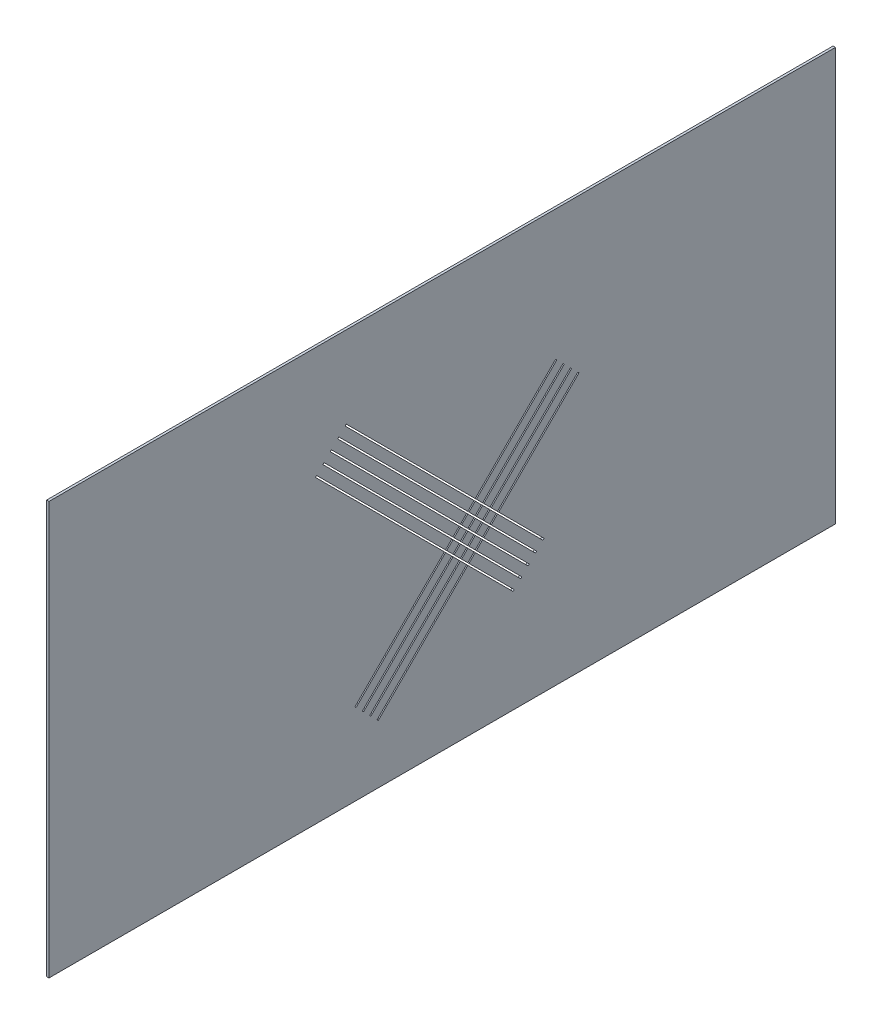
ISO-10303-21;
HEADER;
FILE_DESCRIPTION(('STEP AP214'),'2;1');
FILE_NAME('part.step','',(''),(''),'','','');
FILE_SCHEMA(('AUTOMOTIVE_DESIGN { 1 0 10303 214 1 1 1 1 }'));
ENDSEC;
DATA;
#1=APPLICATION_CONTEXT('core data for automotive mechanical design processes');
#2=APPLICATION_PROTOCOL_DEFINITION('international standard','automotive_design',2000,#1);
#3=PRODUCT_CONTEXT('',#1,'mechanical');
#4=PRODUCT('Part','Part','',(#3));
#5=PRODUCT_RELATED_PRODUCT_CATEGORY('part','',(#4));
#6=PRODUCT_DEFINITION_FORMATION('','',#4);
#7=PRODUCT_DEFINITION_CONTEXT('part definition',#1,'design');
#8=PRODUCT_DEFINITION('design','',#6,#7);
#9=PRODUCT_DEFINITION_SHAPE('','',#8);
#10=(LENGTH_UNIT() NAMED_UNIT(*) SI_UNIT(.MILLI.,.METRE.));
#11=(NAMED_UNIT(*) PLANE_ANGLE_UNIT() SI_UNIT($,.RADIAN.));
#12=(NAMED_UNIT(*) SI_UNIT($,.STERADIAN.) SOLID_ANGLE_UNIT());
#13=UNCERTAINTY_MEASURE_WITH_UNIT(LENGTH_MEASURE(1.E-05),#10,'distance_accuracy_value','');
#14=(GEOMETRIC_REPRESENTATION_CONTEXT(3) GLOBAL_UNCERTAINTY_ASSIGNED_CONTEXT((#13)) GLOBAL_UNIT_ASSIGNED_CONTEXT((#10,
#11,#12)) REPRESENTATION_CONTEXT('',''));
#15=CARTESIAN_POINT('',(0.,0.,0.));
#16=DIRECTION('',(0.,0.,1.));
#17=DIRECTION('',(1.,0.,0.));
#18=AXIS2_PLACEMENT_3D('',#15,#16,#17);
#19=CARTESIAN_POINT('',(3.048,655.929345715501,-1000.85101439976));
#20=DIRECTION('',(0.,-0.707106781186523,-0.707106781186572));
#21=DIRECTION('',(0.,0.707106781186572,-0.707106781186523));
#22=AXIS2_PLACEMENT_3D('',#19,#20,#21);
#23=PLANE('',#22);
#24=DIRECTION('',(0.,-0.707106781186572,0.707106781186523));
#25=VECTOR('',#24,1.);
#26=CARTESIAN_POINT('',(0.,655.929345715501,-1000.85101439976));
#27=LINE('',#26,#25);
#28=CARTESIAN_POINT('',(0.,200.873180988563,-545.794849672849));
#29=VERTEX_POINT('',#28);
#30=CARTESIAN_POINT('',(0.,192.790950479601,-537.712619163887));
#31=VERTEX_POINT('',#30);
#32=EDGE_CURVE('E800',#29,#31,#27,.T.);
#33=ORIENTED_EDGE('',*,*,#32,.F.);
#34=DIRECTION('',(-1.,0.,0.));
#35=VECTOR('',#34,1.);
#36=CARTESIAN_POINT('',(3.048,200.873180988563,-545.794849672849));
#37=LINE('',#36,#35);
#38=CARTESIAN_POINT('',(3.048,200.873180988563,-545.794849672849));
#39=VERTEX_POINT('',#38);
#40=EDGE_CURVE('E13',#39,#29,#37,.T.);
#41=ORIENTED_EDGE('',*,*,#40,.F.);
#42=DIRECTION('',(0.,-0.707106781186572,0.707106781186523));
#43=VECTOR('',#42,1.);
#44=CARTESIAN_POINT('',(3.048,655.929345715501,-1000.85101439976));
#45=LINE('',#44,#43);
#46=CARTESIAN_POINT('',(3.048,192.790950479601,-537.712619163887));
#47=VERTEX_POINT('',#46);
#48=EDGE_CURVE('E793',#39,#47,#45,.T.);
#49=ORIENTED_EDGE('',*,*,#48,.T.);
#50=DIRECTION('',(-1.,0.,0.));
#51=VECTOR('',#50,1.);
#52=CARTESIAN_POINT('',(3.048,192.790950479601,-537.712619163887));
#53=LINE('',#52,#51);
#54=EDGE_CURVE('E775',#47,#31,#53,.T.);
#55=ORIENTED_EDGE('',*,*,#54,.T.);
#56=EDGE_LOOP('',(#33,#41,#49,#55));
#57=FACE_BOUND('',#56,.T.);
#58=ADVANCED_FACE('F737',(#57),#23,.T.);
#59=CARTESIAN_POINT('',(3.048,-190.134164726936,-936.802195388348));
#60=DIRECTION('',(0.,0.707106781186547,-0.707106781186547));
#61=DIRECTION('',(0.,0.707106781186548,0.707106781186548));
#62=AXIS2_PLACEMENT_3D('',#59,#60,#61);
#63=PLANE('',#62);
#64=DIRECTION('',(0.,-0.707106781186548,-0.707106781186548));
#65=VECTOR('',#64,1.);
#66=CARTESIAN_POINT('',(0.,-190.134164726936,-936.802195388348));
#67=LINE('',#66,#65);
#68=CARTESIAN_POINT('',(0.,208.955411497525,-537.712619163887));
#69=VERTEX_POINT('',#68);
#70=EDGE_CURVE('E786',#69,#29,#67,.T.);
#71=ORIENTED_EDGE('',*,*,#70,.F.);
#72=DIRECTION('',(-1.,0.,0.));
#73=VECTOR('',#72,1.);
#74=CARTESIAN_POINT('',(3.048,208.955411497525,-537.712619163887));
#75=LINE('',#74,#73);
#76=CARTESIAN_POINT('',(3.048,208.955411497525,-537.712619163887));
#77=VERTEX_POINT('',#76);
#78=EDGE_CURVE('E745',#77,#69,#75,.T.);
#79=ORIENTED_EDGE('',*,*,#78,.F.);
#80=DIRECTION('',(0.,-0.707106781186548,-0.707106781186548));
#81=VECTOR('',#80,1.);
#82=CARTESIAN_POINT('',(3.048,-190.134164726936,-936.802195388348));
#83=LINE('',#82,#81);
#84=EDGE_CURVE('E784',#77,#39,#83,.T.);
#85=ORIENTED_EDGE('',*,*,#84,.T.);
#86=ORIENTED_EDGE('',*,*,#40,.T.);
#87=EDGE_LOOP('',(#71,#79,#85,#86));
#88=FACE_BOUND('',#87,.T.);
#89=ADVANCED_FACE('F783',(#88),#63,.T.);
#90=CARTESIAN_POINT('',(3.048,664.011576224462,-992.768783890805));
#91=DIRECTION('',(0.,0.707106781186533,0.707106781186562));
#92=DIRECTION('',(0.,-0.707106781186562,0.707106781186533));
#93=AXIS2_PLACEMENT_3D('',#90,#91,#92);
#94=PLANE('',#93);
#95=DIRECTION('',(0.,0.707106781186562,-0.707106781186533));
#96=VECTOR('',#95,1.);
#97=CARTESIAN_POINT('',(0.,664.011576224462,-992.768783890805));
#98=LINE('',#97,#96);
#99=CARTESIAN_POINT('',(0.,200.873180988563,-529.630388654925));
#100=VERTEX_POINT('',#99);
#101=EDGE_CURVE('E804',#100,#69,#98,.T.);
#102=ORIENTED_EDGE('',*,*,#101,.F.);
#103=DIRECTION('',(-1.,0.,0.));
#104=VECTOR('',#103,1.);
#105=CARTESIAN_POINT('',(3.048,200.873180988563,-529.630388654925));
#106=LINE('',#105,#104);
#107=CARTESIAN_POINT('',(3.048,200.873180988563,-529.630388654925));
#108=VERTEX_POINT('',#107);
#109=EDGE_CURVE('E768',#108,#100,#106,.T.);
#110=ORIENTED_EDGE('',*,*,#109,.F.);
#111=DIRECTION('',(0.,0.707106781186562,-0.707106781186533));
#112=VECTOR('',#111,1.);
#113=CARTESIAN_POINT('',(3.048,664.011576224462,-992.768783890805));
#114=LINE('',#113,#112);
#115=EDGE_CURVE('E792',#108,#77,#114,.T.);
#116=ORIENTED_EDGE('',*,*,#115,.T.);
#117=ORIENTED_EDGE('',*,*,#78,.T.);
#118=EDGE_LOOP('',(#102,#110,#116,#117));
#119=FACE_BOUND('',#118,.T.);
#120=ADVANCED_FACE('F795',(#119),#94,.T.);
#121=CARTESIAN_POINT('',(3.048,-198.216395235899,-928.719964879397));
#122=DIRECTION('',(0.,0.707106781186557,-0.707106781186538));
#123=DIRECTION('',(0.,0.707106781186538,0.707106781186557));
#124=AXIS2_PLACEMENT_3D('',#121,#122,#123);
#125=PLANE('',#124);
#126=DIRECTION('',(0.,-0.707106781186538,-0.707106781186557));
#127=VECTOR('',#126,1.);
#128=CARTESIAN_POINT('',(0.,-198.216395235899,-928.719964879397));
#129=LINE('',#128,#127);
#130=EDGE_CURVE('E806',#100,#31,#129,.T.);
#131=ORIENTED_EDGE('',*,*,#130,.T.);
#132=ORIENTED_EDGE('',*,*,#54,.F.);
#133=DIRECTION('',(0.,-0.707106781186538,-0.707106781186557));
#134=VECTOR('',#133,1.);
#135=CARTESIAN_POINT('',(3.048,-198.216395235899,-928.719964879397));
#136=LINE('',#135,#134);
#137=EDGE_CURVE('E753',#108,#47,#136,.T.);
#138=ORIENTED_EDGE('',*,*,#137,.F.);
#139=ORIENTED_EDGE('',*,*,#109,.T.);
#140=EDGE_LOOP('',(#131,#132,#138,#139));
#141=FACE_BOUND('',#140,.T.);
#142=ADVANCED_FACE('F816',(#141),#125,.F.);
#143=CARTESIAN_POINT('',(3.048,264.922,-1391.85836011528));
#144=DIRECTION('',(1.,0.,0.));
#145=DIRECTION('',(0.,0.,-1.));
#146=AXIS2_PLACEMENT_3D('',#143,#144,#145);
#147=PLANE('',#146);
#148=ORIENTED_EDGE('',*,*,#48,.F.);
#149=ORIENTED_EDGE('',*,*,#84,.F.);
#150=ORIENTED_EDGE('',*,*,#115,.F.);
#151=ORIENTED_EDGE('',*,*,#137,.T.);
#152=EDGE_LOOP('',(#148,#149,#150,#151));
#153=FACE_BOUND('',#152,.T.);
#154=ADVANCED_FACE('F791',(#153),#147,.T.);
#155=CARTESIAN_POINT('',(0.,264.922,-1391.85836011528));
#156=DIRECTION('',(1.,0.,0.));
#157=DIRECTION('',(0.,0.,-1.));
#158=AXIS2_PLACEMENT_3D('',#155,#156,#157);
#159=PLANE('',#158);
#160=ORIENTED_EDGE('',*,*,#32,.T.);
#161=ORIENTED_EDGE('',*,*,#130,.F.);
#162=ORIENTED_EDGE('',*,*,#101,.T.);
#163=ORIENTED_EDGE('',*,*,#70,.T.);
#164=EDGE_LOOP('',(#160,#161,#162,#163));
#165=FACE_BOUND('',#164,.T.);
#166=ADVANCED_FACE('F821',(#165),#159,.F.);
#167=CLOSED_SHELL('',(#58,#89,#120,#142,#154,#166));
#168=MANIFOLD_SOLID_BREP('B2',#167);
#169=CARTESIAN_POINT('',(3.048,-198.216395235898,-928.719964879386));
#170=DIRECTION('',(0.,0.707106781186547,-0.707106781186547));
#171=DIRECTION('',(0.,0.707106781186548,0.707106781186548));
#172=AXIS2_PLACEMENT_3D('',#169,#170,#171);
#173=PLANE('',#172);
#174=DIRECTION('',(0.,-0.707106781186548,-0.707106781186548));
#175=VECTOR('',#174,1.);
#176=CARTESIAN_POINT('',(0.,-198.216395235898,-928.719964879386));
#177=LINE('',#176,#175);
#178=CARTESIAN_POINT('',(0.,210.392252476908,-520.11131716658));
#179=VERTEX_POINT('',#178);
#180=CARTESIAN_POINT('',(0.,202.310021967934,-528.193547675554));
#181=VERTEX_POINT('',#180);
#182=EDGE_CURVE('E933',#179,#181,#177,.T.);
#183=ORIENTED_EDGE('',*,*,#182,.T.);
#184=DIRECTION('',(-1.,0.,0.));
#185=VECTOR('',#184,1.);
#186=CARTESIAN_POINT('',(3.048,202.310021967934,-528.193547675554));
#187=LINE('',#186,#185);
#188=CARTESIAN_POINT('',(3.048,202.310021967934,-528.193547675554));
#189=VERTEX_POINT('',#188);
#190=EDGE_CURVE('E735',#189,#181,#187,.T.);
#191=ORIENTED_EDGE('',*,*,#190,.F.);
#192=DIRECTION('',(0.,-0.707106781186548,-0.707106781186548));
#193=VECTOR('',#192,1.);
#194=CARTESIAN_POINT('',(3.048,-198.216395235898,-928.719964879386));
#195=LINE('',#194,#193);
#196=CARTESIAN_POINT('',(3.048,210.392252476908,-520.11131716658));
#197=VERTEX_POINT('',#196);
#198=EDGE_CURVE('E919',#197,#189,#195,.T.);
#199=ORIENTED_EDGE('',*,*,#198,.F.);
#200=DIRECTION('',(-1.,0.,0.));
#201=VECTOR('',#200,1.);
#202=CARTESIAN_POINT('',(3.048,210.392252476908,-520.11131716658));
#203=LINE('',#202,#201);
#204=EDGE_CURVE('E886',#197,#179,#203,.T.);
#205=ORIENTED_EDGE('',*,*,#204,.T.);
#206=EDGE_LOOP('',(#183,#191,#199,#205));
#207=FACE_BOUND('',#206,.T.);
#208=ADVANCED_FACE('F870',(#207),#173,.F.);
#209=CARTESIAN_POINT('',(3.048,665.448417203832,-991.331942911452));
#210=DIRECTION('',(0.,0.707106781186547,0.707106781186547));
#211=DIRECTION('',(0.,-0.707106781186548,0.707106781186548));
#212=AXIS2_PLACEMENT_3D('',#209,#210,#211);
#213=PLANE('',#212);
#214=DIRECTION('',(0.,0.707106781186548,-0.707106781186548));
#215=VECTOR('',#214,1.);
#216=CARTESIAN_POINT('',(0.,665.448417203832,-991.331942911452));
#217=LINE('',#216,#215);
#218=CARTESIAN_POINT('',(0.,210.392252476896,-536.275778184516));
#219=VERTEX_POINT('',#218);
#220=EDGE_CURVE('E924',#181,#219,#217,.T.);
#221=ORIENTED_EDGE('',*,*,#220,.T.);
#222=DIRECTION('',(-1.,0.,0.));
#223=VECTOR('',#222,1.);
#224=CARTESIAN_POINT('',(3.048,210.392252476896,-536.275778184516));
#225=LINE('',#224,#223);
#226=CARTESIAN_POINT('',(3.048,210.392252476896,-536.275778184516));
#227=VERTEX_POINT('',#226);
#228=EDGE_CURVE('E878',#227,#219,#225,.T.);
#229=ORIENTED_EDGE('',*,*,#228,.F.);
#230=DIRECTION('',(0.,0.707106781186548,-0.707106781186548));
#231=VECTOR('',#230,1.);
#232=CARTESIAN_POINT('',(3.048,665.448417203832,-991.331942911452));
#233=LINE('',#232,#231);
#234=EDGE_CURVE('E911',#189,#227,#233,.T.);
#235=ORIENTED_EDGE('',*,*,#234,.F.);
#236=ORIENTED_EDGE('',*,*,#190,.T.);
#237=EDGE_LOOP('',(#221,#229,#235,#236));
#238=FACE_BOUND('',#237,.T.);
#239=ADVANCED_FACE('F923',(#238),#213,.F.);
#240=CARTESIAN_POINT('',(3.048,-190.134164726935,-936.802195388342));
#241=DIRECTION('',(0.,0.707106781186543,-0.707106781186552));
#242=DIRECTION('',(0.,0.707106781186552,0.707106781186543));
#243=AXIS2_PLACEMENT_3D('',#240,#241,#242);
#244=PLANE('',#243);
#245=DIRECTION('',(0.,-0.707106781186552,-0.707106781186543));
#246=VECTOR('',#245,1.);
#247=CARTESIAN_POINT('',(0.,-190.134164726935,-936.802195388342));
#248=LINE('',#247,#246);
#249=CARTESIAN_POINT('',(0.,218.47448298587,-528.193547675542));
#250=VERTEX_POINT('',#249);
#251=EDGE_CURVE('E936',#250,#219,#248,.T.);
#252=ORIENTED_EDGE('',*,*,#251,.F.);
#253=DIRECTION('',(-1.,0.,0.));
#254=VECTOR('',#253,1.);
#255=CARTESIAN_POINT('',(3.048,218.47448298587,-528.193547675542));
#256=LINE('',#255,#254);
#257=CARTESIAN_POINT('',(3.048,218.47448298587,-528.193547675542));
#258=VERTEX_POINT('',#257);
#259=EDGE_CURVE('E900',#258,#250,#256,.T.);
#260=ORIENTED_EDGE('',*,*,#259,.F.);
#261=DIRECTION('',(0.,-0.707106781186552,-0.707106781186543));
#262=VECTOR('',#261,1.);
#263=CARTESIAN_POINT('',(3.048,-190.134164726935,-936.802195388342));
#264=LINE('',#263,#262);
#265=EDGE_CURVE('E918',#258,#227,#264,.T.);
#266=ORIENTED_EDGE('',*,*,#265,.T.);
#267=ORIENTED_EDGE('',*,*,#228,.T.);
#268=EDGE_LOOP('',(#252,#260,#266,#267));
#269=FACE_BOUND('',#268,.T.);
#270=ADVANCED_FACE('F927',(#269),#244,.T.);
#271=CARTESIAN_POINT('',(3.048,673.530647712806,-983.249712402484));
#272=DIRECTION('',(0.,0.707106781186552,0.707106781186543));
#273=DIRECTION('',(0.,-0.707106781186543,0.707106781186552));
#274=AXIS2_PLACEMENT_3D('',#271,#272,#273);
#275=PLANE('',#274);
#276=DIRECTION('',(0.,0.707106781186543,-0.707106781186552));
#277=VECTOR('',#276,1.);
#278=CARTESIAN_POINT('',(0.,673.530647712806,-983.249712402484));
#279=LINE('',#278,#277);
#280=EDGE_CURVE('E938',#179,#250,#279,.T.);
#281=ORIENTED_EDGE('',*,*,#280,.F.);
#282=ORIENTED_EDGE('',*,*,#204,.F.);
#283=DIRECTION('',(0.,0.707106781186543,-0.707106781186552));
#284=VECTOR('',#283,1.);
#285=CARTESIAN_POINT('',(3.048,673.530647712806,-983.249712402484));
#286=LINE('',#285,#284);
#287=EDGE_CURVE('E928',#197,#258,#286,.T.);
#288=ORIENTED_EDGE('',*,*,#287,.T.);
#289=ORIENTED_EDGE('',*,*,#259,.T.);
#290=EDGE_LOOP('',(#281,#282,#288,#289));
#291=FACE_BOUND('',#290,.T.);
#292=ADVANCED_FACE('F944',(#291),#275,.T.);
#293=CARTESIAN_POINT('',(3.048,264.922,-1391.85836011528));
#294=DIRECTION('',(1.,0.,0.));
#295=DIRECTION('',(0.,0.,-1.));
#296=AXIS2_PLACEMENT_3D('',#293,#294,#295);
#297=PLANE('',#296);
#298=ORIENTED_EDGE('',*,*,#198,.T.);
#299=ORIENTED_EDGE('',*,*,#234,.T.);
#300=ORIENTED_EDGE('',*,*,#265,.F.);
#301=ORIENTED_EDGE('',*,*,#287,.F.);
#302=EDGE_LOOP('',(#298,#299,#300,#301));
#303=FACE_BOUND('',#302,.T.);
#304=ADVANCED_FACE('F915',(#303),#297,.T.);
#305=CARTESIAN_POINT('',(0.,264.922,-1391.85836011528));
#306=DIRECTION('',(1.,0.,0.));
#307=DIRECTION('',(0.,0.,-1.));
#308=AXIS2_PLACEMENT_3D('',#305,#306,#307);
#309=PLANE('',#308);
#310=ORIENTED_EDGE('',*,*,#182,.F.);
#311=ORIENTED_EDGE('',*,*,#280,.T.);
#312=ORIENTED_EDGE('',*,*,#251,.T.);
#313=ORIENTED_EDGE('',*,*,#220,.F.);
#314=EDGE_LOOP('',(#310,#311,#312,#313));
#315=FACE_BOUND('',#314,.T.);
#316=ADVANCED_FACE('F943',(#315),#309,.F.);
#317=CLOSED_SHELL('',(#208,#239,#270,#292,#304,#316));
#318=MANIFOLD_SOLID_BREP('B7',#317);
#319=CARTESIAN_POINT('',(3.048,674.967488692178,-981.8128714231));
#320=DIRECTION('',(0.,-0.707106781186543,-0.707106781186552));
#321=DIRECTION('',(0.,0.707106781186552,-0.707106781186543));
#322=AXIS2_PLACEMENT_3D('',#319,#320,#321);
#323=PLANE('',#322);
#324=DIRECTION('',(0.,-0.707106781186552,0.707106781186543));
#325=VECTOR('',#324,1.);
#326=CARTESIAN_POINT('',(0.,674.967488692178,-981.8128714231));
#327=LINE('',#326,#325);
#328=CARTESIAN_POINT('',(0.,219.911323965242,-526.756706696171));
#329=VERTEX_POINT('',#328);
#330=CARTESIAN_POINT('',(0.,211.82315907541,-518.66854180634));
#331=VERTEX_POINT('',#330);
#332=EDGE_CURVE('E1066',#329,#331,#327,.T.);
#333=ORIENTED_EDGE('',*,*,#332,.F.);
#334=DIRECTION('',(-1.,0.,0.));
#335=VECTOR('',#334,1.);
#336=CARTESIAN_POINT('',(3.048,219.911323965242,-526.756706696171));
#337=LINE('',#336,#335);
#338=CARTESIAN_POINT('',(3.048,219.911323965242,-526.756706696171));
#339=VERTEX_POINT('',#338);
#340=EDGE_CURVE('E868',#339,#329,#337,.T.);
#341=ORIENTED_EDGE('',*,*,#340,.F.);
#342=DIRECTION('',(0.,-0.707106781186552,0.707106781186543));
#343=VECTOR('',#342,1.);
#344=CARTESIAN_POINT('',(3.048,674.967488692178,-981.8128714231));
#345=LINE('',#344,#343);
#346=CARTESIAN_POINT('',(3.048,211.82315907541,-518.66854180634));
#347=VERTEX_POINT('',#346);
#348=EDGE_CURVE('E1059',#339,#347,#345,.T.);
#349=ORIENTED_EDGE('',*,*,#348,.T.);
#350=DIRECTION('',(-1.,0.,0.));
#351=VECTOR('',#350,1.);
#352=CARTESIAN_POINT('',(3.048,211.82315907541,-518.66854180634));
#353=LINE('',#352,#351);
#354=EDGE_CURVE('E1041',#347,#331,#353,.T.);
#355=ORIENTED_EDGE('',*,*,#354,.T.);
#356=EDGE_LOOP('',(#333,#341,#349,#355));
#357=FACE_BOUND('',#356,.T.);
#358=ADVANCED_FACE('F1003',(#357),#323,.T.);
#359=CARTESIAN_POINT('',(3.048,-190.134164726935,-936.802195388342));
#360=DIRECTION('',(0.,0.707106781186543,-0.707106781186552));
#361=DIRECTION('',(0.,0.707106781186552,0.707106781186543));
#362=AXIS2_PLACEMENT_3D('',#359,#360,#361);
#363=PLANE('',#362);
#364=DIRECTION('',(0.,-0.707106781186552,-0.707106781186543));
#365=VECTOR('',#364,1.);
#366=CARTESIAN_POINT('',(0.,-190.134164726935,-936.802195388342));
#367=LINE('',#366,#365);
#368=CARTESIAN_POINT('',(0.,227.993554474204,-518.674476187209));
#369=VERTEX_POINT('',#368);
#370=EDGE_CURVE('E1052',#369,#329,#367,.T.);
#371=ORIENTED_EDGE('',*,*,#370,.F.);
#372=DIRECTION('',(-1.,0.,0.));
#373=VECTOR('',#372,1.);
#374=CARTESIAN_POINT('',(3.048,227.993554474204,-518.674476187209));
#375=LINE('',#374,#373);
#376=CARTESIAN_POINT('',(3.048,227.993554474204,-518.674476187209));
#377=VERTEX_POINT('',#376);
#378=EDGE_CURVE('E1011',#377,#369,#375,.T.);
#379=ORIENTED_EDGE('',*,*,#378,.F.);
#380=DIRECTION('',(0.,-0.707106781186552,-0.707106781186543));
#381=VECTOR('',#380,1.);
#382=CARTESIAN_POINT('',(3.048,-190.134164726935,-936.802195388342));
#383=LINE('',#382,#381);
#384=EDGE_CURVE('E1050',#377,#339,#383,.T.);
#385=ORIENTED_EDGE('',*,*,#384,.T.);
#386=ORIENTED_EDGE('',*,*,#340,.T.);
#387=EDGE_LOOP('',(#371,#379,#385,#386));
#388=FACE_BOUND('',#387,.T.);
#389=ADVANCED_FACE('F1049',(#388),#363,.T.);
#390=CARTESIAN_POINT('',(3.048,683.049719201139,-973.73064091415));
#391=DIRECTION('',(0.,0.707106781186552,0.707106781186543));
#392=DIRECTION('',(0.,-0.707106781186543,0.707106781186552));
#393=AXIS2_PLACEMENT_3D('',#390,#391,#392);
#394=PLANE('',#393);
#395=DIRECTION('',(0.,0.707106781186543,-0.707106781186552));
#396=VECTOR('',#395,1.);
#397=CARTESIAN_POINT('',(0.,683.049719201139,-973.73064091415));
#398=LINE('',#397,#396);
#399=CARTESIAN_POINT('',(0.,219.905389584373,-510.586311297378));
#400=VERTEX_POINT('',#399);
#401=EDGE_CURVE('E1070',#400,#369,#398,.T.);
#402=ORIENTED_EDGE('',*,*,#401,.F.);
#403=DIRECTION('',(-1.,0.,0.));
#404=VECTOR('',#403,1.);
#405=CARTESIAN_POINT('',(3.048,219.905389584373,-510.586311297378));
#406=LINE('',#405,#404);
#407=CARTESIAN_POINT('',(3.048,219.905389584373,-510.586311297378));
#408=VERTEX_POINT('',#407);
#409=EDGE_CURVE('E1034',#408,#400,#406,.T.);
#410=ORIENTED_EDGE('',*,*,#409,.F.);
#411=DIRECTION('',(0.,0.707106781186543,-0.707106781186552));
#412=VECTOR('',#411,1.);
#413=CARTESIAN_POINT('',(3.048,683.049719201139,-973.73064091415));
#414=LINE('',#413,#412);
#415=EDGE_CURVE('E1058',#408,#377,#414,.T.);
#416=ORIENTED_EDGE('',*,*,#415,.T.);
#417=ORIENTED_EDGE('',*,*,#378,.T.);
#418=EDGE_LOOP('',(#402,#410,#416,#417));
#419=FACE_BOUND('',#418,.T.);
#420=ADVANCED_FACE('F1061',(#419),#394,.T.);
#421=CARTESIAN_POINT('',(3.048,-198.222329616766,-928.714030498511));
#422=DIRECTION('',(0.,0.707106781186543,-0.707106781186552));
#423=DIRECTION('',(0.,0.707106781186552,0.707106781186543));
#424=AXIS2_PLACEMENT_3D('',#421,#422,#423);
#425=PLANE('',#424);
#426=DIRECTION('',(0.,-0.707106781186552,-0.707106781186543));
#427=VECTOR('',#426,1.);
#428=CARTESIAN_POINT('',(0.,-198.222329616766,-928.714030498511));
#429=LINE('',#428,#427);
#430=EDGE_CURVE('E1072',#400,#331,#429,.T.);
#431=ORIENTED_EDGE('',*,*,#430,.T.);
#432=ORIENTED_EDGE('',*,*,#354,.F.);
#433=DIRECTION('',(0.,-0.707106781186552,-0.707106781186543));
#434=VECTOR('',#433,1.);
#435=CARTESIAN_POINT('',(3.048,-198.222329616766,-928.714030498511));
#436=LINE('',#435,#434);
#437=EDGE_CURVE('E1019',#408,#347,#436,.T.);
#438=ORIENTED_EDGE('',*,*,#437,.F.);
#439=ORIENTED_EDGE('',*,*,#409,.T.);
#440=EDGE_LOOP('',(#431,#432,#438,#439));
#441=FACE_BOUND('',#440,.T.);
#442=ADVANCED_FACE('F1082',(#441),#425,.F.);
#443=CARTESIAN_POINT('',(3.048,264.922,-1391.85836011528));
#444=DIRECTION('',(1.,0.,0.));
#445=DIRECTION('',(0.,0.,-1.));
#446=AXIS2_PLACEMENT_3D('',#443,#444,#445);
#447=PLANE('',#446);
#448=ORIENTED_EDGE('',*,*,#348,.F.);
#449=ORIENTED_EDGE('',*,*,#384,.F.);
#450=ORIENTED_EDGE('',*,*,#415,.F.);
#451=ORIENTED_EDGE('',*,*,#437,.T.);
#452=EDGE_LOOP('',(#448,#449,#450,#451));
#453=FACE_BOUND('',#452,.T.);
#454=ADVANCED_FACE('F1057',(#453),#447,.T.);
#455=CARTESIAN_POINT('',(0.,264.922,-1391.85836011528));
#456=DIRECTION('',(1.,0.,0.));
#457=DIRECTION('',(0.,0.,-1.));
#458=AXIS2_PLACEMENT_3D('',#455,#456,#457);
#459=PLANE('',#458);
#460=ORIENTED_EDGE('',*,*,#332,.T.);
#461=ORIENTED_EDGE('',*,*,#430,.F.);
#462=ORIENTED_EDGE('',*,*,#401,.T.);
#463=ORIENTED_EDGE('',*,*,#370,.T.);
#464=EDGE_LOOP('',(#460,#461,#462,#463));
#465=FACE_BOUND('',#464,.T.);
#466=ADVANCED_FACE('F1087',(#465),#459,.F.);
#467=CLOSED_SHELL('',(#358,#389,#420,#442,#454,#466));
#468=MANIFOLD_SOLID_BREP('B729',#467);
#469=CARTESIAN_POINT('',(3.048,683.049719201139,-973.730640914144));
#470=DIRECTION('',(0.,0.707106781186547,0.707106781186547));
#471=DIRECTION('',(0.,-0.707106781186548,0.707106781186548));
#472=AXIS2_PLACEMENT_3D('',#469,#470,#471);
#473=PLANE('',#472);
#474=DIRECTION('',(0.,0.707106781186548,-0.707106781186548));
#475=VECTOR('',#474,1.);
#476=CARTESIAN_POINT('',(0.,683.049719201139,-973.730640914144));
#477=LINE('',#476,#475);
#478=CARTESIAN_POINT('',(0.,229.430395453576,-520.111317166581));
#479=VERTEX_POINT('',#478);
#480=CARTESIAN_POINT('',(0.,237.512625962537,-528.193547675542));
#481=VERTEX_POINT('',#480);
#482=EDGE_CURVE('E1199',#479,#481,#477,.T.);
#483=ORIENTED_EDGE('',*,*,#482,.F.);
#484=DIRECTION('',(-1.,0.,0.));
#485=VECTOR('',#484,1.);
#486=CARTESIAN_POINT('',(3.048,229.430395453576,-520.111317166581));
#487=LINE('',#486,#485);
#488=CARTESIAN_POINT('',(3.048,229.430395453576,-520.111317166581));
#489=VERTEX_POINT('',#488);
#490=EDGE_CURVE('E1001',#489,#479,#487,.T.);
#491=ORIENTED_EDGE('',*,*,#490,.F.);
#492=DIRECTION('',(0.,0.707106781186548,-0.707106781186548));
#493=VECTOR('',#492,1.);
#494=CARTESIAN_POINT('',(3.048,683.049719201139,-973.730640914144));
#495=LINE('',#494,#493);
#496=CARTESIAN_POINT('',(3.048,237.512625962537,-528.193547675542));
#497=VERTEX_POINT('',#496);
#498=EDGE_CURVE('E1184',#489,#497,#495,.T.);
#499=ORIENTED_EDGE('',*,*,#498,.T.);
#500=DIRECTION('',(-1.,0.,0.));
#501=VECTOR('',#500,1.);
#502=CARTESIAN_POINT('',(3.048,237.512625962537,-528.193547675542));
#503=LINE('',#502,#501);
#504=EDGE_CURVE('E1152',#497,#481,#503,.T.);
#505=ORIENTED_EDGE('',*,*,#504,.T.);
#506=EDGE_LOOP('',(#483,#491,#499,#505));
#507=FACE_BOUND('',#506,.T.);
#508=ADVANCED_FACE('F1136',(#507),#473,.T.);
#509=CARTESIAN_POINT('',(3.048,-188.697323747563,-938.23903636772));
#510=DIRECTION('',(0.,0.707106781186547,-0.707106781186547));
#511=DIRECTION('',(0.,0.707106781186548,0.707106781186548));
#512=AXIS2_PLACEMENT_3D('',#509,#510,#511);
#513=PLANE('',#512);
#514=DIRECTION('',(0.,-0.707106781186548,-0.707106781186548));
#515=VECTOR('',#514,1.);
#516=CARTESIAN_POINT('',(0.,-188.697323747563,-938.23903636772));
#517=LINE('',#516,#515);
#518=CARTESIAN_POINT('',(0.,221.348164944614,-528.193547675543));
#519=VERTEX_POINT('',#518);
#520=EDGE_CURVE('E1190',#479,#519,#517,.T.);
#521=ORIENTED_EDGE('',*,*,#520,.T.);
#522=DIRECTION('',(-1.,0.,0.));
#523=VECTOR('',#522,1.);
#524=CARTESIAN_POINT('',(3.048,221.348164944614,-528.193547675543));
#525=LINE('',#524,#523);
#526=CARTESIAN_POINT('',(3.048,221.348164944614,-528.193547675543));
#527=VERTEX_POINT('',#526);
#528=EDGE_CURVE('E1144',#527,#519,#525,.T.);
#529=ORIENTED_EDGE('',*,*,#528,.F.);
#530=DIRECTION('',(0.,-0.707106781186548,-0.707106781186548));
#531=VECTOR('',#530,1.);
#532=CARTESIAN_POINT('',(3.048,-188.697323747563,-938.23903636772));
#533=LINE('',#532,#531);
#534=EDGE_CURVE('E1178',#489,#527,#533,.T.);
#535=ORIENTED_EDGE('',*,*,#534,.F.);
#536=ORIENTED_EDGE('',*,*,#490,.T.);
#537=EDGE_LOOP('',(#521,#529,#535,#536));
#538=FACE_BOUND('',#537,.T.);
#539=ADVANCED_FACE('F1188',(#538),#513,.F.);
#540=CARTESIAN_POINT('',(3.048,674.967488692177,-981.812871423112));
#541=DIRECTION('',(0.,0.707106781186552,0.707106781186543));
#542=DIRECTION('',(0.,-0.707106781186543,0.707106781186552));
#543=AXIS2_PLACEMENT_3D('',#540,#541,#542);
#544=PLANE('',#543);
#545=DIRECTION('',(0.,0.707106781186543,-0.707106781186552));
#546=VECTOR('',#545,1.);
#547=CARTESIAN_POINT('',(0.,674.967488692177,-981.812871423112));
#548=LINE('',#547,#546);
#549=CARTESIAN_POINT('',(0.,229.430395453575,-536.275778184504));
#550=VERTEX_POINT('',#549);
#551=EDGE_CURVE('E1202',#519,#550,#548,.T.);
#552=ORIENTED_EDGE('',*,*,#551,.T.);
#553=DIRECTION('',(-1.,0.,0.));
#554=VECTOR('',#553,1.);
#555=CARTESIAN_POINT('',(3.048,229.430395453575,-536.275778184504));
#556=LINE('',#555,#554);
#557=CARTESIAN_POINT('',(3.048,229.430395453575,-536.275778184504));
#558=VERTEX_POINT('',#557);
#559=EDGE_CURVE('E1166',#558,#550,#556,.T.);
#560=ORIENTED_EDGE('',*,*,#559,.F.);
#561=DIRECTION('',(0.,0.707106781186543,-0.707106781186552));
#562=VECTOR('',#561,1.);
#563=CARTESIAN_POINT('',(3.048,674.967488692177,-981.812871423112));
#564=LINE('',#563,#562);
#565=EDGE_CURVE('E1183',#527,#558,#564,.T.);
#566=ORIENTED_EDGE('',*,*,#565,.F.);
#567=ORIENTED_EDGE('',*,*,#528,.T.);
#568=EDGE_LOOP('',(#552,#560,#566,#567));
#569=FACE_BOUND('',#568,.T.);
#570=ADVANCED_FACE('F1193',(#569),#544,.F.);
#571=CARTESIAN_POINT('',(3.048,-180.615093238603,-946.321266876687));
#572=DIRECTION('',(0.,0.707106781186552,-0.707106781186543));
#573=DIRECTION('',(0.,0.707106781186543,0.707106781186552));
#574=AXIS2_PLACEMENT_3D('',#571,#572,#573);
#575=PLANE('',#574);
#576=DIRECTION('',(0.,-0.707106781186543,-0.707106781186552));
#577=VECTOR('',#576,1.);
#578=CARTESIAN_POINT('',(0.,-180.615093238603,-946.321266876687));
#579=LINE('',#578,#577);
#580=EDGE_CURVE('E1204',#481,#550,#579,.T.);
#581=ORIENTED_EDGE('',*,*,#580,.F.);
#582=ORIENTED_EDGE('',*,*,#504,.F.);
#583=DIRECTION('',(0.,-0.707106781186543,-0.707106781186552));
#584=VECTOR('',#583,1.);
#585=CARTESIAN_POINT('',(3.048,-180.615093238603,-946.321266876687));
#586=LINE('',#585,#584);
#587=EDGE_CURVE('E1194',#497,#558,#586,.T.);
#588=ORIENTED_EDGE('',*,*,#587,.T.);
#589=ORIENTED_EDGE('',*,*,#559,.T.);
#590=EDGE_LOOP('',(#581,#582,#588,#589));
#591=FACE_BOUND('',#590,.T.);
#592=ADVANCED_FACE('F1209',(#591),#575,.T.);
#593=CARTESIAN_POINT('',(3.048,264.922,-1391.85836011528));
#594=DIRECTION('',(1.,0.,0.));
#595=DIRECTION('',(0.,0.,-1.));
#596=AXIS2_PLACEMENT_3D('',#593,#594,#595);
#597=PLANE('',#596);
#598=ORIENTED_EDGE('',*,*,#498,.F.);
#599=ORIENTED_EDGE('',*,*,#534,.T.);
#600=ORIENTED_EDGE('',*,*,#565,.T.);
#601=ORIENTED_EDGE('',*,*,#587,.F.);
#602=EDGE_LOOP('',(#598,#599,#600,#601));
#603=FACE_BOUND('',#602,.T.);
#604=ADVANCED_FACE('F1180',(#603),#597,.T.);
#605=CARTESIAN_POINT('',(0.,264.922,-1391.85836011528));
#606=DIRECTION('',(1.,0.,0.));
#607=DIRECTION('',(0.,0.,-1.));
#608=AXIS2_PLACEMENT_3D('',#605,#606,#607);
#609=PLANE('',#608);
#610=ORIENTED_EDGE('',*,*,#482,.T.);
#611=ORIENTED_EDGE('',*,*,#580,.T.);
#612=ORIENTED_EDGE('',*,*,#551,.F.);
#613=ORIENTED_EDGE('',*,*,#520,.F.);
#614=EDGE_LOOP('',(#610,#611,#612,#613));
#615=FACE_BOUND('',#614,.T.);
#616=ADVANCED_FACE('F1216',(#615),#609,.F.);
#617=CLOSED_SHELL('',(#508,#539,#570,#592,#604,#616));
#618=MANIFOLD_SOLID_BREP('B862',#617);
#619=CARTESIAN_POINT('',(3.048,-188.697323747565,-938.239036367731));
#620=DIRECTION('',(0.,0.707106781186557,-0.707106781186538));
#621=DIRECTION('',(0.,0.707106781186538,0.707106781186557));
#622=AXIS2_PLACEMENT_3D('',#619,#620,#621);
#623=PLANE('',#622);
#624=DIRECTION('',(0.,-0.707106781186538,-0.707106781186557));
#625=VECTOR('',#624,1.);
#626=CARTESIAN_POINT('',(0.,-188.697323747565,-938.239036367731));
#627=LINE('',#626,#625);
#628=CARTESIAN_POINT('',(0.,219.911323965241,-529.630388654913));
#629=VERTEX_POINT('',#628);
#630=CARTESIAN_POINT('',(0.,211.829093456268,-537.712619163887));
#631=VERTEX_POINT('',#630);
#632=EDGE_CURVE('E1332',#629,#631,#627,.T.);
#633=ORIENTED_EDGE('',*,*,#632,.T.);
#634=DIRECTION('',(-1.,0.,0.));
#635=VECTOR('',#634,1.);
#636=CARTESIAN_POINT('',(3.048,211.829093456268,-537.712619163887));
#637=LINE('',#636,#635);
#638=CARTESIAN_POINT('',(3.048,211.829093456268,-537.712619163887));
#639=VERTEX_POINT('',#638);
#640=EDGE_CURVE('E1134',#639,#631,#637,.T.);
#641=ORIENTED_EDGE('',*,*,#640,.F.);
#642=DIRECTION('',(0.,-0.707106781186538,-0.707106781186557));
#643=VECTOR('',#642,1.);
#644=CARTESIAN_POINT('',(3.048,-188.697323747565,-938.239036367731));
#645=LINE('',#644,#643);
#646=CARTESIAN_POINT('',(3.048,219.911323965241,-529.630388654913));
#647=VERTEX_POINT('',#646);
#648=EDGE_CURVE('E1318',#647,#639,#645,.T.);
#649=ORIENTED_EDGE('',*,*,#648,.F.);
#650=DIRECTION('',(-1.,0.,0.));
#651=VECTOR('',#650,1.);
#652=CARTESIAN_POINT('',(3.048,219.911323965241,-529.630388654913));
#653=LINE('',#652,#651);
#654=EDGE_CURVE('E1285',#647,#629,#653,.T.);
#655=ORIENTED_EDGE('',*,*,#654,.T.);
#656=EDGE_LOOP('',(#633,#641,#649,#655));
#657=FACE_BOUND('',#656,.T.);
#658=ADVANCED_FACE('F1269',(#657),#623,.F.);
#659=CARTESIAN_POINT('',(3.048,665.448417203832,-991.331942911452));
#660=DIRECTION('',(0.,0.707106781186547,0.707106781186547));
#661=DIRECTION('',(0.,-0.707106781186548,0.707106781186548));
#662=AXIS2_PLACEMENT_3D('',#659,#660,#661);
#663=PLANE('',#662);
#664=DIRECTION('',(0.,0.707106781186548,-0.707106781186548));
#665=VECTOR('',#664,1.);
#666=CARTESIAN_POINT('',(0.,665.448417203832,-991.331942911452));
#667=LINE('',#666,#665);
#668=CARTESIAN_POINT('',(0.,219.911323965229,-545.794849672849));
#669=VERTEX_POINT('',#668);
#670=EDGE_CURVE('E1323',#631,#669,#667,.T.);
#671=ORIENTED_EDGE('',*,*,#670,.T.);
#672=DIRECTION('',(-1.,0.,0.));
#673=VECTOR('',#672,1.);
#674=CARTESIAN_POINT('',(3.048,219.911323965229,-545.794849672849));
#675=LINE('',#674,#673);
#676=CARTESIAN_POINT('',(3.048,219.911323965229,-545.794849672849));
#677=VERTEX_POINT('',#676);
#678=EDGE_CURVE('E1277',#677,#669,#675,.T.);
#679=ORIENTED_EDGE('',*,*,#678,.F.);
#680=DIRECTION('',(0.,0.707106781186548,-0.707106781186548));
#681=VECTOR('',#680,1.);
#682=CARTESIAN_POINT('',(3.048,665.448417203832,-991.331942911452));
#683=LINE('',#682,#681);
#684=EDGE_CURVE('E1310',#639,#677,#683,.T.);
#685=ORIENTED_EDGE('',*,*,#684,.F.);
#686=ORIENTED_EDGE('',*,*,#640,.T.);
#687=EDGE_LOOP('',(#671,#679,#685,#686));
#688=FACE_BOUND('',#687,.T.);
#689=ADVANCED_FACE('F1322',(#688),#663,.F.);
#690=CARTESIAN_POINT('',(3.048,-180.615093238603,-946.321266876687));
#691=DIRECTION('',(0.,0.707106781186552,-0.707106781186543));
#692=DIRECTION('',(0.,0.707106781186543,0.707106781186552));
#693=AXIS2_PLACEMENT_3D('',#690,#691,#692);
#694=PLANE('',#693);
#695=DIRECTION('',(0.,-0.707106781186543,-0.707106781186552));
#696=VECTOR('',#695,1.);
#697=CARTESIAN_POINT('',(0.,-180.615093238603,-946.321266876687));
#698=LINE('',#697,#696);
#699=CARTESIAN_POINT('',(0.,227.993554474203,-537.712619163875));
#700=VERTEX_POINT('',#699);
#701=EDGE_CURVE('E1335',#700,#669,#698,.T.);
#702=ORIENTED_EDGE('',*,*,#701,.F.);
#703=DIRECTION('',(-1.,0.,0.));
#704=VECTOR('',#703,1.);
#705=CARTESIAN_POINT('',(3.048,227.993554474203,-537.712619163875));
#706=LINE('',#705,#704);
#707=CARTESIAN_POINT('',(3.048,227.993554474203,-537.712619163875));
#708=VERTEX_POINT('',#707);
#709=EDGE_CURVE('E1299',#708,#700,#706,.T.);
#710=ORIENTED_EDGE('',*,*,#709,.F.);
#711=DIRECTION('',(0.,-0.707106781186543,-0.707106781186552));
#712=VECTOR('',#711,1.);
#713=CARTESIAN_POINT('',(3.048,-180.615093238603,-946.321266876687));
#714=LINE('',#713,#712);
#715=EDGE_CURVE('E1317',#708,#677,#714,.T.);
#716=ORIENTED_EDGE('',*,*,#715,.T.);
#717=ORIENTED_EDGE('',*,*,#678,.T.);
#718=EDGE_LOOP('',(#702,#710,#716,#717));
#719=FACE_BOUND('',#718,.T.);
#720=ADVANCED_FACE('F1326',(#719),#694,.T.);
#721=CARTESIAN_POINT('',(3.048,673.530647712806,-983.249712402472));
#722=DIRECTION('',(0.,0.707106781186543,0.707106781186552));
#723=DIRECTION('',(0.,-0.707106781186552,0.707106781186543));
#724=AXIS2_PLACEMENT_3D('',#721,#722,#723);
#725=PLANE('',#724);
#726=DIRECTION('',(0.,0.707106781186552,-0.707106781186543));
#727=VECTOR('',#726,1.);
#728=CARTESIAN_POINT('',(0.,673.530647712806,-983.249712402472));
#729=LINE('',#728,#727);
#730=EDGE_CURVE('E1337',#629,#700,#729,.T.);
#731=ORIENTED_EDGE('',*,*,#730,.F.);
#732=ORIENTED_EDGE('',*,*,#654,.F.);
#733=DIRECTION('',(0.,0.707106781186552,-0.707106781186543));
#734=VECTOR('',#733,1.);
#735=CARTESIAN_POINT('',(3.048,673.530647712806,-983.249712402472));
#736=LINE('',#735,#734);
#737=EDGE_CURVE('E1327',#647,#708,#736,.T.);
#738=ORIENTED_EDGE('',*,*,#737,.T.);
#739=ORIENTED_EDGE('',*,*,#709,.T.);
#740=EDGE_LOOP('',(#731,#732,#738,#739));
#741=FACE_BOUND('',#740,.T.);
#742=ADVANCED_FACE('F1343',(#741),#725,.T.);
#743=CARTESIAN_POINT('',(3.048,264.922,-1391.85836011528));
#744=DIRECTION('',(1.,0.,0.));
#745=DIRECTION('',(0.,0.,-1.));
#746=AXIS2_PLACEMENT_3D('',#743,#744,#745);
#747=PLANE('',#746);
#748=ORIENTED_EDGE('',*,*,#648,.T.);
#749=ORIENTED_EDGE('',*,*,#684,.T.);
#750=ORIENTED_EDGE('',*,*,#715,.F.);
#751=ORIENTED_EDGE('',*,*,#737,.F.);
#752=EDGE_LOOP('',(#748,#749,#750,#751));
#753=FACE_BOUND('',#752,.T.);
#754=ADVANCED_FACE('F1314',(#753),#747,.T.);
#755=CARTESIAN_POINT('',(0.,264.922,-1391.85836011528));
#756=DIRECTION('',(1.,0.,0.));
#757=DIRECTION('',(0.,0.,-1.));
#758=AXIS2_PLACEMENT_3D('',#755,#756,#757);
#759=PLANE('',#758);
#760=ORIENTED_EDGE('',*,*,#632,.F.);
#761=ORIENTED_EDGE('',*,*,#730,.T.);
#762=ORIENTED_EDGE('',*,*,#701,.T.);
#763=ORIENTED_EDGE('',*,*,#670,.F.);
#764=EDGE_LOOP('',(#760,#761,#762,#763));
#765=FACE_BOUND('',#764,.T.);
#766=ADVANCED_FACE('F1342',(#765),#759,.F.);
#767=CLOSED_SHELL('',(#658,#689,#720,#742,#754,#766));
#768=MANIFOLD_SOLID_BREP('B995',#767);
#769=CARTESIAN_POINT('',(3.048,664.011576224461,-992.768783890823));
#770=DIRECTION('',(0.,0.707106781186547,0.707106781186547));
#771=DIRECTION('',(0.,-0.707106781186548,0.707106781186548));
#772=AXIS2_PLACEMENT_3D('',#769,#770,#771);
#773=PLANE('',#772);
#774=DIRECTION('',(0.,0.707106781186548,-0.707106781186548));
#775=VECTOR('',#774,1.);
#776=CARTESIAN_POINT('',(0.,664.011576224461,-992.768783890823));
#777=LINE('',#776,#775);
#778=CARTESIAN_POINT('',(0.,210.392252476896,-539.149460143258));
#779=VERTEX_POINT('',#778);
#780=CARTESIAN_POINT('',(0.,218.474482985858,-547.23169065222));
#781=VERTEX_POINT('',#780);
#782=EDGE_CURVE('E1465',#779,#781,#777,.T.);
#783=ORIENTED_EDGE('',*,*,#782,.F.);
#784=DIRECTION('',(-1.,0.,0.));
#785=VECTOR('',#784,1.);
#786=CARTESIAN_POINT('',(3.048,210.392252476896,-539.149460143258));
#787=LINE('',#786,#785);
#788=CARTESIAN_POINT('',(3.048,210.392252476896,-539.149460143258));
#789=VERTEX_POINT('',#788);
#790=EDGE_CURVE('E1267',#789,#779,#787,.T.);
#791=ORIENTED_EDGE('',*,*,#790,.F.);
#792=DIRECTION('',(0.,0.707106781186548,-0.707106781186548));
#793=VECTOR('',#792,1.);
#794=CARTESIAN_POINT('',(3.048,664.011576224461,-992.768783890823));
#795=LINE('',#794,#793);
#796=CARTESIAN_POINT('',(3.048,218.474482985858,-547.23169065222));
#797=VERTEX_POINT('',#796);
#798=EDGE_CURVE('E1450',#789,#797,#795,.T.);
#799=ORIENTED_EDGE('',*,*,#798,.T.);
#800=DIRECTION('',(-1.,0.,0.));
#801=VECTOR('',#800,1.);
#802=CARTESIAN_POINT('',(3.048,218.474482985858,-547.23169065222));
#803=LINE('',#802,#801);
#804=EDGE_CURVE('E1418',#797,#781,#803,.T.);
#805=ORIENTED_EDGE('',*,*,#804,.T.);
#806=EDGE_LOOP('',(#783,#791,#799,#805));
#807=FACE_BOUND('',#806,.T.);
#808=ADVANCED_FACE('F1402',(#807),#773,.T.);
#809=CARTESIAN_POINT('',(3.048,-188.697323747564,-938.239036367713));
#810=DIRECTION('',(0.,0.707106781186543,-0.707106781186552));
#811=DIRECTION('',(0.,0.707106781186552,0.707106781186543));
#812=AXIS2_PLACEMENT_3D('',#809,#810,#811);
#813=PLANE('',#812);
#814=DIRECTION('',(0.,-0.707106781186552,-0.707106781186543));
#815=VECTOR('',#814,1.);
#816=CARTESIAN_POINT('',(0.,-188.697323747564,-938.239036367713));
#817=LINE('',#816,#815);
#818=CARTESIAN_POINT('',(0.,202.310021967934,-547.23169065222));
#819=VERTEX_POINT('',#818);
#820=EDGE_CURVE('E1456',#779,#819,#817,.T.);
#821=ORIENTED_EDGE('',*,*,#820,.T.);
#822=DIRECTION('',(-1.,0.,0.));
#823=VECTOR('',#822,1.);
#824=CARTESIAN_POINT('',(3.048,202.310021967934,-547.23169065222));
#825=LINE('',#824,#823);
#826=CARTESIAN_POINT('',(3.048,202.310021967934,-547.23169065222));
#827=VERTEX_POINT('',#826);
#828=EDGE_CURVE('E1410',#827,#819,#825,.T.);
#829=ORIENTED_EDGE('',*,*,#828,.F.);
#830=DIRECTION('',(0.,-0.707106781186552,-0.707106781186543));
#831=VECTOR('',#830,1.);
#832=CARTESIAN_POINT('',(3.048,-188.697323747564,-938.239036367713));
#833=LINE('',#832,#831);
#834=EDGE_CURVE('E1444',#789,#827,#833,.T.);
#835=ORIENTED_EDGE('',*,*,#834,.F.);
#836=ORIENTED_EDGE('',*,*,#790,.T.);
#837=EDGE_LOOP('',(#821,#829,#835,#836));
#838=FACE_BOUND('',#837,.T.);
#839=ADVANCED_FACE('F1454',(#838),#813,.F.);
#840=CARTESIAN_POINT('',(3.048,655.929345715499,-1000.85101439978));
#841=DIRECTION('',(0.,0.707106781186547,0.707106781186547));
#842=DIRECTION('',(0.,-0.707106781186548,0.707106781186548));
#843=AXIS2_PLACEMENT_3D('',#840,#841,#842);
#844=PLANE('',#843);
#845=DIRECTION('',(0.,0.707106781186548,-0.707106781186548));
#846=VECTOR('',#845,1.);
#847=CARTESIAN_POINT('',(0.,655.929345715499,-1000.85101439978));
#848=LINE('',#847,#846);
#849=CARTESIAN_POINT('',(0.,210.392252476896,-555.313921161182));
#850=VERTEX_POINT('',#849);
#851=EDGE_CURVE('E1468',#819,#850,#848,.T.);
#852=ORIENTED_EDGE('',*,*,#851,.T.);
#853=DIRECTION('',(-1.,0.,0.));
#854=VECTOR('',#853,1.);
#855=CARTESIAN_POINT('',(3.048,210.392252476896,-555.313921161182));
#856=LINE('',#855,#854);
#857=CARTESIAN_POINT('',(3.048,210.392252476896,-555.313921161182));
#858=VERTEX_POINT('',#857);
#859=EDGE_CURVE('E1432',#858,#850,#856,.T.);
#860=ORIENTED_EDGE('',*,*,#859,.F.);
#861=DIRECTION('',(0.,0.707106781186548,-0.707106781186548));
#862=VECTOR('',#861,1.);
#863=CARTESIAN_POINT('',(3.048,655.929345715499,-1000.85101439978));
#864=LINE('',#863,#862);
#865=EDGE_CURVE('E1449',#827,#858,#864,.T.);
#866=ORIENTED_EDGE('',*,*,#865,.F.);
#867=ORIENTED_EDGE('',*,*,#828,.T.);
#868=EDGE_LOOP('',(#852,#860,#866,#867));
#869=FACE_BOUND('',#868,.T.);
#870=ADVANCED_FACE('F1459',(#869),#844,.F.);
#871=CARTESIAN_POINT('',(3.048,-180.615093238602,-946.321266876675));
#872=DIRECTION('',(0.,0.707106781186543,-0.707106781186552));
#873=DIRECTION('',(0.,0.707106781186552,0.707106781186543));
#874=AXIS2_PLACEMENT_3D('',#871,#872,#873);
#875=PLANE('',#874);
#876=DIRECTION('',(0.,-0.707106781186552,-0.707106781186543));
#877=VECTOR('',#876,1.);
#878=CARTESIAN_POINT('',(0.,-180.615093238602,-946.321266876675));
#879=LINE('',#878,#877);
#880=EDGE_CURVE('E1470',#781,#850,#879,.T.);
#881=ORIENTED_EDGE('',*,*,#880,.F.);
#882=ORIENTED_EDGE('',*,*,#804,.F.);
#883=DIRECTION('',(0.,-0.707106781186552,-0.707106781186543));
#884=VECTOR('',#883,1.);
#885=CARTESIAN_POINT('',(3.048,-180.615093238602,-946.321266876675));
#886=LINE('',#885,#884);
#887=EDGE_CURVE('E1460',#797,#858,#886,.T.);
#888=ORIENTED_EDGE('',*,*,#887,.T.);
#889=ORIENTED_EDGE('',*,*,#859,.T.);
#890=EDGE_LOOP('',(#881,#882,#888,#889));
#891=FACE_BOUND('',#890,.T.);
#892=ADVANCED_FACE('F1475',(#891),#875,.T.);
#893=CARTESIAN_POINT('',(3.048,264.922,-1391.85836011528));
#894=DIRECTION('',(1.,0.,0.));
#895=DIRECTION('',(0.,0.,-1.));
#896=AXIS2_PLACEMENT_3D('',#893,#894,#895);
#897=PLANE('',#896);
#898=ORIENTED_EDGE('',*,*,#798,.F.);
#899=ORIENTED_EDGE('',*,*,#834,.T.);
#900=ORIENTED_EDGE('',*,*,#865,.T.);
#901=ORIENTED_EDGE('',*,*,#887,.F.);
#902=EDGE_LOOP('',(#898,#899,#900,#901));
#903=FACE_BOUND('',#902,.T.);
#904=ADVANCED_FACE('F1446',(#903),#897,.T.);
#905=CARTESIAN_POINT('',(0.,264.922,-1391.85836011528));
#906=DIRECTION('',(1.,0.,0.));
#907=DIRECTION('',(0.,0.,-1.));
#908=AXIS2_PLACEMENT_3D('',#905,#906,#907);
#909=PLANE('',#908);
#910=ORIENTED_EDGE('',*,*,#782,.T.);
#911=ORIENTED_EDGE('',*,*,#880,.T.);
#912=ORIENTED_EDGE('',*,*,#851,.F.);
#913=ORIENTED_EDGE('',*,*,#820,.F.);
#914=EDGE_LOOP('',(#910,#911,#912,#913));
#915=FACE_BOUND('',#914,.T.);
#916=ADVANCED_FACE('F1482',(#915),#909,.F.);
#917=CLOSED_SHELL('',(#808,#839,#870,#892,#904,#916));
#918=MANIFOLD_SOLID_BREP('B1128',#917);
#919=CARTESIAN_POINT('',(3.048,664.011576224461,-992.768783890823));
#920=DIRECTION('',(0.,0.707106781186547,0.707106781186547));
#921=DIRECTION('',(0.,-0.707106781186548,0.707106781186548));
#922=AXIS2_PLACEMENT_3D('',#919,#920,#921);
#923=PLANE('',#922);
#924=DIRECTION('',(0.,0.707106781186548,-0.707106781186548));
#925=VECTOR('',#924,1.);
#926=CARTESIAN_POINT('',(0.,664.011576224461,-992.768783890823));
#927=LINE('',#926,#925);
#928=CARTESIAN_POINT('',(0.,219.91132396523,-548.668531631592));
#929=VERTEX_POINT('',#928);
#930=CARTESIAN_POINT('',(0.,227.993554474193,-556.750762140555));
#931=VERTEX_POINT('',#930);
#932=EDGE_CURVE('E1598',#929,#931,#927,.T.);
#933=ORIENTED_EDGE('',*,*,#932,.F.);
#934=DIRECTION('',(-1.,0.,0.));
#935=VECTOR('',#934,1.);
#936=CARTESIAN_POINT('',(3.048,219.91132396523,-548.668531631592));
#937=LINE('',#936,#935);
#938=CARTESIAN_POINT('',(3.048,219.91132396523,-548.668531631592));
#939=VERTEX_POINT('',#938);
#940=EDGE_CURVE('E1400',#939,#929,#937,.T.);
#941=ORIENTED_EDGE('',*,*,#940,.F.);
#942=DIRECTION('',(0.,0.707106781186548,-0.707106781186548));
#943=VECTOR('',#942,1.);
#944=CARTESIAN_POINT('',(3.048,664.011576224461,-992.768783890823));
#945=LINE('',#944,#943);
#946=CARTESIAN_POINT('',(3.048,227.993554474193,-556.750762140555));
#947=VERTEX_POINT('',#946);
#948=EDGE_CURVE('E1583',#939,#947,#945,.T.);
#949=ORIENTED_EDGE('',*,*,#948,.T.);
#950=DIRECTION('',(-1.,0.,0.));
#951=VECTOR('',#950,1.);
#952=CARTESIAN_POINT('',(3.048,227.993554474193,-556.750762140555));
#953=LINE('',#952,#951);
#954=EDGE_CURVE('E1551',#947,#931,#953,.T.);
#955=ORIENTED_EDGE('',*,*,#954,.T.);
#956=EDGE_LOOP('',(#933,#941,#949,#955));
#957=FACE_BOUND('',#956,.T.);
#958=ADVANCED_FACE('F1535',(#957),#923,.T.);
#959=CARTESIAN_POINT('',(3.048,-179.178252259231,-947.758107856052));
#960=DIRECTION('',(0.,0.707106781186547,-0.707106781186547));
#961=DIRECTION('',(0.,0.707106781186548,0.707106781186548));
#962=AXIS2_PLACEMENT_3D('',#959,#960,#961);
#963=PLANE('',#962);
#964=DIRECTION('',(0.,-0.707106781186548,-0.707106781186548));
#965=VECTOR('',#964,1.);
#966=CARTESIAN_POINT('',(0.,-179.178252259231,-947.758107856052));
#967=LINE('',#966,#965);
#968=CARTESIAN_POINT('',(0.,211.829093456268,-556.750762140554));
#969=VERTEX_POINT('',#968);
#970=EDGE_CURVE('E1589',#929,#969,#967,.T.);
#971=ORIENTED_EDGE('',*,*,#970,.T.);
#972=DIRECTION('',(-1.,0.,0.));
#973=VECTOR('',#972,1.);
#974=CARTESIAN_POINT('',(3.048,211.829093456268,-556.750762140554));
#975=LINE('',#974,#973);
#976=CARTESIAN_POINT('',(3.048,211.829093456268,-556.750762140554));
#977=VERTEX_POINT('',#976);
#978=EDGE_CURVE('E1543',#977,#969,#975,.T.);
#979=ORIENTED_EDGE('',*,*,#978,.F.);
#980=DIRECTION('',(0.,-0.707106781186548,-0.707106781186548));
#981=VECTOR('',#980,1.);
#982=CARTESIAN_POINT('',(3.048,-179.178252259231,-947.758107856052));
#983=LINE('',#982,#981);
#984=EDGE_CURVE('E1577',#939,#977,#983,.T.);
#985=ORIENTED_EDGE('',*,*,#984,.F.);
#986=ORIENTED_EDGE('',*,*,#940,.T.);
#987=EDGE_LOOP('',(#971,#979,#985,#986));
#988=FACE_BOUND('',#987,.T.);
#989=ADVANCED_FACE('F1587',(#988),#963,.F.);
#990=CARTESIAN_POINT('',(3.048,655.929345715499,-1000.85101439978));
#991=DIRECTION('',(0.,0.707106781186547,0.707106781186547));
#992=DIRECTION('',(0.,-0.707106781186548,0.707106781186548));
#993=AXIS2_PLACEMENT_3D('',#990,#991,#992);
#994=PLANE('',#993);
#995=DIRECTION('',(0.,0.707106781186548,-0.707106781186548));
#996=VECTOR('',#995,1.);
#997=CARTESIAN_POINT('',(0.,655.929345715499,-1000.85101439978));
#998=LINE('',#997,#996);
#999=CARTESIAN_POINT('',(0.,219.911323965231,-564.832992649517));
#1000=VERTEX_POINT('',#999);
#1001=EDGE_CURVE('E1601',#969,#1000,#998,.T.);
#1002=ORIENTED_EDGE('',*,*,#1001,.T.);
#1003=DIRECTION('',(-1.,0.,0.));
#1004=VECTOR('',#1003,1.);
#1005=CARTESIAN_POINT('',(3.048,219.911323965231,-564.832992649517));
#1006=LINE('',#1005,#1004);
#1007=CARTESIAN_POINT('',(3.048,219.911323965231,-564.832992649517));
#1008=VERTEX_POINT('',#1007);
#1009=EDGE_CURVE('E1565',#1008,#1000,#1006,.T.);
#1010=ORIENTED_EDGE('',*,*,#1009,.F.);
#1011=DIRECTION('',(0.,0.707106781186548,-0.707106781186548));
#1012=VECTOR('',#1011,1.);
#1013=CARTESIAN_POINT('',(3.048,655.929345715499,-1000.85101439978));
#1014=LINE('',#1013,#1012);
#1015=EDGE_CURVE('E1582',#977,#1008,#1014,.T.);
#1016=ORIENTED_EDGE('',*,*,#1015,.F.);
#1017=ORIENTED_EDGE('',*,*,#978,.T.);
#1018=EDGE_LOOP('',(#1002,#1010,#1016,#1017));
#1019=FACE_BOUND('',#1018,.T.);
#1020=ADVANCED_FACE('F1592',(#1019),#994,.F.);
#1021=CARTESIAN_POINT('',(3.048,-171.096021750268,-955.840338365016));
#1022=DIRECTION('',(0.,0.707106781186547,-0.707106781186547));
#1023=DIRECTION('',(0.,0.707106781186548,0.707106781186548));
#1024=AXIS2_PLACEMENT_3D('',#1021,#1022,#1023);
#1025=PLANE('',#1024);
#1026=DIRECTION('',(0.,-0.707106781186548,-0.707106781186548));
#1027=VECTOR('',#1026,1.);
#1028=CARTESIAN_POINT('',(0.,-171.096021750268,-955.840338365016));
#1029=LINE('',#1028,#1027);
#1030=EDGE_CURVE('E1603',#931,#1000,#1029,.T.);
#1031=ORIENTED_EDGE('',*,*,#1030,.F.);
#1032=ORIENTED_EDGE('',*,*,#954,.F.);
#1033=DIRECTION('',(0.,-0.707106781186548,-0.707106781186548));
#1034=VECTOR('',#1033,1.);
#1035=CARTESIAN_POINT('',(3.048,-171.096021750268,-955.840338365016));
#1036=LINE('',#1035,#1034);
#1037=EDGE_CURVE('E1593',#947,#1008,#1036,.T.);
#1038=ORIENTED_EDGE('',*,*,#1037,.T.);
#1039=ORIENTED_EDGE('',*,*,#1009,.T.);
#1040=EDGE_LOOP('',(#1031,#1032,#1038,#1039));
#1041=FACE_BOUND('',#1040,.T.);
#1042=ADVANCED_FACE('F1608',(#1041),#1025,.T.);
#1043=CARTESIAN_POINT('',(3.048,264.922,-1391.85836011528));
#1044=DIRECTION('',(1.,0.,0.));
#1045=DIRECTION('',(0.,0.,-1.));
#1046=AXIS2_PLACEMENT_3D('',#1043,#1044,#1045);
#1047=PLANE('',#1046);
#1048=ORIENTED_EDGE('',*,*,#948,.F.);
#1049=ORIENTED_EDGE('',*,*,#984,.T.);
#1050=ORIENTED_EDGE('',*,*,#1015,.T.);
#1051=ORIENTED_EDGE('',*,*,#1037,.F.);
#1052=EDGE_LOOP('',(#1048,#1049,#1050,#1051));
#1053=FACE_BOUND('',#1052,.T.);
#1054=ADVANCED_FACE('F1579',(#1053),#1047,.T.);
#1055=CARTESIAN_POINT('',(0.,264.922,-1391.85836011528));
#1056=DIRECTION('',(1.,0.,0.));
#1057=DIRECTION('',(0.,0.,-1.));
#1058=AXIS2_PLACEMENT_3D('',#1055,#1056,#1057);
#1059=PLANE('',#1058);
#1060=ORIENTED_EDGE('',*,*,#932,.T.);
#1061=ORIENTED_EDGE('',*,*,#1030,.T.);
#1062=ORIENTED_EDGE('',*,*,#1001,.F.);
#1063=ORIENTED_EDGE('',*,*,#970,.F.);
#1064=EDGE_LOOP('',(#1060,#1061,#1062,#1063));
#1065=FACE_BOUND('',#1064,.T.);
#1066=ADVANCED_FACE('F1615',(#1065),#1059,.F.);
#1067=CLOSED_SHELL('',(#958,#989,#1020,#1042,#1054,#1066));
#1068=MANIFOLD_SOLID_BREP('B1261',#1067);
#1069=CARTESIAN_POINT('',(3.048,673.530647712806,-983.249712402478));
#1070=DIRECTION('',(0.,0.707106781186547,0.707106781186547));
#1071=DIRECTION('',(0.,-0.707106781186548,0.707106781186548));
#1072=AXIS2_PLACEMENT_3D('',#1069,#1070,#1071);
#1073=PLANE('',#1072);
#1074=DIRECTION('',(0.,0.707106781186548,-0.707106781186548));
#1075=VECTOR('',#1074,1.);
#1076=CARTESIAN_POINT('',(0.,673.530647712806,-983.249712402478));
#1077=LINE('',#1076,#1075);
#1078=CARTESIAN_POINT('',(0.,229.430395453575,-539.149460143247));
#1079=VERTEX_POINT('',#1078);
#1080=CARTESIAN_POINT('',(0.,237.512625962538,-547.23169065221));
#1081=VERTEX_POINT('',#1080);
#1082=EDGE_CURVE('E1731',#1079,#1081,#1077,.T.);
#1083=ORIENTED_EDGE('',*,*,#1082,.F.);
#1084=DIRECTION('',(-1.,0.,0.));
#1085=VECTOR('',#1084,1.);
#1086=CARTESIAN_POINT('',(3.048,229.430395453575,-539.149460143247));
#1087=LINE('',#1086,#1085);
#1088=CARTESIAN_POINT('',(3.048,229.430395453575,-539.149460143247));
#1089=VERTEX_POINT('',#1088);
#1090=EDGE_CURVE('E1533',#1089,#1079,#1087,.T.);
#1091=ORIENTED_EDGE('',*,*,#1090,.F.);
#1092=DIRECTION('',(0.,0.707106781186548,-0.707106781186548));
#1093=VECTOR('',#1092,1.);
#1094=CARTESIAN_POINT('',(3.048,673.530647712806,-983.249712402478));
#1095=LINE('',#1094,#1093);
#1096=CARTESIAN_POINT('',(3.048,237.512625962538,-547.23169065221));
#1097=VERTEX_POINT('',#1096);
#1098=EDGE_CURVE('E1716',#1089,#1097,#1095,.T.);
#1099=ORIENTED_EDGE('',*,*,#1098,.T.);
#1100=DIRECTION('',(-1.,0.,0.));
#1101=VECTOR('',#1100,1.);
#1102=CARTESIAN_POINT('',(3.048,237.512625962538,-547.23169065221));
#1103=LINE('',#1102,#1101);
#1104=EDGE_CURVE('E1684',#1097,#1081,#1103,.T.);
#1105=ORIENTED_EDGE('',*,*,#1104,.T.);
#1106=EDGE_LOOP('',(#1083,#1091,#1099,#1105));
#1107=FACE_BOUND('',#1106,.T.);
#1108=ADVANCED_FACE('F1668',(#1107),#1073,.T.);
#1109=CARTESIAN_POINT('',(3.048,-179.178252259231,-947.758107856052));
#1110=DIRECTION('',(0.,0.707106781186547,-0.707106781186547));
#1111=DIRECTION('',(0.,0.707106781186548,0.707106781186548));
#1112=AXIS2_PLACEMENT_3D('',#1109,#1110,#1111);
#1113=PLANE('',#1112);
#1114=DIRECTION('',(0.,-0.707106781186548,-0.707106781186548));
#1115=VECTOR('',#1114,1.);
#1116=CARTESIAN_POINT('',(0.,-179.178252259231,-947.758107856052));
#1117=LINE('',#1116,#1115);
#1118=CARTESIAN_POINT('',(0.,221.348164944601,-547.23169065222));
#1119=VERTEX_POINT('',#1118);
#1120=EDGE_CURVE('E1722',#1079,#1119,#1117,.T.);
#1121=ORIENTED_EDGE('',*,*,#1120,.T.);
#1122=DIRECTION('',(-1.,0.,0.));
#1123=VECTOR('',#1122,1.);
#1124=CARTESIAN_POINT('',(3.048,221.348164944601,-547.23169065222));
#1125=LINE('',#1124,#1123);
#1126=CARTESIAN_POINT('',(3.048,221.348164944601,-547.23169065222));
#1127=VERTEX_POINT('',#1126);
#1128=EDGE_CURVE('E1676',#1127,#1119,#1125,.T.);
#1129=ORIENTED_EDGE('',*,*,#1128,.F.);
#1130=DIRECTION('',(0.,-0.707106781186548,-0.707106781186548));
#1131=VECTOR('',#1130,1.);
#1132=CARTESIAN_POINT('',(3.048,-179.178252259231,-947.758107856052));
#1133=LINE('',#1132,#1131);
#1134=EDGE_CURVE('E1710',#1089,#1127,#1133,.T.);
#1135=ORIENTED_EDGE('',*,*,#1134,.F.);
#1136=ORIENTED_EDGE('',*,*,#1090,.T.);
#1137=EDGE_LOOP('',(#1121,#1129,#1135,#1136));
#1138=FACE_BOUND('',#1137,.T.);
#1139=ADVANCED_FACE('F1720',(#1138),#1113,.F.);
#1140=CARTESIAN_POINT('',(3.048,665.448417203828,-991.331942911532));
#1141=DIRECTION('',(0.,0.707106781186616,0.70710678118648));
#1142=DIRECTION('',(0.,-0.70710678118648,0.707106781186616));
#1143=AXIS2_PLACEMENT_3D('',#1140,#1141,#1142);
#1144=PLANE('',#1143);
#1145=DIRECTION('',(0.,0.70710678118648,-0.707106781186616));
#1146=VECTOR('',#1145,1.);
#1147=CARTESIAN_POINT('',(0.,665.448417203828,-991.331942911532));
#1148=LINE('',#1147,#1146);
#1149=CARTESIAN_POINT('',(0.,229.430395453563,-555.313921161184));
#1150=VERTEX_POINT('',#1149);
#1151=EDGE_CURVE('E1734',#1119,#1150,#1148,.T.);
#1152=ORIENTED_EDGE('',*,*,#1151,.T.);
#1153=DIRECTION('',(-1.,0.,0.));
#1154=VECTOR('',#1153,1.);
#1155=CARTESIAN_POINT('',(3.048,229.430395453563,-555.313921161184));
#1156=LINE('',#1155,#1154);
#1157=CARTESIAN_POINT('',(3.048,229.430395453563,-555.313921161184));
#1158=VERTEX_POINT('',#1157);
#1159=EDGE_CURVE('E1698',#1158,#1150,#1156,.T.);
#1160=ORIENTED_EDGE('',*,*,#1159,.F.);
#1161=DIRECTION('',(0.,0.70710678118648,-0.707106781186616));
#1162=VECTOR('',#1161,1.);
#1163=CARTESIAN_POINT('',(3.048,665.448417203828,-991.331942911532));
#1164=LINE('',#1163,#1162);
#1165=EDGE_CURVE('E1715',#1127,#1158,#1164,.T.);
#1166=ORIENTED_EDGE('',*,*,#1165,.F.);
#1167=ORIENTED_EDGE('',*,*,#1128,.T.);
#1168=EDGE_LOOP('',(#1152,#1160,#1166,#1167));
#1169=FACE_BOUND('',#1168,.T.);
#1170=ADVANCED_FACE('F1725',(#1169),#1144,.F.);
#1171=CARTESIAN_POINT('',(3.048,-171.096021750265,-955.840338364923));
#1172=DIRECTION('',(0.,0.70710678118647,-0.707106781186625));
#1173=DIRECTION('',(0.,0.707106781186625,0.70710678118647));
#1174=AXIS2_PLACEMENT_3D('',#1171,#1172,#1173);
#1175=PLANE('',#1174);
#1176=DIRECTION('',(0.,-0.707106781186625,-0.70710678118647));
#1177=VECTOR('',#1176,1.);
#1178=CARTESIAN_POINT('',(0.,-171.096021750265,-955.840338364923));
#1179=LINE('',#1178,#1177);
#1180=EDGE_CURVE('E1736',#1081,#1150,#1179,.T.);
#1181=ORIENTED_EDGE('',*,*,#1180,.F.);
#1182=ORIENTED_EDGE('',*,*,#1104,.F.);
#1183=DIRECTION('',(0.,-0.707106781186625,-0.70710678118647));
#1184=VECTOR('',#1183,1.);
#1185=CARTESIAN_POINT('',(3.048,-171.096021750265,-955.840338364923));
#1186=LINE('',#1185,#1184);
#1187=EDGE_CURVE('E1726',#1097,#1158,#1186,.T.);
#1188=ORIENTED_EDGE('',*,*,#1187,.T.);
#1189=ORIENTED_EDGE('',*,*,#1159,.T.);
#1190=EDGE_LOOP('',(#1181,#1182,#1188,#1189));
#1191=FACE_BOUND('',#1190,.T.);
#1192=ADVANCED_FACE('F1741',(#1191),#1175,.T.);
#1193=CARTESIAN_POINT('',(3.048,264.922,-1391.85836011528));
#1194=DIRECTION('',(1.,0.,0.));
#1195=DIRECTION('',(0.,0.,-1.));
#1196=AXIS2_PLACEMENT_3D('',#1193,#1194,#1195);
#1197=PLANE('',#1196);
#1198=ORIENTED_EDGE('',*,*,#1098,.F.);
#1199=ORIENTED_EDGE('',*,*,#1134,.T.);
#1200=ORIENTED_EDGE('',*,*,#1165,.T.);
#1201=ORIENTED_EDGE('',*,*,#1187,.F.);
#1202=EDGE_LOOP('',(#1198,#1199,#1200,#1201));
#1203=FACE_BOUND('',#1202,.T.);
#1204=ADVANCED_FACE('F1712',(#1203),#1197,.T.);
#1205=CARTESIAN_POINT('',(0.,264.922,-1391.85836011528));
#1206=DIRECTION('',(1.,0.,0.));
#1207=DIRECTION('',(0.,0.,-1.));
#1208=AXIS2_PLACEMENT_3D('',#1205,#1206,#1207);
#1209=PLANE('',#1208);
#1210=ORIENTED_EDGE('',*,*,#1082,.T.);
#1211=ORIENTED_EDGE('',*,*,#1180,.T.);
#1212=ORIENTED_EDGE('',*,*,#1151,.F.);
#1213=ORIENTED_EDGE('',*,*,#1120,.F.);
#1214=EDGE_LOOP('',(#1210,#1211,#1212,#1213));
#1215=FACE_BOUND('',#1214,.T.);
#1216=ADVANCED_FACE('F1748',(#1215),#1209,.F.);
#1217=CLOSED_SHELL('',(#1108,#1139,#1170,#1192,#1204,#1216));
#1218=MANIFOLD_SOLID_BREP('B1394',#1217);
#1219=CARTESIAN_POINT('',(3.048,683.049719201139,-973.730640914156));
#1220=DIRECTION('',(0.,0.707106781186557,0.707106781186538));
#1221=DIRECTION('',(0.,-0.707106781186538,0.707106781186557));
#1222=AXIS2_PLACEMENT_3D('',#1219,#1220,#1221);
#1223=PLANE('',#1222);
#1224=DIRECTION('',(0.,0.707106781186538,-0.707106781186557));
#1225=VECTOR('',#1224,1.);
#1226=CARTESIAN_POINT('',(0.,683.049719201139,-973.730640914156));
#1227=LINE('',#1226,#1225);
#1228=CARTESIAN_POINT('',(0.,238.949466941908,-529.630388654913));
#1229=VERTEX_POINT('',#1228);
#1230=CARTESIAN_POINT('',(0.,247.031697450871,-537.712619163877));
#1231=VERTEX_POINT('',#1230);
#1232=EDGE_CURVE('E1864',#1229,#1231,#1227,.T.);
#1233=ORIENTED_EDGE('',*,*,#1232,.F.);
#1234=DIRECTION('',(-1.,0.,0.));
#1235=VECTOR('',#1234,1.);
#1236=CARTESIAN_POINT('',(3.048,238.949466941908,-529.630388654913));
#1237=LINE('',#1236,#1235);
#1238=CARTESIAN_POINT('',(3.048,238.949466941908,-529.630388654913));
#1239=VERTEX_POINT('',#1238);
#1240=EDGE_CURVE('E1666',#1239,#1229,#1237,.T.);
#1241=ORIENTED_EDGE('',*,*,#1240,.F.);
#1242=DIRECTION('',(0.,0.707106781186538,-0.707106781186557));
#1243=VECTOR('',#1242,1.);
#1244=CARTESIAN_POINT('',(3.048,683.049719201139,-973.730640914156));
#1245=LINE('',#1244,#1243);
#1246=CARTESIAN_POINT('',(3.048,247.031697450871,-537.712619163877));
#1247=VERTEX_POINT('',#1246);
#1248=EDGE_CURVE('E1849',#1239,#1247,#1245,.T.);
#1249=ORIENTED_EDGE('',*,*,#1248,.T.);
#1250=DIRECTION('',(-1.,0.,0.));
#1251=VECTOR('',#1250,1.);
#1252=CARTESIAN_POINT('',(3.048,247.031697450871,-537.712619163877));
#1253=LINE('',#1252,#1251);
#1254=EDGE_CURVE('E1817',#1247,#1231,#1253,.T.);
#1255=ORIENTED_EDGE('',*,*,#1254,.T.);
#1256=EDGE_LOOP('',(#1233,#1241,#1249,#1255));
#1257=FACE_BOUND('',#1256,.T.);
#1258=ADVANCED_FACE('F1801',(#1257),#1223,.T.);
#1259=CARTESIAN_POINT('',(3.048,-179.178252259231,-947.758107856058));
#1260=DIRECTION('',(0.,0.707106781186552,-0.707106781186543));
#1261=DIRECTION('',(0.,0.707106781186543,0.707106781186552));
#1262=AXIS2_PLACEMENT_3D('',#1259,#1260,#1261);
#1263=PLANE('',#1262);
#1264=DIRECTION('',(0.,-0.707106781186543,-0.707106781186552));
#1265=VECTOR('',#1264,1.);
#1266=CARTESIAN_POINT('',(0.,-179.178252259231,-947.758107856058));
#1267=LINE('',#1266,#1265);
#1268=CARTESIAN_POINT('',(0.,230.867236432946,-537.712619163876));
#1269=VERTEX_POINT('',#1268);
#1270=EDGE_CURVE('E1855',#1229,#1269,#1267,.T.);
#1271=ORIENTED_EDGE('',*,*,#1270,.T.);
#1272=DIRECTION('',(-1.,0.,0.));
#1273=VECTOR('',#1272,1.);
#1274=CARTESIAN_POINT('',(3.048,230.867236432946,-537.712619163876));
#1275=LINE('',#1274,#1273);
#1276=CARTESIAN_POINT('',(3.048,230.867236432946,-537.712619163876));
#1277=VERTEX_POINT('',#1276);
#1278=EDGE_CURVE('E1809',#1277,#1269,#1275,.T.);
#1279=ORIENTED_EDGE('',*,*,#1278,.F.);
#1280=DIRECTION('',(0.,-0.707106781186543,-0.707106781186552));
#1281=VECTOR('',#1280,1.);
#1282=CARTESIAN_POINT('',(3.048,-179.178252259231,-947.758107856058));
#1283=LINE('',#1282,#1281);
#1284=EDGE_CURVE('E1843',#1239,#1277,#1283,.T.);
#1285=ORIENTED_EDGE('',*,*,#1284,.F.);
#1286=ORIENTED_EDGE('',*,*,#1240,.T.);
#1287=EDGE_LOOP('',(#1271,#1279,#1285,#1286));
#1288=FACE_BOUND('',#1287,.T.);
#1289=ADVANCED_FACE('F1853',(#1288),#1263,.F.);
#1290=CARTESIAN_POINT('',(3.048,674.967488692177,-981.812871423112));
#1291=DIRECTION('',(0.,0.707106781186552,0.707106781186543));
#1292=DIRECTION('',(0.,-0.707106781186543,0.707106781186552));
#1293=AXIS2_PLACEMENT_3D('',#1290,#1291,#1292);
#1294=PLANE('',#1293);
#1295=DIRECTION('',(0.,0.707106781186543,-0.707106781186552));
#1296=VECTOR('',#1295,1.);
#1297=CARTESIAN_POINT('',(0.,674.967488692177,-981.812871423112));
#1298=LINE('',#1297,#1296);
#1299=CARTESIAN_POINT('',(0.,238.949466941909,-545.794849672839));
#1300=VERTEX_POINT('',#1299);
#1301=EDGE_CURVE('E1867',#1269,#1300,#1298,.T.);
#1302=ORIENTED_EDGE('',*,*,#1301,.T.);
#1303=DIRECTION('',(-1.,0.,0.));
#1304=VECTOR('',#1303,1.);
#1305=CARTESIAN_POINT('',(3.048,238.949466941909,-545.794849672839));
#1306=LINE('',#1305,#1304);
#1307=CARTESIAN_POINT('',(3.048,238.949466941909,-545.794849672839));
#1308=VERTEX_POINT('',#1307);
#1309=EDGE_CURVE('E1831',#1308,#1300,#1306,.T.);
#1310=ORIENTED_EDGE('',*,*,#1309,.F.);
#1311=DIRECTION('',(0.,0.707106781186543,-0.707106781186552));
#1312=VECTOR('',#1311,1.);
#1313=CARTESIAN_POINT('',(3.048,674.967488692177,-981.812871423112));
#1314=LINE('',#1313,#1312);
#1315=EDGE_CURVE('E1848',#1277,#1308,#1314,.T.);
#1316=ORIENTED_EDGE('',*,*,#1315,.F.);
#1317=ORIENTED_EDGE('',*,*,#1278,.T.);
#1318=EDGE_LOOP('',(#1302,#1310,#1316,#1317));
#1319=FACE_BOUND('',#1318,.T.);
#1320=ADVANCED_FACE('F1858',(#1319),#1294,.F.);
#1321=CARTESIAN_POINT('',(3.048,-171.096021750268,-955.840338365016));
#1322=DIRECTION('',(0.,0.707106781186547,-0.707106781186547));
#1323=DIRECTION('',(0.,0.707106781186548,0.707106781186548));
#1324=AXIS2_PLACEMENT_3D('',#1321,#1322,#1323);
#1325=PLANE('',#1324);
#1326=DIRECTION('',(0.,-0.707106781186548,-0.707106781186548));
#1327=VECTOR('',#1326,1.);
#1328=CARTESIAN_POINT('',(0.,-171.096021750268,-955.840338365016));
#1329=LINE('',#1328,#1327);
#1330=EDGE_CURVE('E1869',#1231,#1300,#1329,.T.);
#1331=ORIENTED_EDGE('',*,*,#1330,.F.);
#1332=ORIENTED_EDGE('',*,*,#1254,.F.);
#1333=DIRECTION('',(0.,-0.707106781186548,-0.707106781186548));
#1334=VECTOR('',#1333,1.);
#1335=CARTESIAN_POINT('',(3.048,-171.096021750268,-955.840338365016));
#1336=LINE('',#1335,#1334);
#1337=EDGE_CURVE('E1859',#1247,#1308,#1336,.T.);
#1338=ORIENTED_EDGE('',*,*,#1337,.T.);
#1339=ORIENTED_EDGE('',*,*,#1309,.T.);
#1340=EDGE_LOOP('',(#1331,#1332,#1338,#1339));
#1341=FACE_BOUND('',#1340,.T.);
#1342=ADVANCED_FACE('F1874',(#1341),#1325,.T.);
#1343=CARTESIAN_POINT('',(3.048,264.922,-1391.85836011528));
#1344=DIRECTION('',(1.,0.,0.));
#1345=DIRECTION('',(0.,0.,-1.));
#1346=AXIS2_PLACEMENT_3D('',#1343,#1344,#1345);
#1347=PLANE('',#1346);
#1348=ORIENTED_EDGE('',*,*,#1248,.F.);
#1349=ORIENTED_EDGE('',*,*,#1284,.T.);
#1350=ORIENTED_EDGE('',*,*,#1315,.T.);
#1351=ORIENTED_EDGE('',*,*,#1337,.F.);
#1352=EDGE_LOOP('',(#1348,#1349,#1350,#1351));
#1353=FACE_BOUND('',#1352,.T.);
#1354=ADVANCED_FACE('F1845',(#1353),#1347,.T.);
#1355=CARTESIAN_POINT('',(0.,264.922,-1391.85836011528));
#1356=DIRECTION('',(1.,0.,0.));
#1357=DIRECTION('',(0.,0.,-1.));
#1358=AXIS2_PLACEMENT_3D('',#1355,#1356,#1357);
#1359=PLANE('',#1358);
#1360=ORIENTED_EDGE('',*,*,#1232,.T.);
#1361=ORIENTED_EDGE('',*,*,#1330,.T.);
#1362=ORIENTED_EDGE('',*,*,#1301,.F.);
#1363=ORIENTED_EDGE('',*,*,#1270,.F.);
#1364=EDGE_LOOP('',(#1360,#1361,#1362,#1363));
#1365=FACE_BOUND('',#1364,.T.);
#1366=ADVANCED_FACE('F1881',(#1365),#1359,.F.);
#1367=CLOSED_SHELL('',(#1258,#1289,#1320,#1342,#1354,#1366));
#1368=MANIFOLD_SOLID_BREP('B1527',#1367);
#1369=CARTESIAN_POINT('',(3.048,683.049719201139,-973.730640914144));
#1370=DIRECTION('',(0.,0.707106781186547,0.707106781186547));
#1371=DIRECTION('',(0.,-0.707106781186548,0.707106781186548));
#1372=AXIS2_PLACEMENT_3D('',#1369,#1370,#1371);
#1373=PLANE('',#1372);
#1374=DIRECTION('',(0.,0.707106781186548,-0.707106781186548));
#1375=VECTOR('',#1374,1.);
#1376=CARTESIAN_POINT('',(0.,683.049719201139,-973.730640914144));
#1377=LINE('',#1376,#1375);
#1378=CARTESIAN_POINT('',(0.,248.468538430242,-539.149460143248));
#1379=VERTEX_POINT('',#1378);
#1380=CARTESIAN_POINT('',(0.,256.550768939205,-547.23169065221));
#1381=VERTEX_POINT('',#1380);
#1382=EDGE_CURVE('E1997',#1379,#1381,#1377,.T.);
#1383=ORIENTED_EDGE('',*,*,#1382,.F.);
#1384=DIRECTION('',(-1.,0.,0.));
#1385=VECTOR('',#1384,1.);
#1386=CARTESIAN_POINT('',(3.048,248.468538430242,-539.149460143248));
#1387=LINE('',#1386,#1385);
#1388=CARTESIAN_POINT('',(3.048,248.468538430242,-539.149460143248));
#1389=VERTEX_POINT('',#1388);
#1390=EDGE_CURVE('E1799',#1389,#1379,#1387,.T.);
#1391=ORIENTED_EDGE('',*,*,#1390,.F.);
#1392=DIRECTION('',(0.,0.707106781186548,-0.707106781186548));
#1393=VECTOR('',#1392,1.);
#1394=CARTESIAN_POINT('',(3.048,683.049719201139,-973.730640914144));
#1395=LINE('',#1394,#1393);
#1396=CARTESIAN_POINT('',(3.048,256.550768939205,-547.23169065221));
#1397=VERTEX_POINT('',#1396);
#1398=EDGE_CURVE('E1982',#1389,#1397,#1395,.T.);
#1399=ORIENTED_EDGE('',*,*,#1398,.T.);
#1400=DIRECTION('',(-1.,0.,0.));
#1401=VECTOR('',#1400,1.);
#1402=CARTESIAN_POINT('',(3.048,256.550768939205,-547.23169065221));
#1403=LINE('',#1402,#1401);
#1404=EDGE_CURVE('E1950',#1397,#1381,#1403,.T.);
#1405=ORIENTED_EDGE('',*,*,#1404,.T.);
#1406=EDGE_LOOP('',(#1383,#1391,#1399,#1405));
#1407=FACE_BOUND('',#1406,.T.);
#1408=ADVANCED_FACE('F1934',(#1407),#1373,.T.);
#1409=CARTESIAN_POINT('',(3.048,-169.659180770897,-957.277179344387));
#1410=DIRECTION('',(0.,0.707106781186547,-0.707106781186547));
#1411=DIRECTION('',(0.,0.707106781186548,0.707106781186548));
#1412=AXIS2_PLACEMENT_3D('',#1409,#1410,#1411);
#1413=PLANE('',#1412);
#1414=DIRECTION('',(0.,-0.707106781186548,-0.707106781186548));
#1415=VECTOR('',#1414,1.);
#1416=CARTESIAN_POINT('',(0.,-169.659180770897,-957.277179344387));
#1417=LINE('',#1416,#1415);
#1418=CARTESIAN_POINT('',(0.,240.38630792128,-547.23169065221));
#1419=VERTEX_POINT('',#1418);
#1420=EDGE_CURVE('E1988',#1379,#1419,#1417,.T.);
#1421=ORIENTED_EDGE('',*,*,#1420,.T.);
#1422=DIRECTION('',(-1.,0.,0.));
#1423=VECTOR('',#1422,1.);
#1424=CARTESIAN_POINT('',(3.048,240.38630792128,-547.23169065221));
#1425=LINE('',#1424,#1423);
#1426=CARTESIAN_POINT('',(3.048,240.38630792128,-547.23169065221));
#1427=VERTEX_POINT('',#1426);
#1428=EDGE_CURVE('E1942',#1427,#1419,#1425,.T.);
#1429=ORIENTED_EDGE('',*,*,#1428,.F.);
#1430=DIRECTION('',(0.,-0.707106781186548,-0.707106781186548));
#1431=VECTOR('',#1430,1.);
#1432=CARTESIAN_POINT('',(3.048,-169.659180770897,-957.277179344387));
#1433=LINE('',#1432,#1431);
#1434=EDGE_CURVE('E1976',#1389,#1427,#1433,.T.);
#1435=ORIENTED_EDGE('',*,*,#1434,.F.);
#1436=ORIENTED_EDGE('',*,*,#1390,.T.);
#1437=EDGE_LOOP('',(#1421,#1429,#1435,#1436));
#1438=FACE_BOUND('',#1437,.T.);
#1439=ADVANCED_FACE('F1986',(#1438),#1413,.F.);
#1440=CARTESIAN_POINT('',(3.048,674.967488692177,-981.812871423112));
#1441=DIRECTION('',(0.,0.707106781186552,0.707106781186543));
#1442=DIRECTION('',(0.,-0.707106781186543,0.707106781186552));
#1443=AXIS2_PLACEMENT_3D('',#1440,#1441,#1442);
#1444=PLANE('',#1443);
#1445=DIRECTION('',(0.,0.707106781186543,-0.707106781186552));
#1446=VECTOR('',#1445,1.);
#1447=CARTESIAN_POINT('',(0.,674.967488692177,-981.812871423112));
#1448=LINE('',#1447,#1446);
#1449=CARTESIAN_POINT('',(0.,248.468538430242,-555.313921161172));
#1450=VERTEX_POINT('',#1449);
#1451=EDGE_CURVE('E2000',#1419,#1450,#1448,.T.);
#1452=ORIENTED_EDGE('',*,*,#1451,.T.);
#1453=DIRECTION('',(-1.,0.,0.));
#1454=VECTOR('',#1453,1.);
#1455=CARTESIAN_POINT('',(3.048,248.468538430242,-555.313921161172));
#1456=LINE('',#1455,#1454);
#1457=CARTESIAN_POINT('',(3.048,248.468538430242,-555.313921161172));
#1458=VERTEX_POINT('',#1457);
#1459=EDGE_CURVE('E1964',#1458,#1450,#1456,.T.);
#1460=ORIENTED_EDGE('',*,*,#1459,.F.);
#1461=DIRECTION('',(0.,0.707106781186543,-0.707106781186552));
#1462=VECTOR('',#1461,1.);
#1463=CARTESIAN_POINT('',(3.048,674.967488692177,-981.812871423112));
#1464=LINE('',#1463,#1462);
#1465=EDGE_CURVE('E1981',#1427,#1458,#1464,.T.);
#1466=ORIENTED_EDGE('',*,*,#1465,.F.);
#1467=ORIENTED_EDGE('',*,*,#1428,.T.);
#1468=EDGE_LOOP('',(#1452,#1460,#1466,#1467));
#1469=FACE_BOUND('',#1468,.T.);
#1470=ADVANCED_FACE('F1991',(#1469),#1444,.F.);
#1471=CARTESIAN_POINT('',(3.048,-161.576950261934,-965.359409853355));
#1472=DIRECTION('',(0.,0.707106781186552,-0.707106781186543));
#1473=DIRECTION('',(0.,0.707106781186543,0.707106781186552));
#1474=AXIS2_PLACEMENT_3D('',#1471,#1472,#1473);
#1475=PLANE('',#1474);
#1476=DIRECTION('',(0.,-0.707106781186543,-0.707106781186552));
#1477=VECTOR('',#1476,1.);
#1478=CARTESIAN_POINT('',(0.,-161.576950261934,-965.359409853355));
#1479=LINE('',#1478,#1477);
#1480=EDGE_CURVE('E2002',#1381,#1450,#1479,.T.);
#1481=ORIENTED_EDGE('',*,*,#1480,.F.);
#1482=ORIENTED_EDGE('',*,*,#1404,.F.);
#1483=DIRECTION('',(0.,-0.707106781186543,-0.707106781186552));
#1484=VECTOR('',#1483,1.);
#1485=CARTESIAN_POINT('',(3.048,-161.576950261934,-965.359409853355));
#1486=LINE('',#1485,#1484);
#1487=EDGE_CURVE('E1992',#1397,#1458,#1486,.T.);
#1488=ORIENTED_EDGE('',*,*,#1487,.T.);
#1489=ORIENTED_EDGE('',*,*,#1459,.T.);
#1490=EDGE_LOOP('',(#1481,#1482,#1488,#1489));
#1491=FACE_BOUND('',#1490,.T.);
#1492=ADVANCED_FACE('F2007',(#1491),#1475,.T.);
#1493=CARTESIAN_POINT('',(3.048,264.922,-1391.85836011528));
#1494=DIRECTION('',(1.,0.,0.));
#1495=DIRECTION('',(0.,0.,-1.));
#1496=AXIS2_PLACEMENT_3D('',#1493,#1494,#1495);
#1497=PLANE('',#1496);
#1498=ORIENTED_EDGE('',*,*,#1398,.F.);
#1499=ORIENTED_EDGE('',*,*,#1434,.T.);
#1500=ORIENTED_EDGE('',*,*,#1465,.T.);
#1501=ORIENTED_EDGE('',*,*,#1487,.F.);
#1502=EDGE_LOOP('',(#1498,#1499,#1500,#1501));
#1503=FACE_BOUND('',#1502,.T.);
#1504=ADVANCED_FACE('F1978',(#1503),#1497,.T.);
#1505=CARTESIAN_POINT('',(0.,264.922,-1391.85836011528));
#1506=DIRECTION('',(1.,0.,0.));
#1507=DIRECTION('',(0.,0.,-1.));
#1508=AXIS2_PLACEMENT_3D('',#1505,#1506,#1507);
#1509=PLANE('',#1508);
#1510=ORIENTED_EDGE('',*,*,#1382,.T.);
#1511=ORIENTED_EDGE('',*,*,#1480,.T.);
#1512=ORIENTED_EDGE('',*,*,#1451,.F.);
#1513=ORIENTED_EDGE('',*,*,#1420,.F.);
#1514=EDGE_LOOP('',(#1510,#1511,#1512,#1513));
#1515=FACE_BOUND('',#1514,.T.);
#1516=ADVANCED_FACE('F2014',(#1515),#1509,.F.);
#1517=CLOSED_SHELL('',(#1408,#1439,#1470,#1492,#1504,#1516));
#1518=MANIFOLD_SOLID_BREP('B1660',#1517);
#1519=CARTESIAN_POINT('',(3.048,-169.659180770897,-957.277179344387));
#1520=DIRECTION('',(0.,0.707106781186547,-0.707106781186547));
#1521=DIRECTION('',(0.,0.707106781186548,0.707106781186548));
#1522=AXIS2_PLACEMENT_3D('',#1519,#1520,#1521);
#1523=PLANE('',#1522);
#1524=DIRECTION('',(0.,-0.707106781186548,-0.707106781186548));
#1525=VECTOR('',#1524,1.);
#1526=CARTESIAN_POINT('',(0.,-169.659180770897,-957.277179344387));
#1527=LINE('',#1526,#1525);
#1528=CARTESIAN_POINT('',(0.,238.949466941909,-548.668531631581));
#1529=VERTEX_POINT('',#1528);
#1530=CARTESIAN_POINT('',(0.,230.867236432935,-556.750762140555));
#1531=VERTEX_POINT('',#1530);
#1532=EDGE_CURVE('E2130',#1529,#1531,#1527,.T.);
#1533=ORIENTED_EDGE('',*,*,#1532,.T.);
#1534=DIRECTION('',(-1.,0.,0.));
#1535=VECTOR('',#1534,1.);
#1536=CARTESIAN_POINT('',(3.048,230.867236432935,-556.750762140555));
#1537=LINE('',#1536,#1535);
#1538=CARTESIAN_POINT('',(3.048,230.867236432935,-556.750762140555));
#1539=VERTEX_POINT('',#1538);
#1540=EDGE_CURVE('E1932',#1539,#1531,#1537,.T.);
#1541=ORIENTED_EDGE('',*,*,#1540,.F.);
#1542=DIRECTION('',(0.,-0.707106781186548,-0.707106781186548));
#1543=VECTOR('',#1542,1.);
#1544=CARTESIAN_POINT('',(3.048,-169.659180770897,-957.277179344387));
#1545=LINE('',#1544,#1543);
#1546=CARTESIAN_POINT('',(3.048,238.949466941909,-548.668531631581));
#1547=VERTEX_POINT('',#1546);
#1548=EDGE_CURVE('E2116',#1547,#1539,#1545,.T.);
#1549=ORIENTED_EDGE('',*,*,#1548,.F.);
#1550=DIRECTION('',(-1.,0.,0.));
#1551=VECTOR('',#1550,1.);
#1552=CARTESIAN_POINT('',(3.048,238.949466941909,-548.668531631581));
#1553=LINE('',#1552,#1551);
#1554=EDGE_CURVE('E2083',#1547,#1529,#1553,.T.);
#1555=ORIENTED_EDGE('',*,*,#1554,.T.);
#1556=EDGE_LOOP('',(#1533,#1541,#1549,#1555));
#1557=FACE_BOUND('',#1556,.T.);
#1558=ADVANCED_FACE('F2067',(#1557),#1523,.F.);
#1559=CARTESIAN_POINT('',(3.048,665.448417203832,-991.331942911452));
#1560=DIRECTION('',(0.,0.707106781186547,0.707106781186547));
#1561=DIRECTION('',(0.,-0.707106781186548,0.707106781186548));
#1562=AXIS2_PLACEMENT_3D('',#1559,#1560,#1561);
#1563=PLANE('',#1562);
#1564=DIRECTION('',(0.,0.707106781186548,-0.707106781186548));
#1565=VECTOR('',#1564,1.);
#1566=CARTESIAN_POINT('',(0.,665.448417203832,-991.331942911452));
#1567=LINE('',#1566,#1565);
#1568=CARTESIAN_POINT('',(0.,238.949466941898,-564.832992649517));
#1569=VERTEX_POINT('',#1568);
#1570=EDGE_CURVE('E2121',#1531,#1569,#1567,.T.);
#1571=ORIENTED_EDGE('',*,*,#1570,.T.);
#1572=DIRECTION('',(-1.,0.,0.));
#1573=VECTOR('',#1572,1.);
#1574=CARTESIAN_POINT('',(3.048,238.949466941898,-564.832992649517));
#1575=LINE('',#1574,#1573);
#1576=CARTESIAN_POINT('',(3.048,238.949466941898,-564.832992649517));
#1577=VERTEX_POINT('',#1576);
#1578=EDGE_CURVE('E2075',#1577,#1569,#1575,.T.);
#1579=ORIENTED_EDGE('',*,*,#1578,.F.);
#1580=DIRECTION('',(0.,0.707106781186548,-0.707106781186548));
#1581=VECTOR('',#1580,1.);
#1582=CARTESIAN_POINT('',(3.048,665.448417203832,-991.331942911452));
#1583=LINE('',#1582,#1581);
#1584=EDGE_CURVE('E2108',#1539,#1577,#1583,.T.);
#1585=ORIENTED_EDGE('',*,*,#1584,.F.);
#1586=ORIENTED_EDGE('',*,*,#1540,.T.);
#1587=EDGE_LOOP('',(#1571,#1579,#1585,#1586));
#1588=FACE_BOUND('',#1587,.T.);
#1589=ADVANCED_FACE('F2120',(#1588),#1563,.F.);
#1590=CARTESIAN_POINT('',(3.048,-161.576950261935,-965.359409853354));
#1591=DIRECTION('',(0.,0.707106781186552,-0.707106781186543));
#1592=DIRECTION('',(0.,0.707106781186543,0.707106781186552));
#1593=AXIS2_PLACEMENT_3D('',#1590,#1591,#1592);
#1594=PLANE('',#1593);
#1595=DIRECTION('',(0.,-0.707106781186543,-0.707106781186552));
#1596=VECTOR('',#1595,1.);
#1597=CARTESIAN_POINT('',(0.,-161.576950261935,-965.359409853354));
#1598=LINE('',#1597,#1596);
#1599=CARTESIAN_POINT('',(0.,247.031697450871,-556.750762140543));
#1600=VERTEX_POINT('',#1599);
#1601=EDGE_CURVE('E2133',#1600,#1569,#1598,.T.);
#1602=ORIENTED_EDGE('',*,*,#1601,.F.);
#1603=DIRECTION('',(-1.,0.,0.));
#1604=VECTOR('',#1603,1.);
#1605=CARTESIAN_POINT('',(3.048,247.031697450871,-556.750762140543));
#1606=LINE('',#1605,#1604);
#1607=CARTESIAN_POINT('',(3.048,247.031697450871,-556.750762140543));
#1608=VERTEX_POINT('',#1607);
#1609=EDGE_CURVE('E2097',#1608,#1600,#1606,.T.);
#1610=ORIENTED_EDGE('',*,*,#1609,.F.);
#1611=DIRECTION('',(0.,-0.707106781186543,-0.707106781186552));
#1612=VECTOR('',#1611,1.);
#1613=CARTESIAN_POINT('',(3.048,-161.576950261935,-965.359409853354));
#1614=LINE('',#1613,#1612);
#1615=EDGE_CURVE('E2115',#1608,#1577,#1614,.T.);
#1616=ORIENTED_EDGE('',*,*,#1615,.T.);
#1617=ORIENTED_EDGE('',*,*,#1578,.T.);
#1618=EDGE_LOOP('',(#1602,#1610,#1616,#1617));
#1619=FACE_BOUND('',#1618,.T.);
#1620=ADVANCED_FACE('F2124',(#1619),#1594,.T.);
#1621=CARTESIAN_POINT('',(3.048,673.530647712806,-983.249712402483));
#1622=DIRECTION('',(0.,0.707106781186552,0.707106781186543));
#1623=DIRECTION('',(0.,-0.707106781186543,0.707106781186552));
#1624=AXIS2_PLACEMENT_3D('',#1621,#1622,#1623);
#1625=PLANE('',#1624);
#1626=DIRECTION('',(0.,0.707106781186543,-0.707106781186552));
#1627=VECTOR('',#1626,1.);
#1628=CARTESIAN_POINT('',(0.,673.530647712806,-983.249712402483));
#1629=LINE('',#1628,#1627);
#1630=EDGE_CURVE('E2135',#1529,#1600,#1629,.T.);
#1631=ORIENTED_EDGE('',*,*,#1630,.F.);
#1632=ORIENTED_EDGE('',*,*,#1554,.F.);
#1633=DIRECTION('',(0.,0.707106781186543,-0.707106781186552));
#1634=VECTOR('',#1633,1.);
#1635=CARTESIAN_POINT('',(3.048,673.530647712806,-983.249712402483));
#1636=LINE('',#1635,#1634);
#1637=EDGE_CURVE('E2125',#1547,#1608,#1636,.T.);
#1638=ORIENTED_EDGE('',*,*,#1637,.T.);
#1639=ORIENTED_EDGE('',*,*,#1609,.T.);
#1640=EDGE_LOOP('',(#1631,#1632,#1638,#1639));
#1641=FACE_BOUND('',#1640,.T.);
#1642=ADVANCED_FACE('F2141',(#1641),#1625,.T.);
#1643=CARTESIAN_POINT('',(3.048,264.922,-1391.85836011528));
#1644=DIRECTION('',(1.,0.,0.));
#1645=DIRECTION('',(0.,0.,-1.));
#1646=AXIS2_PLACEMENT_3D('',#1643,#1644,#1645);
#1647=PLANE('',#1646);
#1648=ORIENTED_EDGE('',*,*,#1548,.T.);
#1649=ORIENTED_EDGE('',*,*,#1584,.T.);
#1650=ORIENTED_EDGE('',*,*,#1615,.F.);
#1651=ORIENTED_EDGE('',*,*,#1637,.F.);
#1652=EDGE_LOOP('',(#1648,#1649,#1650,#1651));
#1653=FACE_BOUND('',#1652,.T.);
#1654=ADVANCED_FACE('F2112',(#1653),#1647,.T.);
#1655=CARTESIAN_POINT('',(0.,264.922,-1391.85836011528));
#1656=DIRECTION('',(1.,0.,0.));
#1657=DIRECTION('',(0.,0.,-1.));
#1658=AXIS2_PLACEMENT_3D('',#1655,#1656,#1657);
#1659=PLANE('',#1658);
#1660=ORIENTED_EDGE('',*,*,#1532,.F.);
#1661=ORIENTED_EDGE('',*,*,#1630,.T.);
#1662=ORIENTED_EDGE('',*,*,#1601,.T.);
#1663=ORIENTED_EDGE('',*,*,#1570,.F.);
#1664=EDGE_LOOP('',(#1660,#1661,#1662,#1663));
#1665=FACE_BOUND('',#1664,.T.);
#1666=ADVANCED_FACE('F2140',(#1665),#1659,.F.);
#1667=CLOSED_SHELL('',(#1558,#1589,#1620,#1642,#1654,#1666));
#1668=MANIFOLD_SOLID_BREP('B1793',#1667);
#1669=CARTESIAN_POINT('',(3.048,-169.659180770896,-957.277179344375));
#1670=DIRECTION('',(0.,0.707106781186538,-0.707106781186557));
#1671=DIRECTION('',(0.,0.707106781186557,0.707106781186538));
#1672=AXIS2_PLACEMENT_3D('',#1669,#1670,#1671);
#1673=PLANE('',#1672);
#1674=DIRECTION('',(0.,-0.707106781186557,-0.707106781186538));
#1675=VECTOR('',#1674,1.);
#1676=CARTESIAN_POINT('',(0.,-169.659180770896,-957.277179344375));
#1677=LINE('',#1676,#1675);
#1678=CARTESIAN_POINT('',(0.,229.430395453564,-558.187603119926));
#1679=VERTEX_POINT('',#1678);
#1680=CARTESIAN_POINT('',(0.,221.348164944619,-566.269833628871));
#1681=VERTEX_POINT('',#1680);
#1682=EDGE_CURVE('E2262',#1679,#1681,#1677,.T.);
#1683=ORIENTED_EDGE('',*,*,#1682,.T.);
#1684=DIRECTION('',(-1.,0.,0.));
#1685=VECTOR('',#1684,1.);
#1686=CARTESIAN_POINT('',(3.048,221.348164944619,-566.269833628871));
#1687=LINE('',#1686,#1685);
#1688=CARTESIAN_POINT('',(3.048,221.348164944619,-566.269833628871));
#1689=VERTEX_POINT('',#1688);
#1690=EDGE_CURVE('E2065',#1689,#1681,#1687,.T.);
#1691=ORIENTED_EDGE('',*,*,#1690,.F.);
#1692=DIRECTION('',(0.,-0.707106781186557,-0.707106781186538));
#1693=VECTOR('',#1692,1.);
#1694=CARTESIAN_POINT('',(3.048,-169.659180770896,-957.277179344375));
#1695=LINE('',#1694,#1693);
#1696=CARTESIAN_POINT('',(3.048,229.430395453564,-558.187603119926));
#1697=VERTEX_POINT('',#1696);
#1698=EDGE_CURVE('E2248',#1697,#1689,#1695,.T.);
#1699=ORIENTED_EDGE('',*,*,#1698,.F.);
#1700=DIRECTION('',(-1.,0.,0.));
#1701=VECTOR('',#1700,1.);
#1702=CARTESIAN_POINT('',(3.048,229.430395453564,-558.187603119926));
#1703=LINE('',#1702,#1701);
#1704=EDGE_CURVE('E2215',#1697,#1679,#1703,.T.);
#1705=ORIENTED_EDGE('',*,*,#1704,.T.);
#1706=EDGE_LOOP('',(#1683,#1691,#1699,#1705));
#1707=FACE_BOUND('',#1706,.T.);
#1708=ADVANCED_FACE('F2199',(#1707),#1673,.F.);
#1709=CARTESIAN_POINT('',(3.048,655.929345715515,-1000.85101439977));
#1710=DIRECTION('',(0.,0.707106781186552,0.707106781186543));
#1711=DIRECTION('',(0.,-0.707106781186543,0.707106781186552));
#1712=AXIS2_PLACEMENT_3D('',#1709,#1710,#1711);
#1713=PLANE('',#1712);
#1714=DIRECTION('',(0.,0.707106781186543,-0.707106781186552));
#1715=VECTOR('',#1714,1.);
#1716=CARTESIAN_POINT('',(0.,655.929345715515,-1000.85101439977));
#1717=LINE('',#1716,#1715);
#1718=CARTESIAN_POINT('',(0.,229.430395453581,-574.352064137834));
#1719=VERTEX_POINT('',#1718);
#1720=EDGE_CURVE('E2253',#1681,#1719,#1717,.T.);
#1721=ORIENTED_EDGE('',*,*,#1720,.T.);
#1722=DIRECTION('',(-1.,0.,0.));
#1723=VECTOR('',#1722,1.);
#1724=CARTESIAN_POINT('',(3.048,229.430395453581,-574.352064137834));
#1725=LINE('',#1724,#1723);
#1726=CARTESIAN_POINT('',(3.048,229.430395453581,-574.352064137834));
#1727=VERTEX_POINT('',#1726);
#1728=EDGE_CURVE('E2207',#1727,#1719,#1725,.T.);
#1729=ORIENTED_EDGE('',*,*,#1728,.F.);
#1730=DIRECTION('',(0.,0.707106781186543,-0.707106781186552));
#1731=VECTOR('',#1730,1.);
#1732=CARTESIAN_POINT('',(3.048,655.929345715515,-1000.85101439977));
#1733=LINE('',#1732,#1731);
#1734=EDGE_CURVE('E2240',#1689,#1727,#1733,.T.);
#1735=ORIENTED_EDGE('',*,*,#1734,.F.);
#1736=ORIENTED_EDGE('',*,*,#1690,.T.);
#1737=EDGE_LOOP('',(#1721,#1729,#1735,#1736));
#1738=FACE_BOUND('',#1737,.T.);
#1739=ADVANCED_FACE('F2252',(#1738),#1713,.F.);
#1740=CARTESIAN_POINT('',(3.048,-161.576950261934,-965.359409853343));
#1741=DIRECTION('',(0.,0.707106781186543,-0.707106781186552));
#1742=DIRECTION('',(0.,0.707106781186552,0.707106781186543));
#1743=AXIS2_PLACEMENT_3D('',#1740,#1741,#1742);
#1744=PLANE('',#1743);
#1745=DIRECTION('',(0.,-0.707106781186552,-0.707106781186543));
#1746=VECTOR('',#1745,1.);
#1747=CARTESIAN_POINT('',(0.,-161.576950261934,-965.359409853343));
#1748=LINE('',#1747,#1746);
#1749=CARTESIAN_POINT('',(0.,237.512625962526,-566.269833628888));
#1750=VERTEX_POINT('',#1749);
#1751=EDGE_CURVE('E2265',#1750,#1719,#1748,.T.);
#1752=ORIENTED_EDGE('',*,*,#1751,.F.);
#1753=DIRECTION('',(-1.,0.,0.));
#1754=VECTOR('',#1753,1.);
#1755=CARTESIAN_POINT('',(3.048,237.512625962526,-566.269833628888));
#1756=LINE('',#1755,#1754);
#1757=CARTESIAN_POINT('',(3.048,237.512625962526,-566.269833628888));
#1758=VERTEX_POINT('',#1757);
#1759=EDGE_CURVE('E2229',#1758,#1750,#1756,.T.);
#1760=ORIENTED_EDGE('',*,*,#1759,.F.);
#1761=DIRECTION('',(0.,-0.707106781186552,-0.707106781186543));
#1762=VECTOR('',#1761,1.);
#1763=CARTESIAN_POINT('',(3.048,-161.576950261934,-965.359409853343));
#1764=LINE('',#1763,#1762);
#1765=EDGE_CURVE('E2247',#1758,#1727,#1764,.T.);
#1766=ORIENTED_EDGE('',*,*,#1765,.T.);
#1767=ORIENTED_EDGE('',*,*,#1728,.T.);
#1768=EDGE_LOOP('',(#1752,#1760,#1766,#1767));
#1769=FACE_BOUND('',#1768,.T.);
#1770=ADVANCED_FACE('F2256',(#1769),#1744,.T.);
#1771=CARTESIAN_POINT('',(3.048,664.011576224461,-992.768783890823));
#1772=DIRECTION('',(0.,0.707106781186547,0.707106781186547));
#1773=DIRECTION('',(0.,-0.707106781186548,0.707106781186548));
#1774=AXIS2_PLACEMENT_3D('',#1771,#1772,#1773);
#1775=PLANE('',#1774);
#1776=DIRECTION('',(0.,0.707106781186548,-0.707106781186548));
#1777=VECTOR('',#1776,1.);
#1778=CARTESIAN_POINT('',(0.,664.011576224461,-992.768783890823));
#1779=LINE('',#1778,#1777);
#1780=EDGE_CURVE('E2267',#1679,#1750,#1779,.T.);
#1781=ORIENTED_EDGE('',*,*,#1780,.F.);
#1782=ORIENTED_EDGE('',*,*,#1704,.F.);
#1783=DIRECTION('',(0.,0.707106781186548,-0.707106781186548));
#1784=VECTOR('',#1783,1.);
#1785=CARTESIAN_POINT('',(3.048,664.011576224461,-992.768783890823));
#1786=LINE('',#1785,#1784);
#1787=EDGE_CURVE('E2257',#1697,#1758,#1786,.T.);
#1788=ORIENTED_EDGE('',*,*,#1787,.T.);
#1789=ORIENTED_EDGE('',*,*,#1759,.T.);
#1790=EDGE_LOOP('',(#1781,#1782,#1788,#1789));
#1791=FACE_BOUND('',#1790,.T.);
#1792=ADVANCED_FACE('F2273',(#1791),#1775,.T.);
#1793=CARTESIAN_POINT('',(3.048,264.922,-1391.85836011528));
#1794=DIRECTION('',(1.,0.,0.));
#1795=DIRECTION('',(0.,0.,-1.));
#1796=AXIS2_PLACEMENT_3D('',#1793,#1794,#1795);
#1797=PLANE('',#1796);
#1798=ORIENTED_EDGE('',*,*,#1698,.T.);
#1799=ORIENTED_EDGE('',*,*,#1734,.T.);
#1800=ORIENTED_EDGE('',*,*,#1765,.F.);
#1801=ORIENTED_EDGE('',*,*,#1787,.F.);
#1802=EDGE_LOOP('',(#1798,#1799,#1800,#1801));
#1803=FACE_BOUND('',#1802,.T.);
#1804=ADVANCED_FACE('F2244',(#1803),#1797,.T.);
#1805=CARTESIAN_POINT('',(0.,264.922,-1391.85836011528));
#1806=DIRECTION('',(1.,0.,0.));
#1807=DIRECTION('',(0.,0.,-1.));
#1808=AXIS2_PLACEMENT_3D('',#1805,#1806,#1807);
#1809=PLANE('',#1808);
#1810=ORIENTED_EDGE('',*,*,#1682,.F.);
#1811=ORIENTED_EDGE('',*,*,#1780,.T.);
#1812=ORIENTED_EDGE('',*,*,#1751,.T.);
#1813=ORIENTED_EDGE('',*,*,#1720,.F.);
#1814=EDGE_LOOP('',(#1810,#1811,#1812,#1813));
#1815=FACE_BOUND('',#1814,.T.);
#1816=ADVANCED_FACE('F2272',(#1815),#1809,.F.);
#1817=CLOSED_SHELL('',(#1708,#1739,#1770,#1792,#1804,#1816));
#1818=MANIFOLD_SOLID_BREP('B1926',#1817);
#1819=CARTESIAN_POINT('',(3.048,-160.140109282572,-966.796250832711));
#1820=DIRECTION('',(0.,0.707106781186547,-0.707106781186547));
#1821=DIRECTION('',(0.,0.707106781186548,0.707106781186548));
#1822=AXIS2_PLACEMENT_3D('',#1819,#1820,#1821);
#1823=PLANE('',#1822);
#1824=DIRECTION('',(0.,-0.707106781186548,-0.707106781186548));
#1825=VECTOR('',#1824,1.);
#1826=CARTESIAN_POINT('',(0.,-160.140109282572,-966.796250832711));
#1827=LINE('',#1826,#1825);
#1828=CARTESIAN_POINT('',(0.,229.43039545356,-577.225746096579));
#1829=VERTEX_POINT('',#1828);
#1830=CARTESIAN_POINT('',(0.,171.060296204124,-635.595845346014));
#1831=VERTEX_POINT('',#1830);
#1832=EDGE_CURVE('E2820',#1829,#1831,#1827,.T.);
#1833=ORIENTED_EDGE('',*,*,#1832,.T.);
#1834=DIRECTION('',(-1.,0.,0.));
#1835=VECTOR('',#1834,1.);
#1836=CARTESIAN_POINT('',(3.048,171.060296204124,-635.595845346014));
#1837=LINE('',#1836,#1835);
#1838=CARTESIAN_POINT('',(3.048,171.060296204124,-635.595845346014));
#1839=VERTEX_POINT('',#1838);
#1840=EDGE_CURVE('E2197',#1839,#1831,#1837,.T.);
#1841=ORIENTED_EDGE('',*,*,#1840,.F.);
#1842=DIRECTION('',(0.,-0.707106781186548,-0.707106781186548));
#1843=VECTOR('',#1842,1.);
#1844=CARTESIAN_POINT('',(3.048,-160.140109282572,-966.796250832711));
#1845=LINE('',#1844,#1843);
#1846=CARTESIAN_POINT('',(3.048,229.43039545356,-577.225746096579));
#1847=VERTEX_POINT('',#1846);
#1848=EDGE_CURVE('E3458',#1847,#1839,#1845,.T.);
#1849=ORIENTED_EDGE('',*,*,#1848,.F.);
#1850=DIRECTION('',(-1.,0.,0.));
#1851=VECTOR('',#1850,1.);
#1852=CARTESIAN_POINT('',(3.048,229.43039545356,-577.225746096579));
#1853=LINE('',#1852,#1851);
#1854=EDGE_CURVE('E3007',#1847,#1829,#1853,.T.);
#1855=ORIENTED_EDGE('',*,*,#1854,.T.);
#1856=EDGE_LOOP('',(#1833,#1841,#1849,#1855));
#1857=FACE_BOUND('',#1856,.T.);
#1858=ADVANCED_FACE('F2322',(#1857),#1823,.F.);
#1859=CARTESIAN_POINT('',(3.048,596.122405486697,-1060.65795462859));
#1860=DIRECTION('',(0.,-0.707106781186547,-0.707106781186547));
#1861=DIRECTION('',(0.,0.707106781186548,-0.707106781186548));
#1862=AXIS2_PLACEMENT_3D('',#1859,#1860,#1861);
#1863=PLANE('',#1862);
#1864=DIRECTION('',(0.,-0.707106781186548,0.707106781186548));
#1865=VECTOR('',#1864,1.);
#1866=CARTESIAN_POINT('',(0.,596.122405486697,-1060.65795462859));
#1867=LINE('',#1866,#1865);
#1868=CARTESIAN_POINT('',(0.,169.623455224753,-634.159004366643));
#1869=VERTEX_POINT('',#1868);
#1870=EDGE_CURVE('E2823',#1831,#1869,#1867,.T.);
#1871=ORIENTED_EDGE('',*,*,#1870,.T.);
#1872=DIRECTION('',(-1.,0.,0.));
#1873=VECTOR('',#1872,1.);
#1874=CARTESIAN_POINT('',(3.048,169.623455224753,-634.159004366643));
#1875=LINE('',#1874,#1873);
#1876=CARTESIAN_POINT('',(3.048,169.623455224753,-634.159004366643));
#1877=VERTEX_POINT('',#1876);
#1878=EDGE_CURVE('E2332',#1877,#1869,#1875,.T.);
#1879=ORIENTED_EDGE('',*,*,#1878,.F.);
#1880=DIRECTION('',(0.,-0.707106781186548,0.707106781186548));
#1881=VECTOR('',#1880,1.);
#1882=CARTESIAN_POINT('',(3.048,596.122405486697,-1060.65795462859));
#1883=LINE('',#1882,#1881);
#1884=EDGE_CURVE('E3460',#1839,#1877,#1883,.T.);
#1885=ORIENTED_EDGE('',*,*,#1884,.F.);
#1886=ORIENTED_EDGE('',*,*,#1840,.T.);
#1887=EDGE_LOOP('',(#1871,#1879,#1885,#1886));
#1888=FACE_BOUND('',#1887,.T.);
#1889=ADVANCED_FACE('F3179',(#1888),#1863,.F.);
#1890=CARTESIAN_POINT('',(3.048,-161.576950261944,-965.35940985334));
#1891=DIRECTION('',(0.,0.707106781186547,-0.707106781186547));
#1892=DIRECTION('',(0.,0.707106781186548,0.707106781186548));
#1893=AXIS2_PLACEMENT_3D('',#1890,#1891,#1892);
#1894=PLANE('',#1893);
#1895=DIRECTION('',(0.,-0.707106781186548,-0.707106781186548));
#1896=VECTOR('',#1895,1.);
#1897=CARTESIAN_POINT('',(0.,-161.576950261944,-965.35940985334));
#1898=LINE('',#1897,#1896);
#1899=CARTESIAN_POINT('',(0.,227.9935544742,-575.788905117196));
#1900=VERTEX_POINT('',#1899);
#1901=EDGE_CURVE('E2826',#1900,#1869,#1898,.T.);
#1902=ORIENTED_EDGE('',*,*,#1901,.F.);
#1903=DIRECTION('',(-1.,0.,0.));
#1904=VECTOR('',#1903,1.);
#1905=CARTESIAN_POINT('',(3.048,227.9935544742,-575.788905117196));
#1906=LINE('',#1905,#1904);
#1907=CARTESIAN_POINT('',(3.048,227.9935544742,-575.788905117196));
#1908=VERTEX_POINT('',#1907);
#1909=EDGE_CURVE('E3145',#1908,#1900,#1906,.T.);
#1910=ORIENTED_EDGE('',*,*,#1909,.F.);
#1911=DIRECTION('',(0.,-0.707106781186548,-0.707106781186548));
#1912=VECTOR('',#1911,1.);
#1913=CARTESIAN_POINT('',(3.048,-161.576950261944,-965.35940985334));
#1914=LINE('',#1913,#1912);
#1915=EDGE_CURVE('E3462',#1908,#1877,#1914,.T.);
#1916=ORIENTED_EDGE('',*,*,#1915,.T.);
#1917=ORIENTED_EDGE('',*,*,#1878,.T.);
#1918=EDGE_LOOP('',(#1902,#1910,#1916,#1917));
#1919=FACE_BOUND('',#1918,.T.);
#1920=ADVANCED_FACE('F3185',(#1919),#1894,.T.);
#1921=CARTESIAN_POINT('',(3.048,654.492504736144,-1002.28785537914));
#1922=DIRECTION('',(0.,-0.707106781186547,-0.707106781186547));
#1923=DIRECTION('',(0.,0.707106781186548,-0.707106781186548));
#1924=AXIS2_PLACEMENT_3D('',#1921,#1922,#1923);
#1925=PLANE('',#1924);
#1926=DIRECTION('',(0.,-0.707106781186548,0.707106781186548));
#1927=VECTOR('',#1926,1.);
#1928=CARTESIAN_POINT('',(0.,654.492504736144,-1002.28785537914));
#1929=LINE('',#1928,#1927);
#1930=CARTESIAN_POINT('',(0.,219.911323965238,-567.706674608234));
#1931=VERTEX_POINT('',#1930);
#1932=EDGE_CURVE('E2829',#1900,#1931,#1929,.T.);
#1933=ORIENTED_EDGE('',*,*,#1932,.T.);
#1934=DIRECTION('',(-1.,0.,0.));
#1935=VECTOR('',#1934,1.);
#1936=CARTESIAN_POINT('',(3.048,219.911323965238,-567.706674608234));
#1937=LINE('',#1936,#1935);
#1938=CARTESIAN_POINT('',(3.048,219.911323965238,-567.706674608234));
#1939=VERTEX_POINT('',#1938);
#1940=EDGE_CURVE('E3142',#1939,#1931,#1937,.T.);
#1941=ORIENTED_EDGE('',*,*,#1940,.F.);
#1942=DIRECTION('',(0.,-0.707106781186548,0.707106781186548));
#1943=VECTOR('',#1942,1.);
#1944=CARTESIAN_POINT('',(3.048,654.492504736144,-1002.28785537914));
#1945=LINE('',#1944,#1943);
#1946=EDGE_CURVE('E3465',#1908,#1939,#1945,.T.);
#1947=ORIENTED_EDGE('',*,*,#1946,.F.);
#1948=ORIENTED_EDGE('',*,*,#1909,.T.);
#1949=EDGE_LOOP('',(#1933,#1941,#1947,#1948));
#1950=FACE_BOUND('',#1949,.T.);
#1951=ADVANCED_FACE('F3191',(#1950),#1925,.F.);
#1952=CARTESIAN_POINT('',(3.048,-169.659180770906,-957.277179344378));
#1953=DIRECTION('',(0.,0.707106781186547,-0.707106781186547));
#1954=DIRECTION('',(0.,0.707106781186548,0.707106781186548));
#1955=AXIS2_PLACEMENT_3D('',#1952,#1953,#1954);
#1956=PLANE('',#1955);
#1957=DIRECTION('',(0.,-0.707106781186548,-0.707106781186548));
#1958=VECTOR('',#1957,1.);
#1959=CARTESIAN_POINT('',(0.,-169.659180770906,-957.277179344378));
#1960=LINE('',#1959,#1958);
#1961=CARTESIAN_POINT('',(0.,161.541224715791,-626.076773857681));
#1962=VERTEX_POINT('',#1961);
#1963=EDGE_CURVE('E2831',#1931,#1962,#1960,.T.);
#1964=ORIENTED_EDGE('',*,*,#1963,.T.);
#1965=DIRECTION('',(-1.,0.,0.));
#1966=VECTOR('',#1965,1.);
#1967=CARTESIAN_POINT('',(3.048,161.541224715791,-626.076773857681));
#1968=LINE('',#1967,#1966);
#1969=CARTESIAN_POINT('',(3.048,161.541224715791,-626.076773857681));
#1970=VERTEX_POINT('',#1969);
#1971=EDGE_CURVE('E3140',#1970,#1962,#1968,.T.);
#1972=ORIENTED_EDGE('',*,*,#1971,.F.);
#1973=DIRECTION('',(0.,-0.707106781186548,-0.707106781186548));
#1974=VECTOR('',#1973,1.);
#1975=CARTESIAN_POINT('',(3.048,-169.659180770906,-957.277179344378));
#1976=LINE('',#1975,#1974);
#1977=EDGE_CURVE('E3467',#1939,#1970,#1976,.T.);
#1978=ORIENTED_EDGE('',*,*,#1977,.F.);
#1979=ORIENTED_EDGE('',*,*,#1940,.T.);
#1980=EDGE_LOOP('',(#1964,#1972,#1978,#1979));
#1981=FACE_BOUND('',#1980,.T.);
#1982=ADVANCED_FACE('F3195',(#1981),#1956,.F.);
#1983=CARTESIAN_POINT('',(3.048,596.122405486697,-1060.65795462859));
#1984=DIRECTION('',(0.,0.707106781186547,0.707106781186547));
#1985=DIRECTION('',(0.,-0.707106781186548,0.707106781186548));
#1986=AXIS2_PLACEMENT_3D('',#1983,#1984,#1985);
#1987=PLANE('',#1986);
#1988=DIRECTION('',(0.,0.707106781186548,-0.707106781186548));
#1989=VECTOR('',#1988,1.);
#1990=CARTESIAN_POINT('',(0.,596.122405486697,-1060.65795462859));
#1991=LINE('',#1990,#1989);
#1992=CARTESIAN_POINT('',(0.,160.10438373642,-624.63993287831));
#1993=VERTEX_POINT('',#1992);
#1994=EDGE_CURVE('E2834',#1993,#1962,#1991,.T.);
#1995=ORIENTED_EDGE('',*,*,#1994,.F.);
#1996=DIRECTION('',(-1.,0.,0.));
#1997=VECTOR('',#1996,1.);
#1998=CARTESIAN_POINT('',(3.048,160.10438373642,-624.63993287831));
#1999=LINE('',#1998,#1997);
#2000=CARTESIAN_POINT('',(3.048,160.10438373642,-624.63993287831));
#2001=VERTEX_POINT('',#2000);
#2002=EDGE_CURVE('E3138',#2001,#1993,#1999,.T.);
#2003=ORIENTED_EDGE('',*,*,#2002,.F.);
#2004=DIRECTION('',(0.,0.707106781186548,-0.707106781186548));
#2005=VECTOR('',#2004,1.);
#2006=CARTESIAN_POINT('',(3.048,596.122405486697,-1060.65795462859));
#2007=LINE('',#2006,#2005);
#2008=EDGE_CURVE('E3469',#2001,#1970,#2007,.T.);
#2009=ORIENTED_EDGE('',*,*,#2008,.T.);
#2010=ORIENTED_EDGE('',*,*,#1971,.T.);
#2011=EDGE_LOOP('',(#1995,#2003,#2009,#2010));
#2012=FACE_BOUND('',#2011,.T.);
#2013=ADVANCED_FACE('F3199',(#2012),#1987,.T.);
#2014=CARTESIAN_POINT('',(3.048,-171.096021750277,-955.840338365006));
#2015=DIRECTION('',(0.,0.707106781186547,-0.707106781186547));
#2016=DIRECTION('',(0.,0.707106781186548,0.707106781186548));
#2017=AXIS2_PLACEMENT_3D('',#2014,#2015,#2016);
#2018=PLANE('',#2017);
#2019=DIRECTION('',(0.,-0.707106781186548,-0.707106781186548));
#2020=VECTOR('',#2019,1.);
#2021=CARTESIAN_POINT('',(0.,-171.096021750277,-955.840338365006));
#2022=LINE('',#2021,#2020);
#2023=CARTESIAN_POINT('',(0.,218.47448298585,-566.269833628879));
#2024=VERTEX_POINT('',#2023);
#2025=EDGE_CURVE('E2837',#2024,#1993,#2022,.T.);
#2026=ORIENTED_EDGE('',*,*,#2025,.F.);
#2027=DIRECTION('',(-1.,0.,0.));
#2028=VECTOR('',#2027,1.);
#2029=CARTESIAN_POINT('',(3.048,218.47448298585,-566.269833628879));
#2030=LINE('',#2029,#2028);
#2031=CARTESIAN_POINT('',(3.048,218.47448298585,-566.269833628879));
#2032=VERTEX_POINT('',#2031);
#2033=EDGE_CURVE('E3136',#2032,#2024,#2030,.T.);
#2034=ORIENTED_EDGE('',*,*,#2033,.F.);
#2035=DIRECTION('',(0.,-0.707106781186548,-0.707106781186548));
#2036=VECTOR('',#2035,1.);
#2037=CARTESIAN_POINT('',(3.048,-171.096021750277,-955.840338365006));
#2038=LINE('',#2037,#2036);
#2039=EDGE_CURVE('E3472',#2032,#2001,#2038,.T.);
#2040=ORIENTED_EDGE('',*,*,#2039,.T.);
#2041=ORIENTED_EDGE('',*,*,#2002,.T.);
#2042=EDGE_LOOP('',(#2026,#2034,#2040,#2041));
#2043=FACE_BOUND('',#2042,.T.);
#2044=ADVANCED_FACE('F3203',(#2043),#2018,.T.);
#2045=CARTESIAN_POINT('',(3.048,654.492504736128,-1002.28785537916));
#2046=DIRECTION('',(0.,0.707106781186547,0.707106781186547));
#2047=DIRECTION('',(0.,-0.707106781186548,0.707106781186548));
#2048=AXIS2_PLACEMENT_3D('',#2045,#2046,#2047);
#2049=PLANE('',#2048);
#2050=DIRECTION('',(0.,0.707106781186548,-0.707106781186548));
#2051=VECTOR('',#2050,1.);
#2052=CARTESIAN_POINT('',(0.,654.492504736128,-1002.28785537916));
#2053=LINE('',#2052,#2051);
#2054=CARTESIAN_POINT('',(0.,210.392252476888,-558.187603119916));
#2055=VERTEX_POINT('',#2054);
#2056=EDGE_CURVE('E2840',#2055,#2024,#2053,.T.);
#2057=ORIENTED_EDGE('',*,*,#2056,.F.);
#2058=DIRECTION('',(-1.,0.,0.));
#2059=VECTOR('',#2058,1.);
#2060=CARTESIAN_POINT('',(3.048,210.392252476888,-558.187603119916));
#2061=LINE('',#2060,#2059);
#2062=CARTESIAN_POINT('',(3.048,210.392252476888,-558.187603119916));
#2063=VERTEX_POINT('',#2062);
#2064=EDGE_CURVE('E3134',#2063,#2055,#2061,.T.);
#2065=ORIENTED_EDGE('',*,*,#2064,.F.);
#2066=DIRECTION('',(0.,0.707106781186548,-0.707106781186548));
#2067=VECTOR('',#2066,1.);
#2068=CARTESIAN_POINT('',(3.048,654.492504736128,-1002.28785537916));
#2069=LINE('',#2068,#2067);
#2070=EDGE_CURVE('E3475',#2063,#2032,#2069,.T.);
#2071=ORIENTED_EDGE('',*,*,#2070,.T.);
#2072=ORIENTED_EDGE('',*,*,#2033,.T.);
#2073=EDGE_LOOP('',(#2057,#2065,#2071,#2072));
#2074=FACE_BOUND('',#2073,.T.);
#2075=ADVANCED_FACE('F3207',(#2074),#2049,.T.);
#2076=CARTESIAN_POINT('',(3.048,-179.17825225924,-947.758107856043));
#2077=DIRECTION('',(0.,0.707106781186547,-0.707106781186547));
#2078=DIRECTION('',(0.,0.707106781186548,0.707106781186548));
#2079=AXIS2_PLACEMENT_3D('',#2076,#2077,#2078);
#2080=PLANE('',#2079);
#2081=DIRECTION('',(0.,-0.707106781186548,-0.707106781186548));
#2082=VECTOR('',#2081,1.);
#2083=CARTESIAN_POINT('',(0.,-179.17825225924,-947.758107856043));
#2084=LINE('',#2083,#2082);
#2085=CARTESIAN_POINT('',(0.,152.022153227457,-616.557702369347));
#2086=VERTEX_POINT('',#2085);
#2087=EDGE_CURVE('E2843',#2055,#2086,#2084,.T.);
#2088=ORIENTED_EDGE('',*,*,#2087,.T.);
#2089=DIRECTION('',(-1.,0.,0.));
#2090=VECTOR('',#2089,1.);
#2091=CARTESIAN_POINT('',(3.048,152.022153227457,-616.557702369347));
#2092=LINE('',#2091,#2090);
#2093=CARTESIAN_POINT('',(3.048,152.022153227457,-616.557702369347));
#2094=VERTEX_POINT('',#2093);
#2095=EDGE_CURVE('E3132',#2094,#2086,#2092,.T.);
#2096=ORIENTED_EDGE('',*,*,#2095,.F.);
#2097=DIRECTION('',(0.,-0.707106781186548,-0.707106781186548));
#2098=VECTOR('',#2097,1.);
#2099=CARTESIAN_POINT('',(3.048,-179.17825225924,-947.758107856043));
#2100=LINE('',#2099,#2098);
#2101=EDGE_CURVE('E3478',#2063,#2094,#2100,.T.);
#2102=ORIENTED_EDGE('',*,*,#2101,.F.);
#2103=ORIENTED_EDGE('',*,*,#2064,.T.);
#2104=EDGE_LOOP('',(#2088,#2096,#2102,#2103));
#2105=FACE_BOUND('',#2104,.T.);
#2106=ADVANCED_FACE('F3211',(#2105),#2080,.F.);
#2107=CARTESIAN_POINT('',(3.048,596.122405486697,-1060.65795462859));
#2108=DIRECTION('',(0.,0.707106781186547,0.707106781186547));
#2109=DIRECTION('',(0.,-0.707106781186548,0.707106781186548));
#2110=AXIS2_PLACEMENT_3D('',#2107,#2108,#2109);
#2111=PLANE('',#2110);
#2112=DIRECTION('',(0.,0.707106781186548,-0.707106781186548));
#2113=VECTOR('',#2112,1.);
#2114=CARTESIAN_POINT('',(0.,596.122405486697,-1060.65795462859));
#2115=LINE('',#2114,#2113);
#2116=CARTESIAN_POINT('',(0.,150.585312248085,-615.120861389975));
#2117=VERTEX_POINT('',#2116);
#2118=EDGE_CURVE('E2846',#2117,#2086,#2115,.T.);
#2119=ORIENTED_EDGE('',*,*,#2118,.F.);
#2120=DIRECTION('',(-1.,0.,0.));
#2121=VECTOR('',#2120,1.);
#2122=CARTESIAN_POINT('',(3.048,150.585312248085,-615.120861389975));
#2123=LINE('',#2122,#2121);
#2124=CARTESIAN_POINT('',(3.048,150.585312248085,-615.120861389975));
#2125=VERTEX_POINT('',#2124);
#2126=EDGE_CURVE('E3130',#2125,#2117,#2123,.T.);
#2127=ORIENTED_EDGE('',*,*,#2126,.F.);
#2128=DIRECTION('',(0.,0.707106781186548,-0.707106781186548));
#2129=VECTOR('',#2128,1.);
#2130=CARTESIAN_POINT('',(3.048,596.122405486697,-1060.65795462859));
#2131=LINE('',#2130,#2129);
#2132=EDGE_CURVE('E3480',#2125,#2094,#2131,.T.);
#2133=ORIENTED_EDGE('',*,*,#2132,.T.);
#2134=ORIENTED_EDGE('',*,*,#2095,.T.);
#2135=EDGE_LOOP('',(#2119,#2127,#2133,#2134));
#2136=FACE_BOUND('',#2135,.T.);
#2137=ADVANCED_FACE('F3215',(#2136),#2111,.T.);
#2138=CARTESIAN_POINT('',(3.048,-180.615093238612,-946.321266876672));
#2139=DIRECTION('',(0.,0.707106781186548,-0.707106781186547));
#2140=DIRECTION('',(0.,0.707106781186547,0.707106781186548));
#2141=AXIS2_PLACEMENT_3D('',#2138,#2139,#2140);
#2142=PLANE('',#2141);
#2143=DIRECTION('',(0.,-0.707106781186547,-0.707106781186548));
#2144=VECTOR('',#2143,1.);
#2145=CARTESIAN_POINT('',(0.,-180.615093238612,-946.321266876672));
#2146=LINE('',#2145,#2144);
#2147=CARTESIAN_POINT('',(0.,208.955411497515,-556.750762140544));
#2148=VERTEX_POINT('',#2147);
#2149=EDGE_CURVE('E2849',#2148,#2117,#2146,.T.);
#2150=ORIENTED_EDGE('',*,*,#2149,.F.);
#2151=DIRECTION('',(-1.,0.,0.));
#2152=VECTOR('',#2151,1.);
#2153=CARTESIAN_POINT('',(3.048,208.955411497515,-556.750762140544));
#2154=LINE('',#2153,#2152);
#2155=CARTESIAN_POINT('',(3.048,208.955411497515,-556.750762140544));
#2156=VERTEX_POINT('',#2155);
#2157=EDGE_CURVE('E3128',#2156,#2148,#2154,.T.);
#2158=ORIENTED_EDGE('',*,*,#2157,.F.);
#2159=DIRECTION('',(0.,-0.707106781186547,-0.707106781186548));
#2160=VECTOR('',#2159,1.);
#2161=CARTESIAN_POINT('',(3.048,-180.615093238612,-946.321266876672));
#2162=LINE('',#2161,#2160);
#2163=EDGE_CURVE('E3483',#2156,#2125,#2162,.T.);
#2164=ORIENTED_EDGE('',*,*,#2163,.T.);
#2165=ORIENTED_EDGE('',*,*,#2126,.T.);
#2166=EDGE_LOOP('',(#2150,#2158,#2164,#2165));
#2167=FACE_BOUND('',#2166,.T.);
#2168=ADVANCED_FACE('F3219',(#2167),#2142,.T.);
#2169=CARTESIAN_POINT('',(3.048,654.492504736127,-1002.28785537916));
#2170=DIRECTION('',(0.,0.707106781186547,0.707106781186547));
#2171=DIRECTION('',(0.,-0.707106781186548,0.707106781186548));
#2172=AXIS2_PLACEMENT_3D('',#2169,#2170,#2171);
#2173=PLANE('',#2172);
#2174=DIRECTION('',(0.,0.707106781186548,-0.707106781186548));
#2175=VECTOR('',#2174,1.);
#2176=CARTESIAN_POINT('',(0.,654.492504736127,-1002.28785537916));
#2177=LINE('',#2176,#2175);
#2178=CARTESIAN_POINT('',(0.,200.873180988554,-548.668531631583));
#2179=VERTEX_POINT('',#2178);
#2180=EDGE_CURVE('E2852',#2179,#2148,#2177,.T.);
#2181=ORIENTED_EDGE('',*,*,#2180,.F.);
#2182=DIRECTION('',(-1.,0.,0.));
#2183=VECTOR('',#2182,1.);
#2184=CARTESIAN_POINT('',(3.048,200.873180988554,-548.668531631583));
#2185=LINE('',#2184,#2183);
#2186=CARTESIAN_POINT('',(3.048,200.873180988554,-548.668531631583));
#2187=VERTEX_POINT('',#2186);
#2188=EDGE_CURVE('E3126',#2187,#2179,#2185,.T.);
#2189=ORIENTED_EDGE('',*,*,#2188,.F.);
#2190=DIRECTION('',(0.,0.707106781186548,-0.707106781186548));
#2191=VECTOR('',#2190,1.);
#2192=CARTESIAN_POINT('',(3.048,654.492504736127,-1002.28785537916));
#2193=LINE('',#2192,#2191);
#2194=EDGE_CURVE('E3486',#2187,#2156,#2193,.T.);
#2195=ORIENTED_EDGE('',*,*,#2194,.T.);
#2196=ORIENTED_EDGE('',*,*,#2157,.T.);
#2197=EDGE_LOOP('',(#2181,#2189,#2195,#2196));
#2198=FACE_BOUND('',#2197,.T.);
#2199=ADVANCED_FACE('F3223',(#2198),#2173,.T.);
#2200=CARTESIAN_POINT('',(3.048,-188.697323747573,-938.23903636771));
#2201=DIRECTION('',(0.,0.707106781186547,-0.707106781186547));
#2202=DIRECTION('',(0.,0.707106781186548,0.707106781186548));
#2203=AXIS2_PLACEMENT_3D('',#2200,#2201,#2202);
#2204=PLANE('',#2203);
#2205=DIRECTION('',(0.,-0.707106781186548,-0.707106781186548));
#2206=VECTOR('',#2205,1.);
#2207=CARTESIAN_POINT('',(0.,-188.697323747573,-938.23903636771));
#2208=LINE('',#2207,#2206);
#2209=CARTESIAN_POINT('',(0.,142.503081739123,-607.038630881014));
#2210=VERTEX_POINT('',#2209);
#2211=EDGE_CURVE('E2855',#2179,#2210,#2208,.T.);
#2212=ORIENTED_EDGE('',*,*,#2211,.T.);
#2213=DIRECTION('',(-1.,0.,0.));
#2214=VECTOR('',#2213,1.);
#2215=CARTESIAN_POINT('',(3.048,142.503081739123,-607.038630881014));
#2216=LINE('',#2215,#2214);
#2217=CARTESIAN_POINT('',(3.048,142.503081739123,-607.038630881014));
#2218=VERTEX_POINT('',#2217);
#2219=EDGE_CURVE('E3124',#2218,#2210,#2216,.T.);
#2220=ORIENTED_EDGE('',*,*,#2219,.F.);
#2221=DIRECTION('',(0.,-0.707106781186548,-0.707106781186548));
#2222=VECTOR('',#2221,1.);
#2223=CARTESIAN_POINT('',(3.048,-188.697323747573,-938.23903636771));
#2224=LINE('',#2223,#2222);
#2225=EDGE_CURVE('E3489',#2187,#2218,#2224,.T.);
#2226=ORIENTED_EDGE('',*,*,#2225,.F.);
#2227=ORIENTED_EDGE('',*,*,#2188,.T.);
#2228=EDGE_LOOP('',(#2212,#2220,#2226,#2227));
#2229=FACE_BOUND('',#2228,.T.);
#2230=ADVANCED_FACE('F3227',(#2229),#2204,.F.);
#2231=CARTESIAN_POINT('',(3.048,596.122405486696,-1060.65795462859));
#2232=DIRECTION('',(0.,0.707106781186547,0.707106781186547));
#2233=DIRECTION('',(0.,-0.707106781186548,0.707106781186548));
#2234=AXIS2_PLACEMENT_3D('',#2231,#2232,#2233);
#2235=PLANE('',#2234);
#2236=DIRECTION('',(0.,0.707106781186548,-0.707106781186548));
#2237=VECTOR('',#2236,1.);
#2238=CARTESIAN_POINT('',(0.,596.122405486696,-1060.65795462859));
#2239=LINE('',#2238,#2237);
#2240=CARTESIAN_POINT('',(0.,141.066240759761,-605.601789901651));
#2241=VERTEX_POINT('',#2240);
#2242=EDGE_CURVE('E2858',#2241,#2210,#2239,.T.);
#2243=ORIENTED_EDGE('',*,*,#2242,.F.);
#2244=DIRECTION('',(-1.,0.,0.));
#2245=VECTOR('',#2244,1.);
#2246=CARTESIAN_POINT('',(3.048,141.066240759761,-605.601789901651));
#2247=LINE('',#2246,#2245);
#2248=CARTESIAN_POINT('',(3.048,141.066240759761,-605.601789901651));
#2249=VERTEX_POINT('',#2248);
#2250=EDGE_CURVE('E3122',#2249,#2241,#2247,.T.);
#2251=ORIENTED_EDGE('',*,*,#2250,.F.);
#2252=DIRECTION('',(0.,0.707106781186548,-0.707106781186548));
#2253=VECTOR('',#2252,1.);
#2254=CARTESIAN_POINT('',(3.048,596.122405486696,-1060.65795462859));
#2255=LINE('',#2254,#2253);
#2256=EDGE_CURVE('E3491',#2249,#2218,#2255,.T.);
#2257=ORIENTED_EDGE('',*,*,#2256,.T.);
#2258=ORIENTED_EDGE('',*,*,#2219,.T.);
#2259=EDGE_LOOP('',(#2243,#2251,#2257,#2258));
#2260=FACE_BOUND('',#2259,.T.);
#2261=ADVANCED_FACE('F3231',(#2260),#2235,.T.);
#2262=CARTESIAN_POINT('',(3.048,-190.134164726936,-936.802195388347));
#2263=DIRECTION('',(0.,0.707106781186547,-0.707106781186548));
#2264=DIRECTION('',(0.,0.707106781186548,0.707106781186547));
#2265=AXIS2_PLACEMENT_3D('',#2262,#2263,#2264);
#2266=PLANE('',#2265);
#2267=DIRECTION('',(0.,-0.707106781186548,-0.707106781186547));
#2268=VECTOR('',#2267,1.);
#2269=CARTESIAN_POINT('',(0.,-190.134164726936,-936.802195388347));
#2270=LINE('',#2269,#2268);
#2271=CARTESIAN_POINT('',(0.,199.436340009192,-547.23169065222));
#2272=VERTEX_POINT('',#2271);
#2273=EDGE_CURVE('E2861',#2272,#2241,#2270,.T.);
#2274=ORIENTED_EDGE('',*,*,#2273,.F.);
#2275=DIRECTION('',(-1.,0.,0.));
#2276=VECTOR('',#2275,1.);
#2277=CARTESIAN_POINT('',(3.048,199.436340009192,-547.23169065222));
#2278=LINE('',#2277,#2276);
#2279=CARTESIAN_POINT('',(3.048,199.436340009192,-547.23169065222));
#2280=VERTEX_POINT('',#2279);
#2281=EDGE_CURVE('E3120',#2280,#2272,#2278,.T.);
#2282=ORIENTED_EDGE('',*,*,#2281,.F.);
#2283=DIRECTION('',(0.,-0.707106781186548,-0.707106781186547));
#2284=VECTOR('',#2283,1.);
#2285=CARTESIAN_POINT('',(3.048,-190.134164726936,-936.802195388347));
#2286=LINE('',#2285,#2284);
#2287=EDGE_CURVE('E3494',#2280,#2249,#2286,.T.);
#2288=ORIENTED_EDGE('',*,*,#2287,.T.);
#2289=ORIENTED_EDGE('',*,*,#2250,.T.);
#2290=EDGE_LOOP('',(#2274,#2282,#2288,#2289));
#2291=FACE_BOUND('',#2290,.T.);
#2292=ADVANCED_FACE('F3235',(#2291),#2266,.T.);
#2293=CARTESIAN_POINT('',(3.048,654.492504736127,-1002.28785537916));
#2294=DIRECTION('',(0.,0.707106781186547,0.707106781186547));
#2295=DIRECTION('',(0.,-0.707106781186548,0.707106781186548));
#2296=AXIS2_PLACEMENT_3D('',#2293,#2294,#2295);
#2297=PLANE('',#2296);
#2298=DIRECTION('',(0.,0.707106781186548,-0.707106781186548));
#2299=VECTOR('',#2298,1.);
#2300=CARTESIAN_POINT('',(0.,654.492504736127,-1002.28785537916));
#2301=LINE('',#2300,#2299);
#2302=CARTESIAN_POINT('',(0.,191.35410950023,-539.149460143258));
#2303=VERTEX_POINT('',#2302);
#2304=EDGE_CURVE('E2864',#2303,#2272,#2301,.T.);
#2305=ORIENTED_EDGE('',*,*,#2304,.F.);
#2306=DIRECTION('',(-1.,0.,0.));
#2307=VECTOR('',#2306,1.);
#2308=CARTESIAN_POINT('',(3.048,191.35410950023,-539.149460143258));
#2309=LINE('',#2308,#2307);
#2310=CARTESIAN_POINT('',(3.048,191.35410950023,-539.149460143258));
#2311=VERTEX_POINT('',#2310);
#2312=EDGE_CURVE('E3118',#2311,#2303,#2309,.T.);
#2313=ORIENTED_EDGE('',*,*,#2312,.F.);
#2314=DIRECTION('',(0.,0.707106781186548,-0.707106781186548));
#2315=VECTOR('',#2314,1.);
#2316=CARTESIAN_POINT('',(3.048,654.492504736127,-1002.28785537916));
#2317=LINE('',#2316,#2315);
#2318=EDGE_CURVE('E3497',#2311,#2280,#2317,.T.);
#2319=ORIENTED_EDGE('',*,*,#2318,.T.);
#2320=ORIENTED_EDGE('',*,*,#2281,.T.);
#2321=EDGE_LOOP('',(#2305,#2313,#2319,#2320));
#2322=FACE_BOUND('',#2321,.T.);
#2323=ADVANCED_FACE('F3239',(#2322),#2297,.T.);
#2324=CARTESIAN_POINT('',(3.048,-198.216395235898,-928.719964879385));
#2325=DIRECTION('',(0.,0.707106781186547,-0.707106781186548));
#2326=DIRECTION('',(0.,0.707106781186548,0.707106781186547));
#2327=AXIS2_PLACEMENT_3D('',#2324,#2325,#2326);
#2328=PLANE('',#2327);
#2329=DIRECTION('',(0.,-0.707106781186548,-0.707106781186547));
#2330=VECTOR('',#2329,1.);
#2331=CARTESIAN_POINT('',(0.,-198.216395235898,-928.719964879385));
#2332=LINE('',#2331,#2330);
#2333=CARTESIAN_POINT('',(0.,133.248038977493,-597.255530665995));
#2334=VERTEX_POINT('',#2333);
#2335=EDGE_CURVE('E2867',#2303,#2334,#2332,.T.);
#2336=ORIENTED_EDGE('',*,*,#2335,.T.);
#2337=DIRECTION('',(-1.,0.,0.));
#2338=VECTOR('',#2337,1.);
#2339=CARTESIAN_POINT('',(3.048,133.248038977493,-597.255530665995));
#2340=LINE('',#2339,#2338);
#2341=CARTESIAN_POINT('',(3.048,133.248038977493,-597.255530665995));
#2342=VERTEX_POINT('',#2341);
#2343=EDGE_CURVE('E3116',#2342,#2334,#2340,.T.);
#2344=ORIENTED_EDGE('',*,*,#2343,.F.);
#2345=DIRECTION('',(0.,-0.707106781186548,-0.707106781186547));
#2346=VECTOR('',#2345,1.);
#2347=CARTESIAN_POINT('',(3.048,-198.216395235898,-928.719964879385));
#2348=LINE('',#2347,#2346);
#2349=EDGE_CURVE('E3500',#2311,#2342,#2348,.T.);
#2350=ORIENTED_EDGE('',*,*,#2349,.F.);
#2351=ORIENTED_EDGE('',*,*,#2312,.T.);
#2352=EDGE_LOOP('',(#2336,#2344,#2350,#2351));
#2353=FACE_BOUND('',#2352,.T.);
#2354=ADVANCED_FACE('F3243',(#2353),#2328,.F.);
#2355=CARTESIAN_POINT('',(3.048,596.38643421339,-1060.39392590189));
#2356=DIRECTION('',(0.,0.707106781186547,0.707106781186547));
#2357=DIRECTION('',(0.,-0.707106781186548,0.707106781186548));
#2358=AXIS2_PLACEMENT_3D('',#2355,#2356,#2357);
#2359=PLANE('',#2358);
#2360=DIRECTION('',(0.,0.707106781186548,-0.707106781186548));
#2361=VECTOR('',#2360,1.);
#2362=CARTESIAN_POINT('',(0.,596.38643421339,-1060.39392590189));
#2363=LINE('',#2362,#2361);
#2364=CARTESIAN_POINT('',(0.,131.811197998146,-595.818689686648));
#2365=VERTEX_POINT('',#2364);
#2366=EDGE_CURVE('E2870',#2365,#2334,#2363,.T.);
#2367=ORIENTED_EDGE('',*,*,#2366,.F.);
#2368=DIRECTION('',(-1.,0.,0.));
#2369=VECTOR('',#2368,1.);
#2370=CARTESIAN_POINT('',(3.048,131.811197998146,-595.818689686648));
#2371=LINE('',#2370,#2369);
#2372=CARTESIAN_POINT('',(3.048,131.811197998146,-595.818689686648));
#2373=VERTEX_POINT('',#2372);
#2374=EDGE_CURVE('E3114',#2373,#2365,#2371,.T.);
#2375=ORIENTED_EDGE('',*,*,#2374,.F.);
#2376=DIRECTION('',(0.,0.707106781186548,-0.707106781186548));
#2377=VECTOR('',#2376,1.);
#2378=CARTESIAN_POINT('',(3.048,596.38643421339,-1060.39392590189));
#2379=LINE('',#2378,#2377);
#2380=EDGE_CURVE('E3502',#2373,#2342,#2379,.T.);
#2381=ORIENTED_EDGE('',*,*,#2380,.T.);
#2382=ORIENTED_EDGE('',*,*,#2343,.T.);
#2383=EDGE_LOOP('',(#2367,#2375,#2381,#2382));
#2384=FACE_BOUND('',#2383,.T.);
#2385=ADVANCED_FACE('F3247',(#2384),#2359,.T.);
#2386=CARTESIAN_POINT('',(3.048,-199.653236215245,-927.283123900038));
#2387=DIRECTION('',(0.,0.707106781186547,-0.707106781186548));
#2388=DIRECTION('',(0.,0.707106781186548,0.707106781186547));
#2389=AXIS2_PLACEMENT_3D('',#2386,#2387,#2388);
#2390=PLANE('',#2389);
#2391=DIRECTION('',(0.,-0.707106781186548,-0.707106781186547));
#2392=VECTOR('',#2391,1.);
#2393=CARTESIAN_POINT('',(0.,-199.653236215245,-927.283123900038));
#2394=LINE('',#2393,#2392);
#2395=CARTESIAN_POINT('',(0.,189.917268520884,-537.71261916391));
#2396=VERTEX_POINT('',#2395);
#2397=EDGE_CURVE('E2873',#2396,#2365,#2394,.T.);
#2398=ORIENTED_EDGE('',*,*,#2397,.F.);
#2399=DIRECTION('',(-1.,0.,0.));
#2400=VECTOR('',#2399,1.);
#2401=CARTESIAN_POINT('',(3.048,189.917268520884,-537.71261916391));
#2402=LINE('',#2401,#2400);
#2403=CARTESIAN_POINT('',(3.048,189.917268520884,-537.71261916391));
#2404=VERTEX_POINT('',#2403);
#2405=EDGE_CURVE('E3112',#2404,#2396,#2402,.T.);
#2406=ORIENTED_EDGE('',*,*,#2405,.F.);
#2407=DIRECTION('',(0.,-0.707106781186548,-0.707106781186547));
#2408=VECTOR('',#2407,1.);
#2409=CARTESIAN_POINT('',(3.048,-199.653236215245,-927.283123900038));
#2410=LINE('',#2409,#2408);
#2411=EDGE_CURVE('E3505',#2404,#2373,#2410,.T.);
#2412=ORIENTED_EDGE('',*,*,#2411,.T.);
#2413=ORIENTED_EDGE('',*,*,#2374,.T.);
#2414=EDGE_LOOP('',(#2398,#2406,#2412,#2413));
#2415=FACE_BOUND('',#2414,.T.);
#2416=ADVANCED_FACE('F3251',(#2415),#2390,.T.);
#2417=CARTESIAN_POINT('',(3.048,654.492504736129,-1002.28785537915));
#2418=DIRECTION('',(0.,0.707106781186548,0.707106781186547));
#2419=DIRECTION('',(0.,-0.707106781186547,0.707106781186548));
#2420=AXIS2_PLACEMENT_3D('',#2417,#2418,#2419);
#2421=PLANE('',#2420);
#2422=DIRECTION('',(0.,0.707106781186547,-0.707106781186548));
#2423=VECTOR('',#2422,1.);
#2424=CARTESIAN_POINT('',(0.,654.492504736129,-1002.28785537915));
#2425=LINE('',#2424,#2423);
#2426=CARTESIAN_POINT('',(0.,74.9920054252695,-422.787356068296));
#2427=VERTEX_POINT('',#2426);
#2428=EDGE_CURVE('E2876',#2427,#2396,#2425,.T.);
#2429=ORIENTED_EDGE('',*,*,#2428,.F.);
#2430=DIRECTION('',(-1.,0.,0.));
#2431=VECTOR('',#2430,1.);
#2432=CARTESIAN_POINT('',(3.048,74.9920054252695,-422.787356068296));
#2433=LINE('',#2432,#2431);
#2434=CARTESIAN_POINT('',(3.048,74.9920054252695,-422.787356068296));
#2435=VERTEX_POINT('',#2434);
#2436=EDGE_CURVE('E3110',#2435,#2427,#2433,.T.);
#2437=ORIENTED_EDGE('',*,*,#2436,.F.);
#2438=DIRECTION('',(0.,0.707106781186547,-0.707106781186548));
#2439=VECTOR('',#2438,1.);
#2440=CARTESIAN_POINT('',(3.048,654.492504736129,-1002.28785537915));
#2441=LINE('',#2440,#2439);
#2442=EDGE_CURVE('E3508',#2435,#2404,#2441,.T.);
#2443=ORIENTED_EDGE('',*,*,#2442,.T.);
#2444=ORIENTED_EDGE('',*,*,#2405,.T.);
#2445=EDGE_LOOP('',(#2429,#2437,#2443,#2444));
#2446=FACE_BOUND('',#2445,.T.);
#2447=ADVANCED_FACE('F3255',(#2446),#2421,.T.);
#2448=CARTESIAN_POINT('',(3.048,-314.578499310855,-812.357860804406));
#2449=DIRECTION('',(0.,0.707106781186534,-0.707106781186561));
#2450=DIRECTION('',(0.,0.707106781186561,0.707106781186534));
#2451=AXIS2_PLACEMENT_3D('',#2448,#2449,#2450);
#2452=PLANE('',#2451);
#2453=DIRECTION('',(0.,-0.707106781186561,-0.707106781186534));
#2454=VECTOR('',#2453,1.);
#2455=CARTESIAN_POINT('',(0.,-314.578499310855,-812.357860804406));
#2456=LINE('',#2455,#2454);
#2457=CARTESIAN_POINT('',(0.,76.4288464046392,-421.350515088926));
#2458=VERTEX_POINT('',#2457);
#2459=EDGE_CURVE('E2879',#2458,#2427,#2456,.T.);
#2460=ORIENTED_EDGE('',*,*,#2459,.F.);
#2461=DIRECTION('',(-1.,0.,0.));
#2462=VECTOR('',#2461,1.);
#2463=CARTESIAN_POINT('',(3.048,76.4288464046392,-421.350515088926));
#2464=LINE('',#2463,#2462);
#2465=CARTESIAN_POINT('',(3.048,76.4288464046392,-421.350515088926));
#2466=VERTEX_POINT('',#2465);
#2467=EDGE_CURVE('E3108',#2466,#2458,#2464,.T.);
#2468=ORIENTED_EDGE('',*,*,#2467,.F.);
#2469=DIRECTION('',(0.,-0.707106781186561,-0.707106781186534));
#2470=VECTOR('',#2469,1.);
#2471=CARTESIAN_POINT('',(3.048,-314.578499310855,-812.357860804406));
#2472=LINE('',#2471,#2470);
#2473=EDGE_CURVE('E3511',#2466,#2435,#2472,.T.);
#2474=ORIENTED_EDGE('',*,*,#2473,.T.);
#2475=ORIENTED_EDGE('',*,*,#2436,.T.);
#2476=EDGE_LOOP('',(#2460,#2468,#2474,#2475));
#2477=FACE_BOUND('',#2476,.T.);
#2478=ADVANCED_FACE('F3259',(#2477),#2452,.T.);
#2479=CARTESIAN_POINT('',(3.048,655.929345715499,-1000.85101439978));
#2480=DIRECTION('',(0.,0.707106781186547,0.707106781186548));
#2481=DIRECTION('',(0.,-0.707106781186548,0.707106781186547));
#2482=AXIS2_PLACEMENT_3D('',#2479,#2480,#2481);
#2483=PLANE('',#2482);
#2484=DIRECTION('',(0.,0.707106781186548,-0.707106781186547));
#2485=VECTOR('',#2484,1.);
#2486=CARTESIAN_POINT('',(0.,655.929345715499,-1000.85101439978));
#2487=LINE('',#2486,#2485);
#2488=CARTESIAN_POINT('',(0.,191.354109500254,-536.27577818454));
#2489=VERTEX_POINT('',#2488);
#2490=EDGE_CURVE('E2882',#2458,#2489,#2487,.T.);
#2491=ORIENTED_EDGE('',*,*,#2490,.T.);
#2492=DIRECTION('',(-1.,0.,0.));
#2493=VECTOR('',#2492,1.);
#2494=CARTESIAN_POINT('',(3.048,191.354109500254,-536.27577818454));
#2495=LINE('',#2494,#2493);
#2496=CARTESIAN_POINT('',(3.048,191.354109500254,-536.27577818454));
#2497=VERTEX_POINT('',#2496);
#2498=EDGE_CURVE('E3106',#2497,#2489,#2495,.T.);
#2499=ORIENTED_EDGE('',*,*,#2498,.F.);
#2500=DIRECTION('',(0.,0.707106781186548,-0.707106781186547));
#2501=VECTOR('',#2500,1.);
#2502=CARTESIAN_POINT('',(3.048,655.929345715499,-1000.85101439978));
#2503=LINE('',#2502,#2501);
#2504=EDGE_CURVE('E3514',#2466,#2497,#2503,.T.);
#2505=ORIENTED_EDGE('',*,*,#2504,.F.);
#2506=ORIENTED_EDGE('',*,*,#2467,.T.);
#2507=EDGE_LOOP('',(#2491,#2499,#2505,#2506));
#2508=FACE_BOUND('',#2507,.T.);
#2509=ADVANCED_FACE('F3263',(#2508),#2483,.F.);
#2510=CARTESIAN_POINT('',(3.048,-199.653236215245,-927.283123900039));
#2511=DIRECTION('',(0.,0.707106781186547,-0.707106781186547));
#2512=DIRECTION('',(0.,0.707106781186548,0.707106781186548));
#2513=AXIS2_PLACEMENT_3D('',#2510,#2511,#2512);
#2514=PLANE('',#2513);
#2515=DIRECTION('',(0.,-0.707106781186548,-0.707106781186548));
#2516=VECTOR('',#2515,1.);
#2517=CARTESIAN_POINT('',(0.,-199.653236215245,-927.283123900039));
#2518=LINE('',#2517,#2516);
#2519=CARTESIAN_POINT('',(0.,199.436340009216,-528.193547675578));
#2520=VERTEX_POINT('',#2519);
#2521=EDGE_CURVE('E2885',#2520,#2489,#2518,.T.);
#2522=ORIENTED_EDGE('',*,*,#2521,.F.);
#2523=DIRECTION('',(-1.,0.,0.));
#2524=VECTOR('',#2523,1.);
#2525=CARTESIAN_POINT('',(3.048,199.436340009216,-528.193547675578));
#2526=LINE('',#2525,#2524);
#2527=CARTESIAN_POINT('',(3.048,199.436340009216,-528.193547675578));
#2528=VERTEX_POINT('',#2527);
#2529=EDGE_CURVE('E3104',#2528,#2520,#2526,.T.);
#2530=ORIENTED_EDGE('',*,*,#2529,.F.);
#2531=DIRECTION('',(0.,-0.707106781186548,-0.707106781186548));
#2532=VECTOR('',#2531,1.);
#2533=CARTESIAN_POINT('',(3.048,-199.653236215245,-927.283123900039));
#2534=LINE('',#2533,#2532);
#2535=EDGE_CURVE('E3516',#2528,#2497,#2534,.T.);
#2536=ORIENTED_EDGE('',*,*,#2535,.T.);
#2537=ORIENTED_EDGE('',*,*,#2498,.T.);
#2538=EDGE_LOOP('',(#2522,#2530,#2536,#2537));
#2539=FACE_BOUND('',#2538,.T.);
#2540=ADVANCED_FACE('F3267',(#2539),#2514,.T.);
#2541=CARTESIAN_POINT('',(3.048,664.011576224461,-992.768783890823));
#2542=DIRECTION('',(0.,0.707106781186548,0.707106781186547));
#2543=DIRECTION('',(0.,-0.707106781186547,0.707106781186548));
#2544=AXIS2_PLACEMENT_3D('',#2541,#2542,#2543);
#2545=PLANE('',#2544);
#2546=DIRECTION('',(0.,0.707106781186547,-0.707106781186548));
#2547=VECTOR('',#2546,1.);
#2548=CARTESIAN_POINT('',(0.,664.011576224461,-992.768783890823));
#2549=LINE('',#2548,#2547);
#2550=CARTESIAN_POINT('',(0.,84.5110769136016,-413.268284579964));
#2551=VERTEX_POINT('',#2550);
#2552=EDGE_CURVE('E2888',#2551,#2520,#2549,.T.);
#2553=ORIENTED_EDGE('',*,*,#2552,.F.);
#2554=DIRECTION('',(-1.,0.,0.));
#2555=VECTOR('',#2554,1.);
#2556=CARTESIAN_POINT('',(3.048,84.5110769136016,-413.268284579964));
#2557=LINE('',#2556,#2555);
#2558=CARTESIAN_POINT('',(3.048,84.5110769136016,-413.268284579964));
#2559=VERTEX_POINT('',#2558);
#2560=EDGE_CURVE('E3102',#2559,#2551,#2557,.T.);
#2561=ORIENTED_EDGE('',*,*,#2560,.F.);
#2562=DIRECTION('',(0.,0.707106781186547,-0.707106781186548));
#2563=VECTOR('',#2562,1.);
#2564=CARTESIAN_POINT('',(3.048,664.011576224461,-992.768783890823));
#2565=LINE('',#2564,#2563);
#2566=EDGE_CURVE('E3519',#2559,#2528,#2565,.T.);
#2567=ORIENTED_EDGE('',*,*,#2566,.T.);
#2568=ORIENTED_EDGE('',*,*,#2529,.T.);
#2569=EDGE_LOOP('',(#2553,#2561,#2567,#2568));
#2570=FACE_BOUND('',#2569,.T.);
#2571=ADVANCED_FACE('F3271',(#2570),#2545,.T.);
#2572=CARTESIAN_POINT('',(3.048,-314.578499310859,-812.357860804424));
#2573=DIRECTION('',(0.,0.707106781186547,-0.707106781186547));
#2574=DIRECTION('',(0.,0.707106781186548,0.707106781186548));
#2575=AXIS2_PLACEMENT_3D('',#2572,#2573,#2574);
#2576=PLANE('',#2575);
#2577=DIRECTION('',(0.,-0.707106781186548,-0.707106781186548));
#2578=VECTOR('',#2577,1.);
#2579=CARTESIAN_POINT('',(0.,-314.578499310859,-812.357860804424));
#2580=LINE('',#2579,#2578);
#2581=CARTESIAN_POINT('',(0.,85.9479178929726,-411.831443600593));
#2582=VERTEX_POINT('',#2581);
#2583=EDGE_CURVE('E2891',#2582,#2551,#2580,.T.);
#2584=ORIENTED_EDGE('',*,*,#2583,.F.);
#2585=DIRECTION('',(-1.,0.,0.));
#2586=VECTOR('',#2585,1.);
#2587=CARTESIAN_POINT('',(3.048,85.9479178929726,-411.831443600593));
#2588=LINE('',#2587,#2586);
#2589=CARTESIAN_POINT('',(3.048,85.9479178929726,-411.831443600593));
#2590=VERTEX_POINT('',#2589);
#2591=EDGE_CURVE('E3100',#2590,#2582,#2588,.T.);
#2592=ORIENTED_EDGE('',*,*,#2591,.F.);
#2593=DIRECTION('',(0.,-0.707106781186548,-0.707106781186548));
#2594=VECTOR('',#2593,1.);
#2595=CARTESIAN_POINT('',(3.048,-314.578499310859,-812.357860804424));
#2596=LINE('',#2595,#2594);
#2597=EDGE_CURVE('E3522',#2590,#2559,#2596,.T.);
#2598=ORIENTED_EDGE('',*,*,#2597,.T.);
#2599=ORIENTED_EDGE('',*,*,#2560,.T.);
#2600=EDGE_LOOP('',(#2584,#2592,#2598,#2599));
#2601=FACE_BOUND('',#2600,.T.);
#2602=ADVANCED_FACE('F3275',(#2601),#2576,.T.);
#2603=CARTESIAN_POINT('',(3.048,665.448417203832,-991.331942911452));
#2604=DIRECTION('',(0.,0.707106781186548,0.707106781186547));
#2605=DIRECTION('',(0.,-0.707106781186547,0.707106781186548));
#2606=AXIS2_PLACEMENT_3D('',#2603,#2604,#2605);
#2607=PLANE('',#2606);
#2608=DIRECTION('',(0.,0.707106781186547,-0.707106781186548));
#2609=VECTOR('',#2608,1.);
#2610=CARTESIAN_POINT('',(0.,665.448417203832,-991.331942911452));
#2611=LINE('',#2610,#2609);
#2612=CARTESIAN_POINT('',(0.,200.873180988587,-526.756706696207));
#2613=VERTEX_POINT('',#2612);
#2614=EDGE_CURVE('E2894',#2582,#2613,#2611,.T.);
#2615=ORIENTED_EDGE('',*,*,#2614,.T.);
#2616=DIRECTION('',(-1.,0.,0.));
#2617=VECTOR('',#2616,1.);
#2618=CARTESIAN_POINT('',(3.048,200.873180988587,-526.756706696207));
#2619=LINE('',#2618,#2617);
#2620=CARTESIAN_POINT('',(3.048,200.873180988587,-526.756706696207));
#2621=VERTEX_POINT('',#2620);
#2622=EDGE_CURVE('E3098',#2621,#2613,#2619,.T.);
#2623=ORIENTED_EDGE('',*,*,#2622,.F.);
#2624=DIRECTION('',(0.,0.707106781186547,-0.707106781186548));
#2625=VECTOR('',#2624,1.);
#2626=CARTESIAN_POINT('',(3.048,665.448417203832,-991.331942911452));
#2627=LINE('',#2626,#2625);
#2628=EDGE_CURVE('E3525',#2590,#2621,#2627,.T.);
#2629=ORIENTED_EDGE('',*,*,#2628,.F.);
#2630=ORIENTED_EDGE('',*,*,#2591,.T.);
#2631=EDGE_LOOP('',(#2615,#2623,#2629,#2630));
#2632=FACE_BOUND('',#2631,.T.);
#2633=ADVANCED_FACE('F3279',(#2632),#2607,.F.);
#2634=CARTESIAN_POINT('',(3.048,-199.653236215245,-927.283123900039));
#2635=DIRECTION('',(0.,0.707106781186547,-0.707106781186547));
#2636=DIRECTION('',(0.,0.707106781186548,0.707106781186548));
#2637=AXIS2_PLACEMENT_3D('',#2634,#2635,#2636);
#2638=PLANE('',#2637);
#2639=DIRECTION('',(0.,-0.707106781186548,-0.707106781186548));
#2640=VECTOR('',#2639,1.);
#2641=CARTESIAN_POINT('',(0.,-199.653236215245,-927.283123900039));
#2642=LINE('',#2641,#2640);
#2643=CARTESIAN_POINT('',(0.,208.95541149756,-518.674476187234));
#2644=VERTEX_POINT('',#2643);
#2645=EDGE_CURVE('E2897',#2644,#2613,#2642,.T.);
#2646=ORIENTED_EDGE('',*,*,#2645,.F.);
#2647=DIRECTION('',(-1.,0.,0.));
#2648=VECTOR('',#2647,1.);
#2649=CARTESIAN_POINT('',(3.048,208.95541149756,-518.674476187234));
#2650=LINE('',#2649,#2648);
#2651=CARTESIAN_POINT('',(3.048,208.95541149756,-518.674476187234));
#2652=VERTEX_POINT('',#2651);
#2653=EDGE_CURVE('E3096',#2652,#2644,#2650,.T.);
#2654=ORIENTED_EDGE('',*,*,#2653,.F.);
#2655=DIRECTION('',(0.,-0.707106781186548,-0.707106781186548));
#2656=VECTOR('',#2655,1.);
#2657=CARTESIAN_POINT('',(3.048,-199.653236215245,-927.283123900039));
#2658=LINE('',#2657,#2656);
#2659=EDGE_CURVE('E3527',#2652,#2621,#2658,.T.);
#2660=ORIENTED_EDGE('',*,*,#2659,.T.);
#2661=ORIENTED_EDGE('',*,*,#2622,.T.);
#2662=EDGE_LOOP('',(#2646,#2654,#2660,#2661));
#2663=FACE_BOUND('',#2662,.T.);
#2664=ADVANCED_FACE('F3283',(#2663),#2638,.T.);
#2665=CARTESIAN_POINT('',(3.048,673.530647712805,-983.249712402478));
#2666=DIRECTION('',(0.,0.707106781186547,0.707106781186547));
#2667=DIRECTION('',(0.,-0.707106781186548,0.707106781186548));
#2668=AXIS2_PLACEMENT_3D('',#2665,#2666,#2667);
#2669=PLANE('',#2668);
#2670=DIRECTION('',(0.,0.707106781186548,-0.707106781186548));
#2671=VECTOR('',#2670,1.);
#2672=CARTESIAN_POINT('',(0.,673.530647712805,-983.249712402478));
#2673=LINE('',#2672,#2671);
#2674=CARTESIAN_POINT('',(0.,94.0301484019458,-403.749213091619));
#2675=VERTEX_POINT('',#2674);
#2676=EDGE_CURVE('E2900',#2675,#2644,#2673,.T.);
#2677=ORIENTED_EDGE('',*,*,#2676,.F.);
#2678=DIRECTION('',(-1.,0.,0.));
#2679=VECTOR('',#2678,1.);
#2680=CARTESIAN_POINT('',(3.048,94.0301484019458,-403.749213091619));
#2681=LINE('',#2680,#2679);
#2682=CARTESIAN_POINT('',(3.048,94.0301484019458,-403.749213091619));
#2683=VERTEX_POINT('',#2682);
#2684=EDGE_CURVE('E3094',#2683,#2675,#2681,.T.);
#2685=ORIENTED_EDGE('',*,*,#2684,.F.);
#2686=DIRECTION('',(0.,0.707106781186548,-0.707106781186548));
#2687=VECTOR('',#2686,1.);
#2688=CARTESIAN_POINT('',(3.048,673.530647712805,-983.249712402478));
#2689=LINE('',#2688,#2687);
#2690=EDGE_CURVE('E3530',#2683,#2652,#2689,.T.);
#2691=ORIENTED_EDGE('',*,*,#2690,.T.);
#2692=ORIENTED_EDGE('',*,*,#2653,.T.);
#2693=EDGE_LOOP('',(#2677,#2685,#2691,#2692));
#2694=FACE_BOUND('',#2693,.T.);
#2695=ADVANCED_FACE('F3287',(#2694),#2669,.T.);
#2696=CARTESIAN_POINT('',(3.048,-314.578499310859,-812.357860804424));
#2697=DIRECTION('',(0.,0.707106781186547,-0.707106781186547));
#2698=DIRECTION('',(0.,0.707106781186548,0.707106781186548));
#2699=AXIS2_PLACEMENT_3D('',#2696,#2697,#2698);
#2700=PLANE('',#2699);
#2701=DIRECTION('',(0.,-0.707106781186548,-0.707106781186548));
#2702=VECTOR('',#2701,1.);
#2703=CARTESIAN_POINT('',(0.,-314.578499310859,-812.357860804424));
#2704=LINE('',#2703,#2702);
#2705=CARTESIAN_POINT('',(0.,95.4669893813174,-402.312372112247));
#2706=VERTEX_POINT('',#2705);
#2707=EDGE_CURVE('E2903',#2706,#2675,#2704,.T.);
#2708=ORIENTED_EDGE('',*,*,#2707,.F.);
#2709=DIRECTION('',(-1.,0.,0.));
#2710=VECTOR('',#2709,1.);
#2711=CARTESIAN_POINT('',(3.048,95.4669893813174,-402.312372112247));
#2712=LINE('',#2711,#2710);
#2713=CARTESIAN_POINT('',(3.048,95.4669893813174,-402.312372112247));
#2714=VERTEX_POINT('',#2713);
#2715=EDGE_CURVE('E3092',#2714,#2706,#2712,.T.);
#2716=ORIENTED_EDGE('',*,*,#2715,.F.);
#2717=DIRECTION('',(0.,-0.707106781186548,-0.707106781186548));
#2718=VECTOR('',#2717,1.);
#2719=CARTESIAN_POINT('',(3.048,-314.578499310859,-812.357860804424));
#2720=LINE('',#2719,#2718);
#2721=EDGE_CURVE('E3533',#2714,#2683,#2720,.T.);
#2722=ORIENTED_EDGE('',*,*,#2721,.T.);
#2723=ORIENTED_EDGE('',*,*,#2684,.T.);
#2724=EDGE_LOOP('',(#2708,#2716,#2722,#2723));
#2725=FACE_BOUND('',#2724,.T.);
#2726=ADVANCED_FACE('F3291',(#2725),#2700,.T.);
#2727=CARTESIAN_POINT('',(3.048,674.967488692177,-981.812871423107));
#2728=DIRECTION('',(0.,0.707106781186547,0.707106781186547));
#2729=DIRECTION('',(0.,-0.707106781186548,0.707106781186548));
#2730=AXIS2_PLACEMENT_3D('',#2727,#2728,#2729);
#2731=PLANE('',#2730);
#2732=DIRECTION('',(0.,0.707106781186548,-0.707106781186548));
#2733=VECTOR('',#2732,1.);
#2734=CARTESIAN_POINT('',(0.,674.967488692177,-981.812871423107));
#2735=LINE('',#2734,#2733);
#2736=CARTESIAN_POINT('',(0.,210.392252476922,-517.237635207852));
#2737=VERTEX_POINT('',#2736);
#2738=EDGE_CURVE('E2906',#2706,#2737,#2735,.T.);
#2739=ORIENTED_EDGE('',*,*,#2738,.T.);
#2740=DIRECTION('',(-1.,0.,0.));
#2741=VECTOR('',#2740,1.);
#2742=CARTESIAN_POINT('',(3.048,210.392252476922,-517.237635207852));
#2743=LINE('',#2742,#2741);
#2744=CARTESIAN_POINT('',(3.048,210.392252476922,-517.237635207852));
#2745=VERTEX_POINT('',#2744);
#2746=EDGE_CURVE('E3090',#2745,#2737,#2743,.T.);
#2747=ORIENTED_EDGE('',*,*,#2746,.F.);
#2748=DIRECTION('',(0.,0.707106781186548,-0.707106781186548));
#2749=VECTOR('',#2748,1.);
#2750=CARTESIAN_POINT('',(3.048,674.967488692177,-981.812871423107));
#2751=LINE('',#2750,#2749);
#2752=EDGE_CURVE('E3536',#2714,#2745,#2751,.T.);
#2753=ORIENTED_EDGE('',*,*,#2752,.F.);
#2754=ORIENTED_EDGE('',*,*,#2715,.T.);
#2755=EDGE_LOOP('',(#2739,#2747,#2753,#2754));
#2756=FACE_BOUND('',#2755,.T.);
#2757=ADVANCED_FACE('F3295',(#2756),#2731,.F.);
#2758=CARTESIAN_POINT('',(3.048,-199.653236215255,-927.283123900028));
#2759=DIRECTION('',(0.,0.707106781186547,-0.707106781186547));
#2760=DIRECTION('',(0.,0.707106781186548,0.707106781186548));
#2761=AXIS2_PLACEMENT_3D('',#2758,#2759,#2760);
#2762=PLANE('',#2761);
#2763=DIRECTION('',(0.,-0.707106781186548,-0.707106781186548));
#2764=VECTOR('',#2763,1.);
#2765=CARTESIAN_POINT('',(0.,-199.653236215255,-927.283123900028));
#2766=LINE('',#2765,#2764);
#2767=CARTESIAN_POINT('',(0.,218.474482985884,-509.15540469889));
#2768=VERTEX_POINT('',#2767);
#2769=EDGE_CURVE('E2909',#2768,#2737,#2766,.T.);
#2770=ORIENTED_EDGE('',*,*,#2769,.F.);
#2771=DIRECTION('',(-1.,0.,0.));
#2772=VECTOR('',#2771,1.);
#2773=CARTESIAN_POINT('',(3.048,218.474482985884,-509.15540469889));
#2774=LINE('',#2773,#2772);
#2775=CARTESIAN_POINT('',(3.048,218.474482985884,-509.15540469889));
#2776=VERTEX_POINT('',#2775);
#2777=EDGE_CURVE('E3088',#2776,#2768,#2774,.T.);
#2778=ORIENTED_EDGE('',*,*,#2777,.F.);
#2779=DIRECTION('',(0.,-0.707106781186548,-0.707106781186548));
#2780=VECTOR('',#2779,1.);
#2781=CARTESIAN_POINT('',(3.048,-199.653236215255,-927.283123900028));
#2782=LINE('',#2781,#2780);
#2783=EDGE_CURVE('E3538',#2776,#2745,#2782,.T.);
#2784=ORIENTED_EDGE('',*,*,#2783,.T.);
#2785=ORIENTED_EDGE('',*,*,#2746,.T.);
#2786=EDGE_LOOP('',(#2770,#2778,#2784,#2785));
#2787=FACE_BOUND('',#2786,.T.);
#2788=ADVANCED_FACE('F3299',(#2787),#2762,.T.);
#2789=CARTESIAN_POINT('',(3.048,683.049719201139,-973.730640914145));
#2790=DIRECTION('',(0.,0.707106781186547,0.707106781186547));
#2791=DIRECTION('',(0.,-0.707106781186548,0.707106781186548));
#2792=AXIS2_PLACEMENT_3D('',#2789,#2790,#2791);
#2793=PLANE('',#2792);
#2794=DIRECTION('',(0.,0.707106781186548,-0.707106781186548));
#2795=VECTOR('',#2794,1.);
#2796=CARTESIAN_POINT('',(0.,683.049719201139,-973.730640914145));
#2797=LINE('',#2796,#2795);
#2798=CARTESIAN_POINT('',(0.,103.54921989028,-394.230141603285));
#2799=VERTEX_POINT('',#2798);
#2800=EDGE_CURVE('E2912',#2799,#2768,#2797,.T.);
#2801=ORIENTED_EDGE('',*,*,#2800,.F.);
#2802=DIRECTION('',(-1.,0.,0.));
#2803=VECTOR('',#2802,1.);
#2804=CARTESIAN_POINT('',(3.048,103.54921989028,-394.230141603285));
#2805=LINE('',#2804,#2803);
#2806=CARTESIAN_POINT('',(3.048,103.54921989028,-394.230141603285));
#2807=VERTEX_POINT('',#2806);
#2808=EDGE_CURVE('E3086',#2807,#2799,#2805,.T.);
#2809=ORIENTED_EDGE('',*,*,#2808,.F.);
#2810=DIRECTION('',(0.,0.707106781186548,-0.707106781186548));
#2811=VECTOR('',#2810,1.);
#2812=CARTESIAN_POINT('',(3.048,683.049719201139,-973.730640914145));
#2813=LINE('',#2812,#2811);
#2814=EDGE_CURVE('E3541',#2807,#2776,#2813,.T.);
#2815=ORIENTED_EDGE('',*,*,#2814,.T.);
#2816=ORIENTED_EDGE('',*,*,#2777,.T.);
#2817=EDGE_LOOP('',(#2801,#2809,#2815,#2816));
#2818=FACE_BOUND('',#2817,.T.);
#2819=ADVANCED_FACE('F3303',(#2818),#2793,.T.);
#2820=CARTESIAN_POINT('',(3.048,-314.578499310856,-812.357860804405));
#2821=DIRECTION('',(0.,0.707106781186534,-0.707106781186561));
#2822=DIRECTION('',(0.,0.707106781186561,0.707106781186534));
#2823=AXIS2_PLACEMENT_3D('',#2820,#2821,#2822);
#2824=PLANE('',#2823);
#2825=DIRECTION('',(0.,-0.707106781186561,-0.707106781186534));
#2826=VECTOR('',#2825,1.);
#2827=CARTESIAN_POINT('',(0.,-314.578499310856,-812.357860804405));
#2828=LINE('',#2827,#2826);
#2829=CARTESIAN_POINT('',(0.,104.986060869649,-392.793300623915));
#2830=VERTEX_POINT('',#2829);
#2831=EDGE_CURVE('E2915',#2830,#2799,#2828,.T.);
#2832=ORIENTED_EDGE('',*,*,#2831,.F.);
#2833=DIRECTION('',(-1.,0.,0.));
#2834=VECTOR('',#2833,1.);
#2835=CARTESIAN_POINT('',(3.048,104.986060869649,-392.793300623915));
#2836=LINE('',#2835,#2834);
#2837=CARTESIAN_POINT('',(3.048,104.986060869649,-392.793300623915));
#2838=VERTEX_POINT('',#2837);
#2839=EDGE_CURVE('E3084',#2838,#2830,#2836,.T.);
#2840=ORIENTED_EDGE('',*,*,#2839,.F.);
#2841=DIRECTION('',(0.,-0.707106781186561,-0.707106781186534));
#2842=VECTOR('',#2841,1.);
#2843=CARTESIAN_POINT('',(3.048,-314.578499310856,-812.357860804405));
#2844=LINE('',#2843,#2842);
#2845=EDGE_CURVE('E3544',#2838,#2807,#2844,.T.);
#2846=ORIENTED_EDGE('',*,*,#2845,.T.);
#2847=ORIENTED_EDGE('',*,*,#2808,.T.);
#2848=EDGE_LOOP('',(#2832,#2840,#2846,#2847));
#2849=FACE_BOUND('',#2848,.T.);
#2850=ADVANCED_FACE('F3307',(#2849),#2824,.T.);
#2851=CARTESIAN_POINT('',(3.048,684.486560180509,-972.293799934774));
#2852=DIRECTION('',(0.,0.707106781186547,0.707106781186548));
#2853=DIRECTION('',(0.,-0.707106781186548,0.707106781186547));
#2854=AXIS2_PLACEMENT_3D('',#2851,#2852,#2853);
#2855=PLANE('',#2854);
#2856=DIRECTION('',(0.,0.707106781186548,-0.707106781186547));
#2857=VECTOR('',#2856,1.);
#2858=CARTESIAN_POINT('',(0.,684.486560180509,-972.293799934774));
#2859=LINE('',#2858,#2857);
#2860=CARTESIAN_POINT('',(0.,219.911323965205,-507.718563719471));
#2861=VERTEX_POINT('',#2860);
#2862=EDGE_CURVE('E2918',#2830,#2861,#2859,.T.);
#2863=ORIENTED_EDGE('',*,*,#2862,.T.);
#2864=DIRECTION('',(-1.,0.,0.));
#2865=VECTOR('',#2864,1.);
#2866=CARTESIAN_POINT('',(3.048,219.911323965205,-507.718563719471));
#2867=LINE('',#2866,#2865);
#2868=CARTESIAN_POINT('',(3.048,219.911323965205,-507.718563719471));
#2869=VERTEX_POINT('',#2868);
#2870=EDGE_CURVE('E3082',#2869,#2861,#2867,.T.);
#2871=ORIENTED_EDGE('',*,*,#2870,.F.);
#2872=DIRECTION('',(0.,0.707106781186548,-0.707106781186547));
#2873=VECTOR('',#2872,1.);
#2874=CARTESIAN_POINT('',(3.048,684.486560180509,-972.293799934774));
#2875=LINE('',#2874,#2873);
#2876=EDGE_CURVE('E3547',#2838,#2869,#2875,.T.);
#2877=ORIENTED_EDGE('',*,*,#2876,.F.);
#2878=ORIENTED_EDGE('',*,*,#2839,.T.);
#2879=EDGE_LOOP('',(#2863,#2871,#2877,#2878));
#2880=FACE_BOUND('',#2879,.T.);
#2881=ADVANCED_FACE('F3311',(#2880),#2855,.F.);
#2882=CARTESIAN_POINT('',(3.048,-199.653236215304,-927.28312389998));
#2883=DIRECTION('',(0.,0.707106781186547,-0.707106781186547));
#2884=DIRECTION('',(0.,0.707106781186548,0.707106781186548));
#2885=AXIS2_PLACEMENT_3D('',#2882,#2883,#2884);
#2886=PLANE('',#2885);
#2887=DIRECTION('',(0.,-0.707106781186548,-0.707106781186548));
#2888=VECTOR('',#2887,1.);
#2889=CARTESIAN_POINT('',(0.,-199.653236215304,-927.28312389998));
#2890=LINE('',#2889,#2888);
#2891=CARTESIAN_POINT('',(0.,385.517353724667,-342.112533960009));
#2892=VERTEX_POINT('',#2891);
#2893=EDGE_CURVE('E2921',#2892,#2861,#2890,.T.);
#2894=ORIENTED_EDGE('',*,*,#2893,.F.);
#2895=DIRECTION('',(-1.,0.,0.));
#2896=VECTOR('',#2895,1.);
#2897=CARTESIAN_POINT('',(3.048,385.517353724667,-342.112533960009));
#2898=LINE('',#2897,#2896);
#2899=CARTESIAN_POINT('',(3.048,385.517353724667,-342.112533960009));
#2900=VERTEX_POINT('',#2899);
#2901=EDGE_CURVE('E3080',#2900,#2892,#2898,.T.);
#2902=ORIENTED_EDGE('',*,*,#2901,.F.);
#2903=DIRECTION('',(0.,-0.707106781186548,-0.707106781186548));
#2904=VECTOR('',#2903,1.);
#2905=CARTESIAN_POINT('',(3.048,-199.653236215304,-927.28312389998));
#2906=LINE('',#2905,#2904);
#2907=EDGE_CURVE('E3549',#2900,#2869,#2906,.T.);
#2908=ORIENTED_EDGE('',*,*,#2907,.T.);
#2909=ORIENTED_EDGE('',*,*,#2870,.T.);
#2910=EDGE_LOOP('',(#2894,#2902,#2908,#2909));
#2911=FACE_BOUND('',#2910,.T.);
#2912=ADVANCED_FACE('F3315',(#2911),#2886,.T.);
#2913=CARTESIAN_POINT('',(3.048,850.092589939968,-806.687770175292));
#2914=DIRECTION('',(0.,0.707106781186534,0.707106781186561));
#2915=DIRECTION('',(0.,-0.707106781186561,0.707106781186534));
#2916=AXIS2_PLACEMENT_3D('',#2913,#2914,#2915);
#2917=PLANE('',#2916);
#2918=DIRECTION('',(0.,0.707106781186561,-0.707106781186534));
#2919=VECTOR('',#2918,1.);
#2920=CARTESIAN_POINT('',(0.,850.092589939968,-806.687770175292));
#2921=LINE('',#2920,#2919);
#2922=CARTESIAN_POINT('',(0.,386.954194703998,-343.54937493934));
#2923=VERTEX_POINT('',#2922);
#2924=EDGE_CURVE('E2924',#2892,#2923,#2921,.T.);
#2925=ORIENTED_EDGE('',*,*,#2924,.T.);
#2926=DIRECTION('',(-1.,0.,0.));
#2927=VECTOR('',#2926,1.);
#2928=CARTESIAN_POINT('',(3.048,386.954194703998,-343.54937493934));
#2929=LINE('',#2928,#2927);
#2930=CARTESIAN_POINT('',(3.048,386.954194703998,-343.54937493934));
#2931=VERTEX_POINT('',#2930);
#2932=EDGE_CURVE('E3077',#2931,#2923,#2929,.T.);
#2933=ORIENTED_EDGE('',*,*,#2932,.F.);
#2934=DIRECTION('',(0.,0.707106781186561,-0.707106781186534));
#2935=VECTOR('',#2934,1.);
#2936=CARTESIAN_POINT('',(3.048,850.092589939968,-806.687770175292));
#2937=LINE('',#2936,#2935);
#2938=EDGE_CURVE('E3552',#2900,#2931,#2937,.T.);
#2939=ORIENTED_EDGE('',*,*,#2938,.F.);
#2940=ORIENTED_EDGE('',*,*,#2901,.T.);
#2941=EDGE_LOOP('',(#2925,#2933,#2939,#2940));
#2942=FACE_BOUND('',#2941,.T.);
#2943=ADVANCED_FACE('F3319',(#2942),#2917,.F.);
#2944=CARTESIAN_POINT('',(3.048,-198.216395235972,-928.719964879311));
#2945=DIRECTION('',(0.,0.707106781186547,-0.707106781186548));
#2946=DIRECTION('',(0.,0.707106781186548,0.707106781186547));
#2947=AXIS2_PLACEMENT_3D('',#2944,#2945,#2946);
#2948=PLANE('',#2947);
#2949=DIRECTION('',(0.,-0.707106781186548,-0.707106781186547));
#2950=VECTOR('',#2949,1.);
#2951=CARTESIAN_POINT('',(0.,-198.216395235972,-928.719964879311));
#2952=LINE('',#2951,#2950);
#2953=CARTESIAN_POINT('',(0.,221.348164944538,-509.155404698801));
#2954=VERTEX_POINT('',#2953);
#2955=EDGE_CURVE('E2926',#2923,#2954,#2952,.T.);
#2956=ORIENTED_EDGE('',*,*,#2955,.T.);
#2957=DIRECTION('',(-1.,0.,0.));
#2958=VECTOR('',#2957,1.);
#2959=CARTESIAN_POINT('',(3.048,221.348164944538,-509.155404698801));
#2960=LINE('',#2959,#2958);
#2961=CARTESIAN_POINT('',(3.048,221.348164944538,-509.155404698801));
#2962=VERTEX_POINT('',#2961);
#2963=EDGE_CURVE('E3074',#2962,#2954,#2960,.T.);
#2964=ORIENTED_EDGE('',*,*,#2963,.F.);
#2965=DIRECTION('',(0.,-0.707106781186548,-0.707106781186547));
#2966=VECTOR('',#2965,1.);
#2967=CARTESIAN_POINT('',(3.048,-198.216395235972,-928.719964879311));
#2968=LINE('',#2967,#2966);
#2969=EDGE_CURVE('E3554',#2931,#2962,#2968,.T.);
#2970=ORIENTED_EDGE('',*,*,#2969,.F.);
#2971=ORIENTED_EDGE('',*,*,#2932,.T.);
#2972=EDGE_LOOP('',(#2956,#2964,#2970,#2971));
#2973=FACE_BOUND('',#2972,.T.);
#2974=ADVANCED_FACE('F3323',(#2973),#2948,.F.);
#2975=CARTESIAN_POINT('',(3.048,684.48656018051,-972.293799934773));
#2976=DIRECTION('',(0.,0.707106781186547,0.707106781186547));
#2977=DIRECTION('',(0.,-0.707106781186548,0.707106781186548));
#2978=AXIS2_PLACEMENT_3D('',#2975,#2976,#2977);
#2979=PLANE('',#2978);
#2980=DIRECTION('',(0.,0.707106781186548,-0.707106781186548));
#2981=VECTOR('',#2980,1.);
#2982=CARTESIAN_POINT('',(0.,684.48656018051,-972.293799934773));
#2983=LINE('',#2982,#2981);
#2984=CARTESIAN_POINT('',(0.,229.430395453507,-517.23763520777));
#2985=VERTEX_POINT('',#2984);
#2986=EDGE_CURVE('E2928',#2954,#2985,#2983,.T.);
#2987=ORIENTED_EDGE('',*,*,#2986,.T.);
#2988=DIRECTION('',(-1.,0.,0.));
#2989=VECTOR('',#2988,1.);
#2990=CARTESIAN_POINT('',(3.048,229.430395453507,-517.23763520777));
#2991=LINE('',#2990,#2989);
#2992=CARTESIAN_POINT('',(3.048,229.430395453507,-517.23763520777));
#2993=VERTEX_POINT('',#2992);
#2994=EDGE_CURVE('E3072',#2993,#2985,#2991,.T.);
#2995=ORIENTED_EDGE('',*,*,#2994,.F.);
#2996=DIRECTION('',(0.,0.707106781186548,-0.707106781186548));
#2997=VECTOR('',#2996,1.);
#2998=CARTESIAN_POINT('',(3.048,684.48656018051,-972.293799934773));
#2999=LINE('',#2998,#2997);
#3000=EDGE_CURVE('E3556',#2962,#2993,#2999,.T.);
#3001=ORIENTED_EDGE('',*,*,#3000,.F.);
#3002=ORIENTED_EDGE('',*,*,#2963,.T.);
#3003=EDGE_LOOP('',(#2987,#2995,#3001,#3002));
#3004=FACE_BOUND('',#3003,.T.);
#3005=ADVANCED_FACE('F3327',(#3004),#2979,.F.);
#3006=CARTESIAN_POINT('',(3.048,-190.134164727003,-936.80219538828));
#3007=DIRECTION('',(0.,0.707106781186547,-0.707106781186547));
#3008=DIRECTION('',(0.,0.707106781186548,0.707106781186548));
#3009=AXIS2_PLACEMENT_3D('',#3006,#3007,#3008);
#3010=PLANE('',#3009);
#3011=DIRECTION('',(0.,-0.707106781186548,-0.707106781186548));
#3012=VECTOR('',#3011,1.);
#3013=CARTESIAN_POINT('',(0.,-190.134164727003,-936.80219538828));
#3014=LINE('',#3013,#3012);
#3015=CARTESIAN_POINT('',(0.,395.036425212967,-351.63160544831));
#3016=VERTEX_POINT('',#3015);
#3017=EDGE_CURVE('E2931',#3016,#2985,#3014,.T.);
#3018=ORIENTED_EDGE('',*,*,#3017,.F.);
#3019=DIRECTION('',(-1.,0.,0.));
#3020=VECTOR('',#3019,1.);
#3021=CARTESIAN_POINT('',(3.048,395.036425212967,-351.63160544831));
#3022=LINE('',#3021,#3020);
#3023=CARTESIAN_POINT('',(3.048,395.036425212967,-351.63160544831));
#3024=VERTEX_POINT('',#3023);
#3025=EDGE_CURVE('E3070',#3024,#3016,#3022,.T.);
#3026=ORIENTED_EDGE('',*,*,#3025,.F.);
#3027=DIRECTION('',(0.,-0.707106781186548,-0.707106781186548));
#3028=VECTOR('',#3027,1.);
#3029=CARTESIAN_POINT('',(3.048,-190.134164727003,-936.80219538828));
#3030=LINE('',#3029,#3028);
#3031=EDGE_CURVE('E3558',#3024,#2993,#3030,.T.);
#3032=ORIENTED_EDGE('',*,*,#3031,.T.);
#3033=ORIENTED_EDGE('',*,*,#2994,.T.);
#3034=EDGE_LOOP('',(#3018,#3026,#3032,#3033));
#3035=FACE_BOUND('',#3034,.T.);
#3036=ADVANCED_FACE('F3331',(#3035),#3010,.T.);
#3037=CARTESIAN_POINT('',(3.048,850.092589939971,-806.687770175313));
#3038=DIRECTION('',(0.,0.707106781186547,0.707106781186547));
#3039=DIRECTION('',(0.,-0.707106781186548,0.707106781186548));
#3040=AXIS2_PLACEMENT_3D('',#3037,#3038,#3039);
#3041=PLANE('',#3040);
#3042=DIRECTION('',(0.,0.707106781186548,-0.707106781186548));
#3043=VECTOR('',#3042,1.);
#3044=CARTESIAN_POINT('',(0.,850.092589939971,-806.687770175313));
#3045=LINE('',#3044,#3043);
#3046=CARTESIAN_POINT('',(0.,396.473266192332,-353.068446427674));
#3047=VERTEX_POINT('',#3046);
#3048=EDGE_CURVE('E2934',#3016,#3047,#3045,.T.);
#3049=ORIENTED_EDGE('',*,*,#3048,.T.);
#3050=DIRECTION('',(-1.,0.,0.));
#3051=VECTOR('',#3050,1.);
#3052=CARTESIAN_POINT('',(3.048,396.473266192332,-353.068446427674));
#3053=LINE('',#3052,#3051);
#3054=CARTESIAN_POINT('',(3.048,396.473266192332,-353.068446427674));
#3055=VERTEX_POINT('',#3054);
#3056=EDGE_CURVE('E3067',#3055,#3047,#3053,.T.);
#3057=ORIENTED_EDGE('',*,*,#3056,.F.);
#3058=DIRECTION('',(0.,0.707106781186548,-0.707106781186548));
#3059=VECTOR('',#3058,1.);
#3060=CARTESIAN_POINT('',(3.048,850.092589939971,-806.687770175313));
#3061=LINE('',#3060,#3059);
#3062=EDGE_CURVE('E3561',#3024,#3055,#3061,.T.);
#3063=ORIENTED_EDGE('',*,*,#3062,.F.);
#3064=ORIENTED_EDGE('',*,*,#3025,.T.);
#3065=EDGE_LOOP('',(#3049,#3057,#3063,#3064));
#3066=FACE_BOUND('',#3065,.T.);
#3067=ADVANCED_FACE('F3335',(#3066),#3041,.F.);
#3068=CARTESIAN_POINT('',(3.048,-188.697323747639,-938.239036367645));
#3069=DIRECTION('',(0.,0.707106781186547,-0.707106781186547));
#3070=DIRECTION('',(0.,0.707106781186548,0.707106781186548));
#3071=AXIS2_PLACEMENT_3D('',#3068,#3069,#3070);
#3072=PLANE('',#3071);
#3073=DIRECTION('',(0.,-0.707106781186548,-0.707106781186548));
#3074=VECTOR('',#3073,1.);
#3075=CARTESIAN_POINT('',(0.,-188.697323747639,-938.239036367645));
#3076=LINE('',#3075,#3074);
#3077=CARTESIAN_POINT('',(0.,230.867236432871,-518.674476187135));
#3078=VERTEX_POINT('',#3077);
#3079=EDGE_CURVE('E2936',#3047,#3078,#3076,.T.);
#3080=ORIENTED_EDGE('',*,*,#3079,.T.);
#3081=DIRECTION('',(-1.,0.,0.));
#3082=VECTOR('',#3081,1.);
#3083=CARTESIAN_POINT('',(3.048,230.867236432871,-518.674476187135));
#3084=LINE('',#3083,#3082);
#3085=CARTESIAN_POINT('',(3.048,230.867236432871,-518.674476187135));
#3086=VERTEX_POINT('',#3085);
#3087=EDGE_CURVE('E3064',#3086,#3078,#3084,.T.);
#3088=ORIENTED_EDGE('',*,*,#3087,.F.);
#3089=DIRECTION('',(0.,-0.707106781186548,-0.707106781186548));
#3090=VECTOR('',#3089,1.);
#3091=CARTESIAN_POINT('',(3.048,-188.697323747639,-938.239036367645));
#3092=LINE('',#3091,#3090);
#3093=EDGE_CURVE('E3563',#3055,#3086,#3092,.T.);
#3094=ORIENTED_EDGE('',*,*,#3093,.F.);
#3095=ORIENTED_EDGE('',*,*,#3056,.T.);
#3096=EDGE_LOOP('',(#3080,#3088,#3094,#3095));
#3097=FACE_BOUND('',#3096,.T.);
#3098=ADVANCED_FACE('F3339',(#3097),#3072,.F.);
#3099=CARTESIAN_POINT('',(3.048,684.48656018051,-972.293799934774));
#3100=DIRECTION('',(0.,0.707106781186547,0.707106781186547));
#3101=DIRECTION('',(0.,-0.707106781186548,0.707106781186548));
#3102=AXIS2_PLACEMENT_3D('',#3099,#3100,#3101);
#3103=PLANE('',#3102);
#3104=DIRECTION('',(0.,0.707106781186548,-0.707106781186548));
#3105=VECTOR('',#3104,1.);
#3106=CARTESIAN_POINT('',(0.,684.48656018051,-972.293799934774));
#3107=LINE('',#3106,#3105);
#3108=CARTESIAN_POINT('',(0.,238.949466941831,-526.756706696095));
#3109=VERTEX_POINT('',#3108);
#3110=EDGE_CURVE('E2938',#3078,#3109,#3107,.T.);
#3111=ORIENTED_EDGE('',*,*,#3110,.T.);
#3112=DIRECTION('',(-1.,0.,0.));
#3113=VECTOR('',#3112,1.);
#3114=CARTESIAN_POINT('',(3.048,238.949466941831,-526.756706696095));
#3115=LINE('',#3114,#3113);
#3116=CARTESIAN_POINT('',(3.048,238.949466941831,-526.756706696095));
#3117=VERTEX_POINT('',#3116);
#3118=EDGE_CURVE('E3062',#3117,#3109,#3115,.T.);
#3119=ORIENTED_EDGE('',*,*,#3118,.F.);
#3120=DIRECTION('',(0.,0.707106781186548,-0.707106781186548));
#3121=VECTOR('',#3120,1.);
#3122=CARTESIAN_POINT('',(3.048,684.48656018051,-972.293799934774));
#3123=LINE('',#3122,#3121);
#3124=EDGE_CURVE('E3565',#3086,#3117,#3123,.T.);
#3125=ORIENTED_EDGE('',*,*,#3124,.F.);
#3126=ORIENTED_EDGE('',*,*,#3087,.T.);
#3127=EDGE_LOOP('',(#3111,#3119,#3125,#3126));
#3128=FACE_BOUND('',#3127,.T.);
#3129=ADVANCED_FACE('F3343',(#3128),#3103,.F.);
#3130=CARTESIAN_POINT('',(3.048,-180.615093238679,-946.321266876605));
#3131=DIRECTION('',(0.,0.707106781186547,-0.707106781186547));
#3132=DIRECTION('',(0.,0.707106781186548,0.707106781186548));
#3133=AXIS2_PLACEMENT_3D('',#3130,#3131,#3132);
#3134=PLANE('',#3133);
#3135=DIRECTION('',(0.,-0.707106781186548,-0.707106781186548));
#3136=VECTOR('',#3135,1.);
#3137=CARTESIAN_POINT('',(0.,-180.615093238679,-946.321266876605));
#3138=LINE('',#3137,#3136);
#3139=CARTESIAN_POINT('',(0.,404.555496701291,-361.150676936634));
#3140=VERTEX_POINT('',#3139);
#3141=EDGE_CURVE('E2941',#3140,#3109,#3138,.T.);
#3142=ORIENTED_EDGE('',*,*,#3141,.F.);
#3143=DIRECTION('',(-1.,0.,0.));
#3144=VECTOR('',#3143,1.);
#3145=CARTESIAN_POINT('',(3.048,404.555496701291,-361.150676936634));
#3146=LINE('',#3145,#3144);
#3147=CARTESIAN_POINT('',(3.048,404.555496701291,-361.150676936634));
#3148=VERTEX_POINT('',#3147);
#3149=EDGE_CURVE('E3060',#3148,#3140,#3146,.T.);
#3150=ORIENTED_EDGE('',*,*,#3149,.F.);
#3151=DIRECTION('',(0.,-0.707106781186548,-0.707106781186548));
#3152=VECTOR('',#3151,1.);
#3153=CARTESIAN_POINT('',(3.048,-180.615093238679,-946.321266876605));
#3154=LINE('',#3153,#3152);
#3155=EDGE_CURVE('E3567',#3148,#3117,#3154,.T.);
#3156=ORIENTED_EDGE('',*,*,#3155,.T.);
#3157=ORIENTED_EDGE('',*,*,#3118,.T.);
#3158=EDGE_LOOP('',(#3142,#3150,#3156,#3157));
#3159=FACE_BOUND('',#3158,.T.);
#3160=ADVANCED_FACE('F3347',(#3159),#3134,.T.);
#3161=CARTESIAN_POINT('',(3.048,850.09258993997,-806.687770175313));
#3162=DIRECTION('',(0.,0.707106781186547,0.707106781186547));
#3163=DIRECTION('',(0.,-0.707106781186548,0.707106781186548));
#3164=AXIS2_PLACEMENT_3D('',#3161,#3162,#3163);
#3165=PLANE('',#3164);
#3166=DIRECTION('',(0.,0.707106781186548,-0.707106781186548));
#3167=VECTOR('',#3166,1.);
#3168=CARTESIAN_POINT('',(0.,850.09258993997,-806.687770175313));
#3169=LINE('',#3168,#3167);
#3170=CARTESIAN_POINT('',(0.,405.992337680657,-362.587517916));
#3171=VERTEX_POINT('',#3170);
#3172=EDGE_CURVE('E2944',#3140,#3171,#3169,.T.);
#3173=ORIENTED_EDGE('',*,*,#3172,.T.);
#3174=DIRECTION('',(-1.,0.,0.));
#3175=VECTOR('',#3174,1.);
#3176=CARTESIAN_POINT('',(3.048,405.992337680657,-362.587517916));
#3177=LINE('',#3176,#3175);
#3178=CARTESIAN_POINT('',(3.048,405.992337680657,-362.587517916));
#3179=VERTEX_POINT('',#3178);
#3180=EDGE_CURVE('E3057',#3179,#3171,#3177,.T.);
#3181=ORIENTED_EDGE('',*,*,#3180,.F.);
#3182=DIRECTION('',(0.,0.707106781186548,-0.707106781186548));
#3183=VECTOR('',#3182,1.);
#3184=CARTESIAN_POINT('',(3.048,850.09258993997,-806.687770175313));
#3185=LINE('',#3184,#3183);
#3186=EDGE_CURVE('E3570',#3148,#3179,#3185,.T.);
#3187=ORIENTED_EDGE('',*,*,#3186,.F.);
#3188=ORIENTED_EDGE('',*,*,#3149,.T.);
#3189=EDGE_LOOP('',(#3173,#3181,#3187,#3188));
#3190=FACE_BOUND('',#3189,.T.);
#3191=ADVANCED_FACE('F3351',(#3190),#3165,.F.);
#3192=CARTESIAN_POINT('',(3.048,-179.178252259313,-947.75810785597));
#3193=DIRECTION('',(0.,0.707106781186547,-0.707106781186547));
#3194=DIRECTION('',(0.,0.707106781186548,0.707106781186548));
#3195=AXIS2_PLACEMENT_3D('',#3192,#3193,#3194);
#3196=PLANE('',#3195);
#3197=DIRECTION('',(0.,-0.707106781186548,-0.707106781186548));
#3198=VECTOR('',#3197,1.);
#3199=CARTESIAN_POINT('',(0.,-179.178252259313,-947.75810785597));
#3200=LINE('',#3199,#3198);
#3201=CARTESIAN_POINT('',(0.,240.386307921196,-528.19354767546));
#3202=VERTEX_POINT('',#3201);
#3203=EDGE_CURVE('E2946',#3171,#3202,#3200,.T.);
#3204=ORIENTED_EDGE('',*,*,#3203,.T.);
#3205=DIRECTION('',(-1.,0.,0.));
#3206=VECTOR('',#3205,1.);
#3207=CARTESIAN_POINT('',(3.048,240.386307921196,-528.19354767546));
#3208=LINE('',#3207,#3206);
#3209=CARTESIAN_POINT('',(3.048,240.386307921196,-528.19354767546));
#3210=VERTEX_POINT('',#3209);
#3211=EDGE_CURVE('E3054',#3210,#3202,#3208,.T.);
#3212=ORIENTED_EDGE('',*,*,#3211,.F.);
#3213=DIRECTION('',(0.,-0.707106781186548,-0.707106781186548));
#3214=VECTOR('',#3213,1.);
#3215=CARTESIAN_POINT('',(3.048,-179.178252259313,-947.75810785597));
#3216=LINE('',#3215,#3214);
#3217=EDGE_CURVE('E3572',#3179,#3210,#3216,.T.);
#3218=ORIENTED_EDGE('',*,*,#3217,.F.);
#3219=ORIENTED_EDGE('',*,*,#3180,.T.);
#3220=EDGE_LOOP('',(#3204,#3212,#3218,#3219));
#3221=FACE_BOUND('',#3220,.T.);
#3222=ADVANCED_FACE('F3355',(#3221),#3196,.F.);
#3223=CARTESIAN_POINT('',(3.048,684.48656018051,-972.293799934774));
#3224=DIRECTION('',(0.,0.707106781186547,0.707106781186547));
#3225=DIRECTION('',(0.,-0.707106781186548,0.707106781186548));
#3226=AXIS2_PLACEMENT_3D('',#3223,#3224,#3225);
#3227=PLANE('',#3226);
#3228=DIRECTION('',(0.,0.707106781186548,-0.707106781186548));
#3229=VECTOR('',#3228,1.);
#3230=CARTESIAN_POINT('',(0.,684.48656018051,-972.293799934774));
#3231=LINE('',#3230,#3229);
#3232=CARTESIAN_POINT('',(0.,248.468538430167,-536.27577818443));
#3233=VERTEX_POINT('',#3232);
#3234=EDGE_CURVE('E2948',#3202,#3233,#3231,.T.);
#3235=ORIENTED_EDGE('',*,*,#3234,.T.);
#3236=DIRECTION('',(-1.,0.,0.));
#3237=VECTOR('',#3236,1.);
#3238=CARTESIAN_POINT('',(3.048,248.468538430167,-536.27577818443));
#3239=LINE('',#3238,#3237);
#3240=CARTESIAN_POINT('',(3.048,248.468538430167,-536.27577818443));
#3241=VERTEX_POINT('',#3240);
#3242=EDGE_CURVE('E3052',#3241,#3233,#3239,.T.);
#3243=ORIENTED_EDGE('',*,*,#3242,.F.);
#3244=DIRECTION('',(0.,0.707106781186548,-0.707106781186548));
#3245=VECTOR('',#3244,1.);
#3246=CARTESIAN_POINT('',(3.048,684.48656018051,-972.293799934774));
#3247=LINE('',#3246,#3245);
#3248=EDGE_CURVE('E3574',#3210,#3241,#3247,.T.);
#3249=ORIENTED_EDGE('',*,*,#3248,.F.);
#3250=ORIENTED_EDGE('',*,*,#3211,.T.);
#3251=EDGE_LOOP('',(#3235,#3243,#3249,#3250));
#3252=FACE_BOUND('',#3251,.T.);
#3253=ADVANCED_FACE('F3359',(#3252),#3227,.F.);
#3254=CARTESIAN_POINT('',(3.048,-171.096021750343,-955.84033836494));
#3255=DIRECTION('',(0.,0.707106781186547,-0.707106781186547));
#3256=DIRECTION('',(0.,0.707106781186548,0.707106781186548));
#3257=AXIS2_PLACEMENT_3D('',#3254,#3255,#3256);
#3258=PLANE('',#3257);
#3259=DIRECTION('',(0.,-0.707106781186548,-0.707106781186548));
#3260=VECTOR('',#3259,1.);
#3261=CARTESIAN_POINT('',(0.,-171.096021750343,-955.84033836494));
#3262=LINE('',#3261,#3260);
#3263=CARTESIAN_POINT('',(0.,414.074568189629,-370.669748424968));
#3264=VERTEX_POINT('',#3263);
#3265=EDGE_CURVE('E2951',#3264,#3233,#3262,.T.);
#3266=ORIENTED_EDGE('',*,*,#3265,.F.);
#3267=DIRECTION('',(-1.,0.,0.));
#3268=VECTOR('',#3267,1.);
#3269=CARTESIAN_POINT('',(3.048,414.074568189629,-370.669748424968));
#3270=LINE('',#3269,#3268);
#3271=CARTESIAN_POINT('',(3.048,414.074568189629,-370.669748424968));
#3272=VERTEX_POINT('',#3271);
#3273=EDGE_CURVE('E3050',#3272,#3264,#3270,.T.);
#3274=ORIENTED_EDGE('',*,*,#3273,.F.);
#3275=DIRECTION('',(0.,-0.707106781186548,-0.707106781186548));
#3276=VECTOR('',#3275,1.);
#3277=CARTESIAN_POINT('',(3.048,-171.096021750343,-955.84033836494));
#3278=LINE('',#3277,#3276);
#3279=EDGE_CURVE('E3576',#3272,#3241,#3278,.T.);
#3280=ORIENTED_EDGE('',*,*,#3279,.T.);
#3281=ORIENTED_EDGE('',*,*,#3242,.T.);
#3282=EDGE_LOOP('',(#3266,#3274,#3280,#3281));
#3283=FACE_BOUND('',#3282,.T.);
#3284=ADVANCED_FACE('F3363',(#3283),#3258,.T.);
#3285=CARTESIAN_POINT('',(3.048,850.092589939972,-806.687770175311));
#3286=DIRECTION('',(0.,0.707106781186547,0.707106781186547));
#3287=DIRECTION('',(0.,-0.707106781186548,0.707106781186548));
#3288=AXIS2_PLACEMENT_3D('',#3285,#3286,#3287);
#3289=PLANE('',#3288);
#3290=DIRECTION('',(0.,0.707106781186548,-0.707106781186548));
#3291=VECTOR('',#3290,1.);
#3292=CARTESIAN_POINT('',(0.,850.092589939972,-806.687770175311));
#3293=LINE('',#3292,#3291);
#3294=CARTESIAN_POINT('',(0.,415.511409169,-372.106589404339));
#3295=VERTEX_POINT('',#3294);
#3296=EDGE_CURVE('E2954',#3264,#3295,#3293,.T.);
#3297=ORIENTED_EDGE('',*,*,#3296,.T.);
#3298=DIRECTION('',(-1.,0.,0.));
#3299=VECTOR('',#3298,1.);
#3300=CARTESIAN_POINT('',(3.048,415.511409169,-372.106589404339));
#3301=LINE('',#3300,#3299);
#3302=CARTESIAN_POINT('',(3.048,415.511409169,-372.106589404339));
#3303=VERTEX_POINT('',#3302);
#3304=EDGE_CURVE('E3048',#3303,#3295,#3301,.T.);
#3305=ORIENTED_EDGE('',*,*,#3304,.F.);
#3306=DIRECTION('',(0.,0.707106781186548,-0.707106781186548));
#3307=VECTOR('',#3306,1.);
#3308=CARTESIAN_POINT('',(3.048,850.092589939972,-806.687770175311));
#3309=LINE('',#3308,#3307);
#3310=EDGE_CURVE('E3579',#3272,#3303,#3309,.T.);
#3311=ORIENTED_EDGE('',*,*,#3310,.F.);
#3312=ORIENTED_EDGE('',*,*,#3273,.T.);
#3313=EDGE_LOOP('',(#3297,#3305,#3311,#3312));
#3314=FACE_BOUND('',#3313,.T.);
#3315=ADVANCED_FACE('F3367',(#3314),#3289,.F.);
#3316=CARTESIAN_POINT('',(3.048,-169.659180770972,-957.277179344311));
#3317=DIRECTION('',(0.,-0.707106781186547,0.707106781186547));
#3318=DIRECTION('',(0.,-0.707106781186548,-0.707106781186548));
#3319=AXIS2_PLACEMENT_3D('',#3316,#3317,#3318);
#3320=PLANE('',#3319);
#3321=DIRECTION('',(0.,0.707106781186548,0.707106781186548));
#3322=VECTOR('',#3321,1.);
#3323=CARTESIAN_POINT('',(0.,-169.659180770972,-957.277179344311));
#3324=LINE('',#3323,#3322);
#3325=CARTESIAN_POINT('',(0.,249.905379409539,-537.7126191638));
#3326=VERTEX_POINT('',#3325);
#3327=EDGE_CURVE('E2957',#3326,#3295,#3324,.T.);
#3328=ORIENTED_EDGE('',*,*,#3327,.F.);
#3329=DIRECTION('',(-1.,0.,0.));
#3330=VECTOR('',#3329,1.);
#3331=CARTESIAN_POINT('',(3.048,249.905379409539,-537.7126191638));
#3332=LINE('',#3331,#3330);
#3333=CARTESIAN_POINT('',(3.048,249.905379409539,-537.7126191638));
#3334=VERTEX_POINT('',#3333);
#3335=EDGE_CURVE('E3046',#3334,#3326,#3332,.T.);
#3336=ORIENTED_EDGE('',*,*,#3335,.F.);
#3337=DIRECTION('',(0.,0.707106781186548,0.707106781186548));
#3338=VECTOR('',#3337,1.);
#3339=CARTESIAN_POINT('',(3.048,-169.659180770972,-957.277179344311));
#3340=LINE('',#3339,#3338);
#3341=EDGE_CURVE('E3581',#3334,#3303,#3340,.T.);
#3342=ORIENTED_EDGE('',*,*,#3341,.T.);
#3343=ORIENTED_EDGE('',*,*,#3304,.T.);
#3344=EDGE_LOOP('',(#3328,#3336,#3342,#3343));
#3345=FACE_BOUND('',#3344,.T.);
#3346=ADVANCED_FACE('F3371',(#3345),#3320,.T.);
#3347=CARTESIAN_POINT('',(3.048,684.486560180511,-972.293799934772));
#3348=DIRECTION('',(0.,0.707106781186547,0.707106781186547));
#3349=DIRECTION('',(0.,-0.707106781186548,0.707106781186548));
#3350=AXIS2_PLACEMENT_3D('',#3347,#3348,#3349);
#3351=PLANE('',#3350);
#3352=DIRECTION('',(0.,0.707106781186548,-0.707106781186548));
#3353=VECTOR('',#3352,1.);
#3354=CARTESIAN_POINT('',(0.,684.486560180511,-972.293799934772));
#3355=LINE('',#3354,#3353);
#3356=CARTESIAN_POINT('',(0.,257.987609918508,-545.794849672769));
#3357=VERTEX_POINT('',#3356);
#3358=EDGE_CURVE('E2960',#3326,#3357,#3355,.T.);
#3359=ORIENTED_EDGE('',*,*,#3358,.T.);
#3360=DIRECTION('',(-1.,0.,0.));
#3361=VECTOR('',#3360,1.);
#3362=CARTESIAN_POINT('',(3.048,257.987609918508,-545.794849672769));
#3363=LINE('',#3362,#3361);
#3364=CARTESIAN_POINT('',(3.048,257.987609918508,-545.794849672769));
#3365=VERTEX_POINT('',#3364);
#3366=EDGE_CURVE('E3044',#3365,#3357,#3363,.T.);
#3367=ORIENTED_EDGE('',*,*,#3366,.F.);
#3368=DIRECTION('',(0.,0.707106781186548,-0.707106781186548));
#3369=VECTOR('',#3368,1.);
#3370=CARTESIAN_POINT('',(3.048,684.486560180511,-972.293799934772));
#3371=LINE('',#3370,#3369);
#3372=EDGE_CURVE('E3584',#3334,#3365,#3371,.T.);
#3373=ORIENTED_EDGE('',*,*,#3372,.F.);
#3374=ORIENTED_EDGE('',*,*,#3335,.T.);
#3375=EDGE_LOOP('',(#3359,#3367,#3373,#3374));
#3376=FACE_BOUND('',#3375,.T.);
#3377=ADVANCED_FACE('F3375',(#3376),#3351,.F.);
#3378=CARTESIAN_POINT('',(3.048,-161.576950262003,-965.35940985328));
#3379=DIRECTION('',(0.,0.707106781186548,-0.707106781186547));
#3380=DIRECTION('',(0.,0.707106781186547,0.707106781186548));
#3381=AXIS2_PLACEMENT_3D('',#3378,#3379,#3380);
#3382=PLANE('',#3381);
#3383=DIRECTION('',(0.,-0.707106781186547,-0.707106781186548));
#3384=VECTOR('',#3383,1.);
#3385=CARTESIAN_POINT('',(0.,-161.576950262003,-965.35940985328));
#3386=LINE('',#3385,#3384);
#3387=CARTESIAN_POINT('',(0.,423.59363967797,-380.188819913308));
#3388=VERTEX_POINT('',#3387);
#3389=EDGE_CURVE('E2963',#3388,#3357,#3386,.T.);
#3390=ORIENTED_EDGE('',*,*,#3389,.F.);
#3391=DIRECTION('',(-1.,0.,0.));
#3392=VECTOR('',#3391,1.);
#3393=CARTESIAN_POINT('',(3.048,423.59363967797,-380.188819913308));
#3394=LINE('',#3393,#3392);
#3395=CARTESIAN_POINT('',(3.048,423.59363967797,-380.188819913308));
#3396=VERTEX_POINT('',#3395);
#3397=EDGE_CURVE('E3042',#3396,#3388,#3394,.T.);
#3398=ORIENTED_EDGE('',*,*,#3397,.F.);
#3399=DIRECTION('',(0.,-0.707106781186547,-0.707106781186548));
#3400=VECTOR('',#3399,1.);
#3401=CARTESIAN_POINT('',(3.048,-161.576950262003,-965.35940985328));
#3402=LINE('',#3401,#3400);
#3403=EDGE_CURVE('E3586',#3396,#3365,#3402,.T.);
#3404=ORIENTED_EDGE('',*,*,#3403,.T.);
#3405=ORIENTED_EDGE('',*,*,#3366,.T.);
#3406=EDGE_LOOP('',(#3390,#3398,#3404,#3405));
#3407=FACE_BOUND('',#3406,.T.);
#3408=ADVANCED_FACE('F3379',(#3407),#3382,.T.);
#3409=CARTESIAN_POINT('',(3.048,850.092589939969,-806.687770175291));
#3410=DIRECTION('',(0.,0.707106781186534,0.707106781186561));
#3411=DIRECTION('',(0.,-0.707106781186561,0.707106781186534));
#3412=AXIS2_PLACEMENT_3D('',#3409,#3410,#3411);
#3413=PLANE('',#3412);
#3414=DIRECTION('',(0.,0.707106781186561,-0.707106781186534));
#3415=VECTOR('',#3414,1.);
#3416=CARTESIAN_POINT('',(0.,850.092589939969,-806.687770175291));
#3417=LINE('',#3416,#3415);
#3418=CARTESIAN_POINT('',(0.,425.030480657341,-381.625660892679));
#3419=VERTEX_POINT('',#3418);
#3420=EDGE_CURVE('E2966',#3388,#3419,#3417,.T.);
#3421=ORIENTED_EDGE('',*,*,#3420,.T.);
#3422=DIRECTION('',(-1.,0.,0.));
#3423=VECTOR('',#3422,1.);
#3424=CARTESIAN_POINT('',(3.048,425.030480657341,-381.625660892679));
#3425=LINE('',#3424,#3423);
#3426=CARTESIAN_POINT('',(3.048,425.030480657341,-381.625660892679));
#3427=VERTEX_POINT('',#3426);
#3428=EDGE_CURVE('E3039',#3427,#3419,#3425,.T.);
#3429=ORIENTED_EDGE('',*,*,#3428,.F.);
#3430=DIRECTION('',(0.,0.707106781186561,-0.707106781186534));
#3431=VECTOR('',#3430,1.);
#3432=CARTESIAN_POINT('',(3.048,850.092589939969,-806.687770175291));
#3433=LINE('',#3432,#3431);
#3434=EDGE_CURVE('E3589',#3396,#3427,#3433,.T.);
#3435=ORIENTED_EDGE('',*,*,#3434,.F.);
#3436=ORIENTED_EDGE('',*,*,#3397,.T.);
#3437=EDGE_LOOP('',(#3421,#3429,#3435,#3436));
#3438=FACE_BOUND('',#3437,.T.);
#3439=ADVANCED_FACE('F3383',(#3438),#3413,.F.);
#3440=CARTESIAN_POINT('',(3.048,-160.140109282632,-966.796250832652));
#3441=DIRECTION('',(0.,0.707106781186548,-0.707106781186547));
#3442=DIRECTION('',(0.,0.707106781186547,0.707106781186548));
#3443=AXIS2_PLACEMENT_3D('',#3440,#3441,#3442);
#3444=PLANE('',#3443);
#3445=DIRECTION('',(0.,-0.707106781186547,-0.707106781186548));
#3446=VECTOR('',#3445,1.);
#3447=CARTESIAN_POINT('',(0.,-160.140109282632,-966.796250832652));
#3448=LINE('',#3447,#3446);
#3449=CARTESIAN_POINT('',(0.,259.424450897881,-547.231690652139));
#3450=VERTEX_POINT('',#3449);
#3451=EDGE_CURVE('E2968',#3419,#3450,#3448,.T.);
#3452=ORIENTED_EDGE('',*,*,#3451,.T.);
#3453=DIRECTION('',(-1.,0.,0.));
#3454=VECTOR('',#3453,1.);
#3455=CARTESIAN_POINT('',(3.048,259.424450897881,-547.231690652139));
#3456=LINE('',#3455,#3454);
#3457=CARTESIAN_POINT('',(3.048,259.424450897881,-547.231690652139));
#3458=VERTEX_POINT('',#3457);
#3459=EDGE_CURVE('E3037',#3458,#3450,#3456,.T.);
#3460=ORIENTED_EDGE('',*,*,#3459,.F.);
#3461=DIRECTION('',(0.,-0.707106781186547,-0.707106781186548));
#3462=VECTOR('',#3461,1.);
#3463=CARTESIAN_POINT('',(3.048,-160.140109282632,-966.796250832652));
#3464=LINE('',#3463,#3462);
#3465=EDGE_CURVE('E3591',#3427,#3458,#3464,.T.);
#3466=ORIENTED_EDGE('',*,*,#3465,.F.);
#3467=ORIENTED_EDGE('',*,*,#3428,.T.);
#3468=EDGE_LOOP('',(#3452,#3460,#3466,#3467));
#3469=FACE_BOUND('',#3468,.T.);
#3470=ADVANCED_FACE('F3387',(#3469),#3444,.F.);
#3471=CARTESIAN_POINT('',(3.048,684.486560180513,-972.293799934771));
#3472=DIRECTION('',(0.,-0.707106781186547,-0.707106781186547));
#3473=DIRECTION('',(0.,0.707106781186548,-0.707106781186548));
#3474=AXIS2_PLACEMENT_3D('',#3471,#3472,#3473);
#3475=PLANE('',#3474);
#3476=DIRECTION('',(0.,-0.707106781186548,0.707106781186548));
#3477=VECTOR('',#3476,1.);
#3478=CARTESIAN_POINT('',(0.,684.486560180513,-972.293799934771));
#3479=LINE('',#3478,#3477);
#3480=CARTESIAN_POINT('',(0.,362.635510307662,-650.442750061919));
#3481=VERTEX_POINT('',#3480);
#3482=EDGE_CURVE('E2971',#3481,#3450,#3479,.T.);
#3483=ORIENTED_EDGE('',*,*,#3482,.F.);
#3484=DIRECTION('',(-1.,0.,0.));
#3485=VECTOR('',#3484,1.);
#3486=CARTESIAN_POINT('',(3.048,362.635510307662,-650.442750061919));
#3487=LINE('',#3486,#3485);
#3488=CARTESIAN_POINT('',(3.048,362.635510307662,-650.442750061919));
#3489=VERTEX_POINT('',#3488);
#3490=EDGE_CURVE('E3035',#3489,#3481,#3487,.T.);
#3491=ORIENTED_EDGE('',*,*,#3490,.F.);
#3492=DIRECTION('',(0.,-0.707106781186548,0.707106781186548));
#3493=VECTOR('',#3492,1.);
#3494=CARTESIAN_POINT('',(3.048,684.486560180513,-972.293799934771));
#3495=LINE('',#3494,#3493);
#3496=EDGE_CURVE('E3593',#3489,#3458,#3495,.T.);
#3497=ORIENTED_EDGE('',*,*,#3496,.T.);
#3498=ORIENTED_EDGE('',*,*,#3459,.T.);
#3499=EDGE_LOOP('',(#3483,#3491,#3497,#3498));
#3500=FACE_BOUND('',#3499,.T.);
#3501=ADVANCED_FACE('F3391',(#3500),#3475,.T.);
#3502=CARTESIAN_POINT('',(3.048,-56.9290498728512,-1070.00731024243));
#3503=DIRECTION('',(0.,0.707106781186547,-0.707106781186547));
#3504=DIRECTION('',(0.,0.707106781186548,0.707106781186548));
#3505=AXIS2_PLACEMENT_3D('',#3502,#3503,#3504);
#3506=PLANE('',#3505);
#3507=DIRECTION('',(0.,-0.707106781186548,-0.707106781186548));
#3508=VECTOR('',#3507,1.);
#3509=CARTESIAN_POINT('',(0.,-56.9290498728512,-1070.00731024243));
#3510=LINE('',#3509,#3508);
#3511=CARTESIAN_POINT('',(0.,361.198669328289,-651.879591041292));
#3512=VERTEX_POINT('',#3511);
#3513=EDGE_CURVE('E2974',#3481,#3512,#3510,.T.);
#3514=ORIENTED_EDGE('',*,*,#3513,.T.);
#3515=DIRECTION('',(-1.,0.,0.));
#3516=VECTOR('',#3515,1.);
#3517=CARTESIAN_POINT('',(3.048,361.198669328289,-651.879591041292));
#3518=LINE('',#3517,#3516);
#3519=CARTESIAN_POINT('',(3.048,361.198669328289,-651.879591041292));
#3520=VERTEX_POINT('',#3519);
#3521=EDGE_CURVE('E3033',#3520,#3512,#3518,.T.);
#3522=ORIENTED_EDGE('',*,*,#3521,.F.);
#3523=DIRECTION('',(0.,-0.707106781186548,-0.707106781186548));
#3524=VECTOR('',#3523,1.);
#3525=CARTESIAN_POINT('',(3.048,-56.9290498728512,-1070.00731024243));
#3526=LINE('',#3525,#3524);
#3527=EDGE_CURVE('E3596',#3489,#3520,#3526,.T.);
#3528=ORIENTED_EDGE('',*,*,#3527,.F.);
#3529=ORIENTED_EDGE('',*,*,#3490,.T.);
#3530=EDGE_LOOP('',(#3514,#3522,#3528,#3529));
#3531=FACE_BOUND('',#3530,.T.);
#3532=ADVANCED_FACE('F3395',(#3531),#3506,.F.);
#3533=CARTESIAN_POINT('',(3.048,683.04971920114,-973.730640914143));
#3534=DIRECTION('',(0.,0.707106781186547,0.707106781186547));
#3535=DIRECTION('',(0.,-0.707106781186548,0.707106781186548));
#3536=AXIS2_PLACEMENT_3D('',#3533,#3534,#3535);
#3537=PLANE('',#3536);
#3538=DIRECTION('',(0.,0.707106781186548,-0.707106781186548));
#3539=VECTOR('',#3538,1.);
#3540=CARTESIAN_POINT('',(0.,683.04971920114,-973.730640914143));
#3541=LINE('',#3540,#3539);
#3542=CARTESIAN_POINT('',(0.,257.987609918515,-548.668531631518));
#3543=VERTEX_POINT('',#3542);
#3544=EDGE_CURVE('E2977',#3543,#3512,#3541,.T.);
#3545=ORIENTED_EDGE('',*,*,#3544,.F.);
#3546=DIRECTION('',(-1.,0.,0.));
#3547=VECTOR('',#3546,1.);
#3548=CARTESIAN_POINT('',(3.048,257.987609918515,-548.668531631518));
#3549=LINE('',#3548,#3547);
#3550=CARTESIAN_POINT('',(3.048,257.987609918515,-548.668531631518));
#3551=VERTEX_POINT('',#3550);
#3552=EDGE_CURVE('E3031',#3551,#3543,#3549,.T.);
#3553=ORIENTED_EDGE('',*,*,#3552,.F.);
#3554=DIRECTION('',(0.,0.707106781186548,-0.707106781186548));
#3555=VECTOR('',#3554,1.);
#3556=CARTESIAN_POINT('',(3.048,683.04971920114,-973.730640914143));
#3557=LINE('',#3556,#3555);
#3558=EDGE_CURVE('E3598',#3551,#3520,#3557,.T.);
#3559=ORIENTED_EDGE('',*,*,#3558,.T.);
#3560=ORIENTED_EDGE('',*,*,#3521,.T.);
#3561=EDGE_LOOP('',(#3545,#3553,#3559,#3560));
#3562=FACE_BOUND('',#3561,.T.);
#3563=ADVANCED_FACE('F3399',(#3562),#3537,.T.);
#3564=CARTESIAN_POINT('',(3.048,-160.140109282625,-966.796250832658));
#3565=DIRECTION('',(0.,0.707106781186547,-0.707106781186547));
#3566=DIRECTION('',(0.,0.707106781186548,0.707106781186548));
#3567=AXIS2_PLACEMENT_3D('',#3564,#3565,#3566);
#3568=PLANE('',#3567);
#3569=DIRECTION('',(0.,-0.707106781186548,-0.707106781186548));
#3570=VECTOR('',#3569,1.);
#3571=CARTESIAN_POINT('',(0.,-160.140109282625,-966.796250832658));
#3572=LINE('',#3571,#3570);
#3573=CARTESIAN_POINT('',(0.,249.905379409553,-556.75076214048));
#3574=VERTEX_POINT('',#3573);
#3575=EDGE_CURVE('E2980',#3543,#3574,#3572,.T.);
#3576=ORIENTED_EDGE('',*,*,#3575,.T.);
#3577=DIRECTION('',(-1.,0.,0.));
#3578=VECTOR('',#3577,1.);
#3579=CARTESIAN_POINT('',(3.048,249.905379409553,-556.75076214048));
#3580=LINE('',#3579,#3578);
#3581=CARTESIAN_POINT('',(3.048,249.905379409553,-556.75076214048));
#3582=VERTEX_POINT('',#3581);
#3583=EDGE_CURVE('E3029',#3582,#3574,#3580,.T.);
#3584=ORIENTED_EDGE('',*,*,#3583,.F.);
#3585=DIRECTION('',(0.,-0.707106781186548,-0.707106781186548));
#3586=VECTOR('',#3585,1.);
#3587=CARTESIAN_POINT('',(3.048,-160.140109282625,-966.796250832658));
#3588=LINE('',#3587,#3586);
#3589=EDGE_CURVE('E3601',#3551,#3582,#3588,.T.);
#3590=ORIENTED_EDGE('',*,*,#3589,.F.);
#3591=ORIENTED_EDGE('',*,*,#3552,.T.);
#3592=EDGE_LOOP('',(#3576,#3584,#3590,#3591));
#3593=FACE_BOUND('',#3592,.T.);
#3594=ADVANCED_FACE('F3403',(#3593),#3568,.F.);
#3595=CARTESIAN_POINT('',(3.048,674.967488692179,-981.812871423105));
#3596=DIRECTION('',(0.,-0.707106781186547,-0.707106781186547));
#3597=DIRECTION('',(0.,0.707106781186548,-0.707106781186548));
#3598=AXIS2_PLACEMENT_3D('',#3595,#3596,#3597);
#3599=PLANE('',#3598);
#3600=DIRECTION('',(0.,-0.707106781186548,0.707106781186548));
#3601=VECTOR('',#3600,1.);
#3602=CARTESIAN_POINT('',(0.,674.967488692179,-981.812871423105));
#3603=LINE('',#3602,#3601);
#3604=CARTESIAN_POINT('',(0.,353.116438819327,-659.961821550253));
#3605=VERTEX_POINT('',#3604);
#3606=EDGE_CURVE('E2983',#3605,#3574,#3603,.T.);
#3607=ORIENTED_EDGE('',*,*,#3606,.F.);
#3608=DIRECTION('',(-1.,0.,0.));
#3609=VECTOR('',#3608,1.);
#3610=CARTESIAN_POINT('',(3.048,353.116438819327,-659.961821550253));
#3611=LINE('',#3610,#3609);
#3612=CARTESIAN_POINT('',(3.048,353.116438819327,-659.961821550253));
#3613=VERTEX_POINT('',#3612);
#3614=EDGE_CURVE('E3027',#3613,#3605,#3611,.T.);
#3615=ORIENTED_EDGE('',*,*,#3614,.F.);
#3616=DIRECTION('',(0.,-0.707106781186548,0.707106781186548));
#3617=VECTOR('',#3616,1.);
#3618=CARTESIAN_POINT('',(3.048,674.967488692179,-981.812871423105));
#3619=LINE('',#3618,#3617);
#3620=EDGE_CURVE('E3603',#3613,#3582,#3619,.T.);
#3621=ORIENTED_EDGE('',*,*,#3620,.T.);
#3622=ORIENTED_EDGE('',*,*,#3583,.T.);
#3623=EDGE_LOOP('',(#3607,#3615,#3621,#3622));
#3624=FACE_BOUND('',#3623,.T.);
#3625=ADVANCED_FACE('F3407',(#3624),#3599,.T.);
#3626=CARTESIAN_POINT('',(3.048,-56.9290498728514,-1070.00731024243));
#3627=DIRECTION('',(0.,0.707106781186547,-0.707106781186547));
#3628=DIRECTION('',(0.,0.707106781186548,0.707106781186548));
#3629=AXIS2_PLACEMENT_3D('',#3626,#3627,#3628);
#3630=PLANE('',#3629);
#3631=DIRECTION('',(0.,-0.707106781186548,-0.707106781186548));
#3632=VECTOR('',#3631,1.);
#3633=CARTESIAN_POINT('',(0.,-56.9290498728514,-1070.00731024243));
#3634=LINE('',#3633,#3632);
#3635=CARTESIAN_POINT('',(0.,351.679597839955,-661.398662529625));
#3636=VERTEX_POINT('',#3635);
#3637=EDGE_CURVE('E2986',#3605,#3636,#3634,.T.);
#3638=ORIENTED_EDGE('',*,*,#3637,.T.);
#3639=DIRECTION('',(-1.,0.,0.));
#3640=VECTOR('',#3639,1.);
#3641=CARTESIAN_POINT('',(3.048,351.679597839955,-661.398662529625));
#3642=LINE('',#3641,#3640);
#3643=CARTESIAN_POINT('',(3.048,351.679597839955,-661.398662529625));
#3644=VERTEX_POINT('',#3643);
#3645=EDGE_CURVE('E3024',#3644,#3636,#3642,.T.);
#3646=ORIENTED_EDGE('',*,*,#3645,.F.);
#3647=DIRECTION('',(0.,-0.707106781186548,-0.707106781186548));
#3648=VECTOR('',#3647,1.);
#3649=CARTESIAN_POINT('',(3.048,-56.9290498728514,-1070.00731024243));
#3650=LINE('',#3649,#3648);
#3651=EDGE_CURVE('E3606',#3613,#3644,#3650,.T.);
#3652=ORIENTED_EDGE('',*,*,#3651,.F.);
#3653=ORIENTED_EDGE('',*,*,#3614,.T.);
#3654=EDGE_LOOP('',(#3638,#3646,#3652,#3653));
#3655=FACE_BOUND('',#3654,.T.);
#3656=ADVANCED_FACE('F3411',(#3655),#3630,.F.);
#3657=CARTESIAN_POINT('',(3.048,673.530647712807,-983.249712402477));
#3658=DIRECTION('',(0.,-0.707106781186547,-0.707106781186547));
#3659=DIRECTION('',(0.,0.707106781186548,-0.707106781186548));
#3660=AXIS2_PLACEMENT_3D('',#3657,#3658,#3659);
#3661=PLANE('',#3660);
#3662=DIRECTION('',(0.,-0.707106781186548,0.707106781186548));
#3663=VECTOR('',#3662,1.);
#3664=CARTESIAN_POINT('',(0.,673.530647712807,-983.249712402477));
#3665=LINE('',#3664,#3663);
#3666=CARTESIAN_POINT('',(0.,248.468538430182,-558.187603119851));
#3667=VERTEX_POINT('',#3666);
#3668=EDGE_CURVE('E2988',#3636,#3667,#3665,.T.);
#3669=ORIENTED_EDGE('',*,*,#3668,.T.);
#3670=DIRECTION('',(-1.,0.,0.));
#3671=VECTOR('',#3670,1.);
#3672=CARTESIAN_POINT('',(3.048,248.468538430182,-558.187603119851));
#3673=LINE('',#3672,#3671);
#3674=CARTESIAN_POINT('',(3.048,248.468538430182,-558.187603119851));
#3675=VERTEX_POINT('',#3674);
#3676=EDGE_CURVE('E3021',#3675,#3667,#3673,.T.);
#3677=ORIENTED_EDGE('',*,*,#3676,.F.);
#3678=DIRECTION('',(0.,-0.707106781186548,0.707106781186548));
#3679=VECTOR('',#3678,1.);
#3680=CARTESIAN_POINT('',(3.048,673.530647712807,-983.249712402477));
#3681=LINE('',#3680,#3679);
#3682=EDGE_CURVE('E3608',#3644,#3675,#3681,.T.);
#3683=ORIENTED_EDGE('',*,*,#3682,.F.);
#3684=ORIENTED_EDGE('',*,*,#3645,.T.);
#3685=EDGE_LOOP('',(#3669,#3677,#3683,#3684));
#3686=FACE_BOUND('',#3685,.T.);
#3687=ADVANCED_FACE('F3415',(#3686),#3661,.F.);
#3688=CARTESIAN_POINT('',(3.048,-160.140109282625,-966.796250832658));
#3689=DIRECTION('',(0.,0.707106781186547,-0.707106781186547));
#3690=DIRECTION('',(0.,0.707106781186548,0.707106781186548));
#3691=AXIS2_PLACEMENT_3D('',#3688,#3689,#3690);
#3692=PLANE('',#3691);
#3693=DIRECTION('',(0.,-0.707106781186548,-0.707106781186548));
#3694=VECTOR('',#3693,1.);
#3695=CARTESIAN_POINT('',(0.,-160.140109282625,-966.796250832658));
#3696=LINE('',#3695,#3694);
#3697=CARTESIAN_POINT('',(0.,240.386307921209,-566.269833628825));
#3698=VERTEX_POINT('',#3697);
#3699=EDGE_CURVE('E2990',#3667,#3698,#3696,.T.);
#3700=ORIENTED_EDGE('',*,*,#3699,.T.);
#3701=DIRECTION('',(-1.,0.,0.));
#3702=VECTOR('',#3701,1.);
#3703=CARTESIAN_POINT('',(3.048,240.386307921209,-566.269833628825));
#3704=LINE('',#3703,#3702);
#3705=CARTESIAN_POINT('',(3.048,240.386307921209,-566.269833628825));
#3706=VERTEX_POINT('',#3705);
#3707=EDGE_CURVE('E3019',#3706,#3698,#3704,.T.);
#3708=ORIENTED_EDGE('',*,*,#3707,.F.);
#3709=DIRECTION('',(0.,-0.707106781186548,-0.707106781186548));
#3710=VECTOR('',#3709,1.);
#3711=CARTESIAN_POINT('',(3.048,-160.140109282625,-966.796250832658));
#3712=LINE('',#3711,#3710);
#3713=EDGE_CURVE('E3610',#3675,#3706,#3712,.T.);
#3714=ORIENTED_EDGE('',*,*,#3713,.F.);
#3715=ORIENTED_EDGE('',*,*,#3676,.T.);
#3716=EDGE_LOOP('',(#3700,#3708,#3714,#3715));
#3717=FACE_BOUND('',#3716,.T.);
#3718=ADVANCED_FACE('F3419',(#3717),#3692,.F.);
#3719=CARTESIAN_POINT('',(3.048,665.448417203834,-991.33194291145));
#3720=DIRECTION('',(0.,-0.707106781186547,-0.707106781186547));
#3721=DIRECTION('',(0.,0.707106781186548,-0.707106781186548));
#3722=AXIS2_PLACEMENT_3D('',#3719,#3720,#3721);
#3723=PLANE('',#3722);
#3724=DIRECTION('',(0.,-0.707106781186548,0.707106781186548));
#3725=VECTOR('',#3724,1.);
#3726=CARTESIAN_POINT('',(0.,665.448417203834,-991.33194291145));
#3727=LINE('',#3726,#3725);
#3728=CARTESIAN_POINT('',(0.,343.597367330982,-669.480893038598));
#3729=VERTEX_POINT('',#3728);
#3730=EDGE_CURVE('E2993',#3729,#3698,#3727,.T.);
#3731=ORIENTED_EDGE('',*,*,#3730,.F.);
#3732=DIRECTION('',(-1.,0.,0.));
#3733=VECTOR('',#3732,1.);
#3734=CARTESIAN_POINT('',(3.048,343.597367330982,-669.480893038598));
#3735=LINE('',#3734,#3733);
#3736=CARTESIAN_POINT('',(3.048,343.597367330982,-669.480893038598));
#3737=VERTEX_POINT('',#3736);
#3738=EDGE_CURVE('E3017',#3737,#3729,#3735,.T.);
#3739=ORIENTED_EDGE('',*,*,#3738,.F.);
#3740=DIRECTION('',(0.,-0.707106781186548,0.707106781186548));
#3741=VECTOR('',#3740,1.);
#3742=CARTESIAN_POINT('',(3.048,665.448417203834,-991.33194291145));
#3743=LINE('',#3742,#3741);
#3744=EDGE_CURVE('E3612',#3737,#3706,#3743,.T.);
#3745=ORIENTED_EDGE('',*,*,#3744,.T.);
#3746=ORIENTED_EDGE('',*,*,#3707,.T.);
#3747=EDGE_LOOP('',(#3731,#3739,#3745,#3746));
#3748=FACE_BOUND('',#3747,.T.);
#3749=ADVANCED_FACE('F3423',(#3748),#3723,.T.);
#3750=CARTESIAN_POINT('',(3.048,-56.9290498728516,-1070.00731024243));
#3751=DIRECTION('',(0.,0.707106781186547,-0.707106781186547));
#3752=DIRECTION('',(0.,0.707106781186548,0.707106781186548));
#3753=AXIS2_PLACEMENT_3D('',#3750,#3751,#3752);
#3754=PLANE('',#3753);
#3755=DIRECTION('',(0.,-0.707106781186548,-0.707106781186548));
#3756=VECTOR('',#3755,1.);
#3757=CARTESIAN_POINT('',(0.,-56.9290498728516,-1070.00731024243));
#3758=LINE('',#3757,#3756);
#3759=CARTESIAN_POINT('',(0.,342.160526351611,-670.917734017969));
#3760=VERTEX_POINT('',#3759);
#3761=EDGE_CURVE('E2996',#3729,#3760,#3758,.T.);
#3762=ORIENTED_EDGE('',*,*,#3761,.T.);
#3763=DIRECTION('',(-1.,0.,0.));
#3764=VECTOR('',#3763,1.);
#3765=CARTESIAN_POINT('',(3.048,342.160526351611,-670.917734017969));
#3766=LINE('',#3765,#3764);
#3767=CARTESIAN_POINT('',(3.048,342.160526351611,-670.917734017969));
#3768=VERTEX_POINT('',#3767);
#3769=EDGE_CURVE('E3014',#3768,#3760,#3766,.T.);
#3770=ORIENTED_EDGE('',*,*,#3769,.F.);
#3771=DIRECTION('',(0.,-0.707106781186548,-0.707106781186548));
#3772=VECTOR('',#3771,1.);
#3773=CARTESIAN_POINT('',(3.048,-56.9290498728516,-1070.00731024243));
#3774=LINE('',#3773,#3772);
#3775=EDGE_CURVE('E3615',#3737,#3768,#3774,.T.);
#3776=ORIENTED_EDGE('',*,*,#3775,.F.);
#3777=ORIENTED_EDGE('',*,*,#3738,.T.);
#3778=EDGE_LOOP('',(#3762,#3770,#3776,#3777));
#3779=FACE_BOUND('',#3778,.T.);
#3780=ADVANCED_FACE('F3427',(#3779),#3754,.F.);
#3781=CARTESIAN_POINT('',(3.048,664.011576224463,-992.768783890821));
#3782=DIRECTION('',(0.,-0.707106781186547,-0.707106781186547));
#3783=DIRECTION('',(0.,0.707106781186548,-0.707106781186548));
#3784=AXIS2_PLACEMENT_3D('',#3781,#3782,#3783);
#3785=PLANE('',#3784);
#3786=DIRECTION('',(0.,-0.707106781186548,0.707106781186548));
#3787=VECTOR('',#3786,1.);
#3788=CARTESIAN_POINT('',(0.,664.011576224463,-992.768783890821));
#3789=LINE('',#3788,#3787);
#3790=CARTESIAN_POINT('',(0.,238.949466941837,-567.706674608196));
#3791=VERTEX_POINT('',#3790);
#3792=EDGE_CURVE('E2998',#3760,#3791,#3789,.T.);
#3793=ORIENTED_EDGE('',*,*,#3792,.T.);
#3794=DIRECTION('',(-1.,0.,0.));
#3795=VECTOR('',#3794,1.);
#3796=CARTESIAN_POINT('',(3.048,238.949466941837,-567.706674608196));
#3797=LINE('',#3796,#3795);
#3798=CARTESIAN_POINT('',(3.048,238.949466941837,-567.706674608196));
#3799=VERTEX_POINT('',#3798);
#3800=EDGE_CURVE('E3011',#3799,#3791,#3797,.T.);
#3801=ORIENTED_EDGE('',*,*,#3800,.F.);
#3802=DIRECTION('',(0.,-0.707106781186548,0.707106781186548));
#3803=VECTOR('',#3802,1.);
#3804=CARTESIAN_POINT('',(3.048,664.011576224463,-992.768783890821));
#3805=LINE('',#3804,#3803);
#3806=EDGE_CURVE('E2802',#3768,#3799,#3805,.T.);
#3807=ORIENTED_EDGE('',*,*,#3806,.F.);
#3808=ORIENTED_EDGE('',*,*,#3769,.T.);
#3809=EDGE_LOOP('',(#3793,#3801,#3807,#3808));
#3810=FACE_BOUND('',#3809,.T.);
#3811=ADVANCED_FACE('F3431',(#3810),#3785,.F.);
#3812=CARTESIAN_POINT('',(3.048,-160.140109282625,-966.796250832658));
#3813=DIRECTION('',(0.,0.707106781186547,-0.707106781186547));
#3814=DIRECTION('',(0.,0.707106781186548,0.707106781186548));
#3815=AXIS2_PLACEMENT_3D('',#3812,#3813,#3814);
#3816=PLANE('',#3815);
#3817=DIRECTION('',(0.,-0.707106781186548,-0.707106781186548));
#3818=VECTOR('',#3817,1.);
#3819=CARTESIAN_POINT('',(0.,-160.140109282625,-966.796250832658));
#3820=LINE('',#3819,#3818);
#3821=CARTESIAN_POINT('',(0.,230.867236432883,-575.78890511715));
#3822=VERTEX_POINT('',#3821);
#3823=EDGE_CURVE('E3000',#3791,#3822,#3820,.T.);
#3824=ORIENTED_EDGE('',*,*,#3823,.T.);
#3825=DIRECTION('',(-1.,0.,0.));
#3826=VECTOR('',#3825,1.);
#3827=CARTESIAN_POINT('',(3.048,230.867236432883,-575.78890511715));
#3828=LINE('',#3827,#3826);
#3829=CARTESIAN_POINT('',(3.048,230.867236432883,-575.78890511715));
#3830=VERTEX_POINT('',#3829);
#3831=EDGE_CURVE('E2791',#3830,#3822,#3828,.T.);
#3832=ORIENTED_EDGE('',*,*,#3831,.F.);
#3833=DIRECTION('',(0.,-0.707106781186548,-0.707106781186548));
#3834=VECTOR('',#3833,1.);
#3835=CARTESIAN_POINT('',(3.048,-160.140109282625,-966.796250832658));
#3836=LINE('',#3835,#3834);
#3837=EDGE_CURVE('E2799',#3799,#3830,#3836,.T.);
#3838=ORIENTED_EDGE('',*,*,#3837,.F.);
#3839=ORIENTED_EDGE('',*,*,#3800,.T.);
#3840=EDGE_LOOP('',(#3824,#3832,#3838,#3839));
#3841=FACE_BOUND('',#3840,.T.);
#3842=ADVANCED_FACE('F3435',(#3841),#3816,.F.);
#3843=CARTESIAN_POINT('',(3.048,655.929345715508,-1000.85101439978));
#3844=DIRECTION('',(0.,-0.707106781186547,-0.707106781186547));
#3845=DIRECTION('',(0.,0.707106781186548,-0.707106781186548));
#3846=AXIS2_PLACEMENT_3D('',#3843,#3844,#3845);
#3847=PLANE('',#3846);
#3848=DIRECTION('',(0.,-0.707106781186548,0.707106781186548));
#3849=VECTOR('',#3848,1.);
#3850=CARTESIAN_POINT('',(0.,655.929345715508,-1000.85101439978));
#3851=LINE('',#3850,#3849);
#3852=CARTESIAN_POINT('',(0.,334.078295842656,-678.999964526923));
#3853=VERTEX_POINT('',#3852);
#3854=EDGE_CURVE('E2790',#3853,#3822,#3851,.T.);
#3855=ORIENTED_EDGE('',*,*,#3854,.F.);
#3856=DIRECTION('',(-1.,0.,0.));
#3857=VECTOR('',#3856,1.);
#3858=CARTESIAN_POINT('',(3.048,334.078295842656,-678.999964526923));
#3859=LINE('',#3858,#3857);
#3860=CARTESIAN_POINT('',(3.048,334.078295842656,-678.999964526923));
#3861=VERTEX_POINT('',#3860);
#3862=EDGE_CURVE('E2784',#3861,#3853,#3859,.T.);
#3863=ORIENTED_EDGE('',*,*,#3862,.F.);
#3864=DIRECTION('',(0.,-0.707106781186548,0.707106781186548));
#3865=VECTOR('',#3864,1.);
#3866=CARTESIAN_POINT('',(3.048,655.929345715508,-1000.85101439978));
#3867=LINE('',#3866,#3865);
#3868=EDGE_CURVE('E2788',#3861,#3830,#3867,.T.);
#3869=ORIENTED_EDGE('',*,*,#3868,.T.);
#3870=ORIENTED_EDGE('',*,*,#3831,.T.);
#3871=EDGE_LOOP('',(#3855,#3863,#3869,#3870));
#3872=FACE_BOUND('',#3871,.T.);
#3873=ADVANCED_FACE('F2786',(#3872),#3847,.T.);
#3874=CARTESIAN_POINT('',(3.048,-56.9290498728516,-1070.00731024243));
#3875=DIRECTION('',(0.,0.707106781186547,-0.707106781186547));
#3876=DIRECTION('',(0.,0.707106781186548,0.707106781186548));
#3877=AXIS2_PLACEMENT_3D('',#3874,#3875,#3876);
#3878=PLANE('',#3877);
#3879=DIRECTION('',(0.,-0.707106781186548,-0.707106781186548));
#3880=VECTOR('',#3879,1.);
#3881=CARTESIAN_POINT('',(0.,-56.9290498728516,-1070.00731024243));
#3882=LINE('',#3881,#3880);
#3883=CARTESIAN_POINT('',(0.,332.64145486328,-680.436805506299));
#3884=VERTEX_POINT('',#3883);
#3885=EDGE_CURVE('E2561',#3853,#3884,#3882,.T.);
#3886=ORIENTED_EDGE('',*,*,#3885,.T.);
#3887=DIRECTION('',(-1.,0.,0.));
#3888=VECTOR('',#3887,1.);
#3889=CARTESIAN_POINT('',(3.048,332.64145486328,-680.436805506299));
#3890=LINE('',#3889,#3888);
#3891=CARTESIAN_POINT('',(3.048,332.64145486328,-680.436805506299));
#3892=VERTEX_POINT('',#3891);
#3893=EDGE_CURVE('E2792',#3892,#3884,#3890,.T.);
#3894=ORIENTED_EDGE('',*,*,#3893,.F.);
#3895=DIRECTION('',(0.,-0.707106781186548,-0.707106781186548));
#3896=VECTOR('',#3895,1.);
#3897=CARTESIAN_POINT('',(3.048,-56.9290498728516,-1070.00731024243));
#3898=LINE('',#3897,#3896);
#3899=EDGE_CURVE('E2794',#3861,#3892,#3898,.T.);
#3900=ORIENTED_EDGE('',*,*,#3899,.F.);
#3901=ORIENTED_EDGE('',*,*,#3862,.T.);
#3902=EDGE_LOOP('',(#3886,#3894,#3900,#3901));
#3903=FACE_BOUND('',#3902,.T.);
#3904=ADVANCED_FACE('F2795',(#3903),#3878,.F.);
#3905=CARTESIAN_POINT('',(3.048,0.,-1391.85836011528));
#3906=DIRECTION('',(0.,1.,0.));
#3907=DIRECTION('',(0.,0.,1.));
#3908=AXIS2_PLACEMENT_3D('',#3905,#3906,#3907);
#3909=PLANE('',#3908);
#3910=DIRECTION('',(0.,0.,-1.));
#3911=VECTOR('',#3910,1.);
#3912=CARTESIAN_POINT('',(0.,0.,-1391.85836011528));
#3913=LINE('',#3912,#3911);
#3914=CARTESIAN_POINT('',(0.,0.,0.));
#3915=VERTEX_POINT('',#3914);
#3916=CARTESIAN_POINT('',(0.,0.,-1009.65));
#3917=VERTEX_POINT('',#3916);
#3918=EDGE_CURVE('E2808',#3915,#3917,#3913,.T.);
#3919=ORIENTED_EDGE('',*,*,#3918,.T.);
#3920=DIRECTION('',(-1.,0.,0.));
#3921=VECTOR('',#3920,1.);
#3922=CARTESIAN_POINT('',(3.048,0.,-1009.65));
#3923=LINE('',#3922,#3921);
#3924=CARTESIAN_POINT('',(3.048,0.,-1009.65));
#3925=VERTEX_POINT('',#3924);
#3926=EDGE_CURVE('E2326',#3925,#3917,#3923,.T.);
#3927=ORIENTED_EDGE('',*,*,#3926,.F.);
#3928=DIRECTION('',(0.,0.,-1.));
#3929=VECTOR('',#3928,1.);
#3930=CARTESIAN_POINT('',(3.048,0.,-1391.85836011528));
#3931=LINE('',#3930,#3929);
#3932=CARTESIAN_POINT('',(3.048,0.,0.));
#3933=VERTEX_POINT('',#3932);
#3934=EDGE_CURVE('E3006',#3933,#3925,#3931,.T.);
#3935=ORIENTED_EDGE('',*,*,#3934,.F.);
#3936=DIRECTION('',(-1.,0.,0.));
#3937=VECTOR('',#3936,1.);
#3938=CARTESIAN_POINT('',(3.048,0.,0.));
#3939=LINE('',#3938,#3937);
#3940=EDGE_CURVE('E2807',#3933,#3915,#3939,.T.);
#3941=ORIENTED_EDGE('',*,*,#3940,.T.);
#3942=EDGE_LOOP('',(#3919,#3927,#3935,#3941));
#3943=FACE_BOUND('',#3942,.T.);
#3944=ADVANCED_FACE('F2324',(#3943),#3909,.F.);
#3945=CARTESIAN_POINT('',(3.048,264.922,-1009.65));
#3946=DIRECTION('',(0.,0.,1.));
#3947=DIRECTION('',(1.,0.,0.));
#3948=AXIS2_PLACEMENT_3D('',#3945,#3946,#3947);
#3949=PLANE('',#3948);
#3950=DIRECTION('',(0.,1.,0.));
#3951=VECTOR('',#3950,1.);
#3952=CARTESIAN_POINT('',(0.,264.922,-1009.65));
#3953=LINE('',#3952,#3951);
#3954=CARTESIAN_POINT('',(0.,529.844,-1009.65));
#3955=VERTEX_POINT('',#3954);
#3956=EDGE_CURVE('E2811',#3917,#3955,#3953,.T.);
#3957=ORIENTED_EDGE('',*,*,#3956,.T.);
#3958=DIRECTION('',(-1.,0.,0.));
#3959=VECTOR('',#3958,1.);
#3960=CARTESIAN_POINT('',(3.048,529.844,-1009.65));
#3961=LINE('',#3960,#3959);
#3962=CARTESIAN_POINT('',(3.048,529.844,-1009.65));
#3963=VERTEX_POINT('',#3962);
#3964=EDGE_CURVE('E3150',#3963,#3955,#3961,.T.);
#3965=ORIENTED_EDGE('',*,*,#3964,.F.);
#3966=DIRECTION('',(0.,1.,0.));
#3967=VECTOR('',#3966,1.);
#3968=CARTESIAN_POINT('',(3.048,264.922,-1009.65));
#3969=LINE('',#3968,#3967);
#3970=EDGE_CURVE('E2576',#3925,#3963,#3969,.T.);
#3971=ORIENTED_EDGE('',*,*,#3970,.F.);
#3972=ORIENTED_EDGE('',*,*,#3926,.T.);
#3973=EDGE_LOOP('',(#3957,#3965,#3971,#3972));
#3974=FACE_BOUND('',#3973,.T.);
#3975=ADVANCED_FACE('F3155',(#3974),#3949,.F.);
#3976=CARTESIAN_POINT('',(3.048,529.844,-1391.85836011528));
#3977=DIRECTION('',(0.,1.,0.));
#3978=DIRECTION('',(0.,0.,1.));
#3979=AXIS2_PLACEMENT_3D('',#3976,#3977,#3978);
#3980=PLANE('',#3979);
#3981=DIRECTION('',(0.,0.,-1.));
#3982=VECTOR('',#3981,1.);
#3983=CARTESIAN_POINT('',(0.,529.844,-1391.85836011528));
#3984=LINE('',#3983,#3982);
#3985=CARTESIAN_POINT('',(0.,529.844,0.));
#3986=VERTEX_POINT('',#3985);
#3987=EDGE_CURVE('E2814',#3986,#3955,#3984,.T.);
#3988=ORIENTED_EDGE('',*,*,#3987,.F.);
#3989=DIRECTION('',(-1.,0.,0.));
#3990=VECTOR('',#3989,1.);
#3991=CARTESIAN_POINT('',(3.048,529.844,0.));
#3992=LINE('',#3991,#3990);
#3993=CARTESIAN_POINT('',(3.048,529.844,0.));
#3994=VERTEX_POINT('',#3993);
#3995=EDGE_CURVE('E3149',#3994,#3986,#3992,.T.);
#3996=ORIENTED_EDGE('',*,*,#3995,.F.);
#3997=DIRECTION('',(0.,0.,-1.));
#3998=VECTOR('',#3997,1.);
#3999=CARTESIAN_POINT('',(3.048,529.844,-1391.85836011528));
#4000=LINE('',#3999,#3998);
#4001=EDGE_CURVE('E3453',#3994,#3963,#4000,.T.);
#4002=ORIENTED_EDGE('',*,*,#4001,.T.);
#4003=ORIENTED_EDGE('',*,*,#3964,.T.);
#4004=EDGE_LOOP('',(#3988,#3996,#4002,#4003));
#4005=FACE_BOUND('',#4004,.T.);
#4006=ADVANCED_FACE('F3169',(#4005),#3980,.T.);
#4007=CARTESIAN_POINT('',(3.048,264.922,0.));
#4008=DIRECTION('',(0.,0.,1.));
#4009=DIRECTION('',(1.,0.,0.));
#4010=AXIS2_PLACEMENT_3D('',#4007,#4008,#4009);
#4011=PLANE('',#4010);
#4012=DIRECTION('',(0.,1.,0.));
#4013=VECTOR('',#4012,1.);
#4014=CARTESIAN_POINT('',(0.,264.922,0.));
#4015=LINE('',#4014,#4013);
#4016=EDGE_CURVE('E2817',#3915,#3986,#4015,.T.);
#4017=ORIENTED_EDGE('',*,*,#4016,.F.);
#4018=ORIENTED_EDGE('',*,*,#3940,.F.);
#4019=DIRECTION('',(0.,1.,0.));
#4020=VECTOR('',#4019,1.);
#4021=CARTESIAN_POINT('',(3.048,264.922,0.));
#4022=LINE('',#4021,#4020);
#4023=EDGE_CURVE('E3167',#3933,#3994,#4022,.T.);
#4024=ORIENTED_EDGE('',*,*,#4023,.T.);
#4025=ORIENTED_EDGE('',*,*,#3995,.T.);
#4026=EDGE_LOOP('',(#4017,#4018,#4024,#4025));
#4027=FACE_BOUND('',#4026,.T.);
#4028=ADVANCED_FACE('F3164',(#4027),#4011,.T.);
#4029=CARTESIAN_POINT('',(3.048,654.492504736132,-1002.28785537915));
#4030=DIRECTION('',(0.,-0.707106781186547,-0.707106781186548));
#4031=DIRECTION('',(0.,0.707106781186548,-0.707106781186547));
#4032=AXIS2_PLACEMENT_3D('',#4029,#4030,#4031);
#4033=PLANE('',#4032);
#4034=DIRECTION('',(0.,-0.707106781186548,0.707106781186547));
#4035=VECTOR('',#4034,1.);
#4036=CARTESIAN_POINT('',(0.,654.492504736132,-1002.28785537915));
#4037=LINE('',#4036,#4035);
#4038=EDGE_CURVE('E2567',#3884,#1829,#4037,.T.);
#4039=ORIENTED_EDGE('',*,*,#4038,.T.);
#4040=ORIENTED_EDGE('',*,*,#1854,.F.);
#4041=DIRECTION('',(0.,-0.707106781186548,0.707106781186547));
#4042=VECTOR('',#4041,1.);
#4043=CARTESIAN_POINT('',(3.048,654.492504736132,-1002.28785537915));
#4044=LINE('',#4043,#4042);
#4045=EDGE_CURVE('E2341',#3892,#1847,#4044,.T.);
#4046=ORIENTED_EDGE('',*,*,#4045,.F.);
#4047=ORIENTED_EDGE('',*,*,#3893,.T.);
#4048=EDGE_LOOP('',(#4039,#4040,#4046,#4047));
#4049=FACE_BOUND('',#4048,.T.);
#4050=ADVANCED_FACE('F3176',(#4049),#4033,.F.);
#4051=CARTESIAN_POINT('',(3.048,264.922,-1391.85836011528));
#4052=DIRECTION('',(1.,0.,0.));
#4053=DIRECTION('',(0.,0.,-1.));
#4054=AXIS2_PLACEMENT_3D('',#4051,#4052,#4053);
#4055=PLANE('',#4054);
#4056=ORIENTED_EDGE('',*,*,#3934,.T.);
#4057=ORIENTED_EDGE('',*,*,#3970,.T.);
#4058=ORIENTED_EDGE('',*,*,#4001,.F.);
#4059=ORIENTED_EDGE('',*,*,#4023,.F.);
#4060=EDGE_LOOP('',(#4056,#4057,#4058,#4059));
#4061=FACE_BOUND('',#4060,.T.);
#4062=ORIENTED_EDGE('',*,*,#1848,.T.);
#4063=ORIENTED_EDGE('',*,*,#1884,.T.);
#4064=ORIENTED_EDGE('',*,*,#1915,.F.);
#4065=ORIENTED_EDGE('',*,*,#1946,.T.);
#4066=ORIENTED_EDGE('',*,*,#1977,.T.);
#4067=ORIENTED_EDGE('',*,*,#2008,.F.);
#4068=ORIENTED_EDGE('',*,*,#2039,.F.);
#4069=ORIENTED_EDGE('',*,*,#2070,.F.);
#4070=ORIENTED_EDGE('',*,*,#2101,.T.);
#4071=ORIENTED_EDGE('',*,*,#2132,.F.);
#4072=ORIENTED_EDGE('',*,*,#2163,.F.);
#4073=ORIENTED_EDGE('',*,*,#2194,.F.);
#4074=ORIENTED_EDGE('',*,*,#2225,.T.);
#4075=ORIENTED_EDGE('',*,*,#2256,.F.);
#4076=ORIENTED_EDGE('',*,*,#2287,.F.);
#4077=ORIENTED_EDGE('',*,*,#2318,.F.);
#4078=ORIENTED_EDGE('',*,*,#2349,.T.);
#4079=ORIENTED_EDGE('',*,*,#2380,.F.);
#4080=ORIENTED_EDGE('',*,*,#2411,.F.);
#4081=ORIENTED_EDGE('',*,*,#2442,.F.);
#4082=ORIENTED_EDGE('',*,*,#2473,.F.);
#4083=ORIENTED_EDGE('',*,*,#2504,.T.);
#4084=ORIENTED_EDGE('',*,*,#2535,.F.);
#4085=ORIENTED_EDGE('',*,*,#2566,.F.);
#4086=ORIENTED_EDGE('',*,*,#2597,.F.);
#4087=ORIENTED_EDGE('',*,*,#2628,.T.);
#4088=ORIENTED_EDGE('',*,*,#2659,.F.);
#4089=ORIENTED_EDGE('',*,*,#2690,.F.);
#4090=ORIENTED_EDGE('',*,*,#2721,.F.);
#4091=ORIENTED_EDGE('',*,*,#2752,.T.);
#4092=ORIENTED_EDGE('',*,*,#2783,.F.);
#4093=ORIENTED_EDGE('',*,*,#2814,.F.);
#4094=ORIENTED_EDGE('',*,*,#2845,.F.);
#4095=ORIENTED_EDGE('',*,*,#2876,.T.);
#4096=ORIENTED_EDGE('',*,*,#2907,.F.);
#4097=ORIENTED_EDGE('',*,*,#2938,.T.);
#4098=ORIENTED_EDGE('',*,*,#2969,.T.);
#4099=ORIENTED_EDGE('',*,*,#3000,.T.);
#4100=ORIENTED_EDGE('',*,*,#3031,.F.);
#4101=ORIENTED_EDGE('',*,*,#3062,.T.);
#4102=ORIENTED_EDGE('',*,*,#3093,.T.);
#4103=ORIENTED_EDGE('',*,*,#3124,.T.);
#4104=ORIENTED_EDGE('',*,*,#3155,.F.);
#4105=ORIENTED_EDGE('',*,*,#3186,.T.);
#4106=ORIENTED_EDGE('',*,*,#3217,.T.);
#4107=ORIENTED_EDGE('',*,*,#3248,.T.);
#4108=ORIENTED_EDGE('',*,*,#3279,.F.);
#4109=ORIENTED_EDGE('',*,*,#3310,.T.);
#4110=ORIENTED_EDGE('',*,*,#3341,.F.);
#4111=ORIENTED_EDGE('',*,*,#3372,.T.);
#4112=ORIENTED_EDGE('',*,*,#3403,.F.);
#4113=ORIENTED_EDGE('',*,*,#3434,.T.);
#4114=ORIENTED_EDGE('',*,*,#3465,.T.);
#4115=ORIENTED_EDGE('',*,*,#3496,.F.);
#4116=ORIENTED_EDGE('',*,*,#3527,.T.);
#4117=ORIENTED_EDGE('',*,*,#3558,.F.);
#4118=ORIENTED_EDGE('',*,*,#3589,.T.);
#4119=ORIENTED_EDGE('',*,*,#3620,.F.);
#4120=ORIENTED_EDGE('',*,*,#3651,.T.);
#4121=ORIENTED_EDGE('',*,*,#3682,.T.);
#4122=ORIENTED_EDGE('',*,*,#3713,.T.);
#4123=ORIENTED_EDGE('',*,*,#3744,.F.);
#4124=ORIENTED_EDGE('',*,*,#3775,.T.);
#4125=ORIENTED_EDGE('',*,*,#3806,.T.);
#4126=ORIENTED_EDGE('',*,*,#3837,.T.);
#4127=ORIENTED_EDGE('',*,*,#3868,.F.);
#4128=ORIENTED_EDGE('',*,*,#3899,.T.);
#4129=ORIENTED_EDGE('',*,*,#4045,.T.);
#4130=EDGE_LOOP('',(#4062,#4063,#4064,#4065,#4066,#4067,#4068,#4069,#4070,#4071,#4072,#4073,
#4074,#4075,#4076,#4077,#4078,#4079,#4080,#4081,#4082,#4083,#4084,#4085,#4086,#4087,#4088,#4089,
#4090,#4091,#4092,#4093,#4094,#4095,#4096,#4097,#4098,#4099,#4100,#4101,#4102,#4103,#4104,#4105,
#4106,#4107,#4108,#4109,#4110,#4111,#4112,#4113,#4114,#4115,#4116,#4117,#4118,#4119,#4120,#4121,
#4122,#4123,#4124,#4125,#4126,#4127,#4128,#4129));
#4131=FACE_BOUND('',#4130,.T.);
#4132=ADVANCED_FACE('F2797',(#4061,#4131),#4055,.T.);
#4133=CARTESIAN_POINT('',(0.,264.922,-1391.85836011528));
#4134=DIRECTION('',(1.,0.,0.));
#4135=DIRECTION('',(0.,0.,-1.));
#4136=AXIS2_PLACEMENT_3D('',#4133,#4134,#4135);
#4137=PLANE('',#4136);
#4138=ORIENTED_EDGE('',*,*,#3918,.F.);
#4139=ORIENTED_EDGE('',*,*,#4016,.T.);
#4140=ORIENTED_EDGE('',*,*,#3987,.T.);
#4141=ORIENTED_EDGE('',*,*,#3956,.F.);
#4142=EDGE_LOOP('',(#4138,#4139,#4140,#4141));
#4143=FACE_BOUND('',#4142,.T.);
#4144=ORIENTED_EDGE('',*,*,#1832,.F.);
#4145=ORIENTED_EDGE('',*,*,#4038,.F.);
#4146=ORIENTED_EDGE('',*,*,#3885,.F.);
#4147=ORIENTED_EDGE('',*,*,#3854,.T.);
#4148=ORIENTED_EDGE('',*,*,#3823,.F.);
#4149=ORIENTED_EDGE('',*,*,#3792,.F.);
#4150=ORIENTED_EDGE('',*,*,#3761,.F.);
#4151=ORIENTED_EDGE('',*,*,#3730,.T.);
#4152=ORIENTED_EDGE('',*,*,#3699,.F.);
#4153=ORIENTED_EDGE('',*,*,#3668,.F.);
#4154=ORIENTED_EDGE('',*,*,#3637,.F.);
#4155=ORIENTED_EDGE('',*,*,#3606,.T.);
#4156=ORIENTED_EDGE('',*,*,#3575,.F.);
#4157=ORIENTED_EDGE('',*,*,#3544,.T.);
#4158=ORIENTED_EDGE('',*,*,#3513,.F.);
#4159=ORIENTED_EDGE('',*,*,#3482,.T.);
#4160=ORIENTED_EDGE('',*,*,#3451,.F.);
#4161=ORIENTED_EDGE('',*,*,#3420,.F.);
#4162=ORIENTED_EDGE('',*,*,#3389,.T.);
#4163=ORIENTED_EDGE('',*,*,#3358,.F.);
#4164=ORIENTED_EDGE('',*,*,#3327,.T.);
#4165=ORIENTED_EDGE('',*,*,#3296,.F.);
#4166=ORIENTED_EDGE('',*,*,#3265,.T.);
#4167=ORIENTED_EDGE('',*,*,#3234,.F.);
#4168=ORIENTED_EDGE('',*,*,#3203,.F.);
#4169=ORIENTED_EDGE('',*,*,#3172,.F.);
#4170=ORIENTED_EDGE('',*,*,#3141,.T.);
#4171=ORIENTED_EDGE('',*,*,#3110,.F.);
#4172=ORIENTED_EDGE('',*,*,#3079,.F.);
#4173=ORIENTED_EDGE('',*,*,#3048,.F.);
#4174=ORIENTED_EDGE('',*,*,#3017,.T.);
#4175=ORIENTED_EDGE('',*,*,#2986,.F.);
#4176=ORIENTED_EDGE('',*,*,#2955,.F.);
#4177=ORIENTED_EDGE('',*,*,#2924,.F.);
#4178=ORIENTED_EDGE('',*,*,#2893,.T.);
#4179=ORIENTED_EDGE('',*,*,#2862,.F.);
#4180=ORIENTED_EDGE('',*,*,#2831,.T.);
#4181=ORIENTED_EDGE('',*,*,#2800,.T.);
#4182=ORIENTED_EDGE('',*,*,#2769,.T.);
#4183=ORIENTED_EDGE('',*,*,#2738,.F.);
#4184=ORIENTED_EDGE('',*,*,#2707,.T.);
#4185=ORIENTED_EDGE('',*,*,#2676,.T.);
#4186=ORIENTED_EDGE('',*,*,#2645,.T.);
#4187=ORIENTED_EDGE('',*,*,#2614,.F.);
#4188=ORIENTED_EDGE('',*,*,#2583,.T.);
#4189=ORIENTED_EDGE('',*,*,#2552,.T.);
#4190=ORIENTED_EDGE('',*,*,#2521,.T.);
#4191=ORIENTED_EDGE('',*,*,#2490,.F.);
#4192=ORIENTED_EDGE('',*,*,#2459,.T.);
#4193=ORIENTED_EDGE('',*,*,#2428,.T.);
#4194=ORIENTED_EDGE('',*,*,#2397,.T.);
#4195=ORIENTED_EDGE('',*,*,#2366,.T.);
#4196=ORIENTED_EDGE('',*,*,#2335,.F.);
#4197=ORIENTED_EDGE('',*,*,#2304,.T.);
#4198=ORIENTED_EDGE('',*,*,#2273,.T.);
#4199=ORIENTED_EDGE('',*,*,#2242,.T.);
#4200=ORIENTED_EDGE('',*,*,#2211,.F.);
#4201=ORIENTED_EDGE('',*,*,#2180,.T.);
#4202=ORIENTED_EDGE('',*,*,#2149,.T.);
#4203=ORIENTED_EDGE('',*,*,#2118,.T.);
#4204=ORIENTED_EDGE('',*,*,#2087,.F.);
#4205=ORIENTED_EDGE('',*,*,#2056,.T.);
#4206=ORIENTED_EDGE('',*,*,#2025,.T.);
#4207=ORIENTED_EDGE('',*,*,#1994,.T.);
#4208=ORIENTED_EDGE('',*,*,#1963,.F.);
#4209=ORIENTED_EDGE('',*,*,#1932,.F.);
#4210=ORIENTED_EDGE('',*,*,#1901,.T.);
#4211=ORIENTED_EDGE('',*,*,#1870,.F.);
#4212=EDGE_LOOP('',(#4144,#4145,#4146,#4147,#4148,#4149,#4150,#4151,#4152,#4153,#4154,#4155,
#4156,#4157,#4158,#4159,#4160,#4161,#4162,#4163,#4164,#4165,#4166,#4167,#4168,#4169,#4170,#4171,
#4172,#4173,#4174,#4175,#4176,#4177,#4178,#4179,#4180,#4181,#4182,#4183,#4184,#4185,#4186,#4187,
#4188,#4189,#4190,#4191,#4192,#4193,#4194,#4195,#4196,#4197,#4198,#4199,#4200,#4201,#4202,#4203,
#4204,#4205,#4206,#4207,#4208,#4209,#4210,#4211));
#4213=FACE_BOUND('',#4212,.T.);
#4214=ADVANCED_FACE('F3161',(#4143,#4213),#4137,.F.);
#4215=CLOSED_SHELL('',(#1858,#1889,#1920,#1951,#1982,#2013,#2044,#2075,#2106,#2137,#2168,#2199,
#2230,#2261,#2292,#2323,#2354,#2385,#2416,#2447,#2478,#2509,#2540,#2571,#2602,#2633,#2664,#2695,
#2726,#2757,#2788,#2819,#2850,#2881,#2912,#2943,#2974,#3005,#3036,#3067,#3098,#3129,#3160,#3191,
#3222,#3253,#3284,#3315,#3346,#3377,#3408,#3439,#3470,#3501,#3532,#3563,#3594,#3625,#3656,#3687,
#3718,#3749,#3780,#3811,#3842,#3873,#3904,#3944,#3975,#4006,#4028,#4050,#4132,#4214));
#4216=MANIFOLD_SOLID_BREP('B2059',#4215);
#4217=ADVANCED_BREP_SHAPE_REPRESENTATION('',(#18,#168,#318,#468,#618,#768,#918,#1068,#1218,
#1368,#1518,#1668,#1818,#4216),#14);
#4218=SHAPE_DEFINITION_REPRESENTATION(#9,#4217);
ENDSEC;
END-ISO-10303-21;
